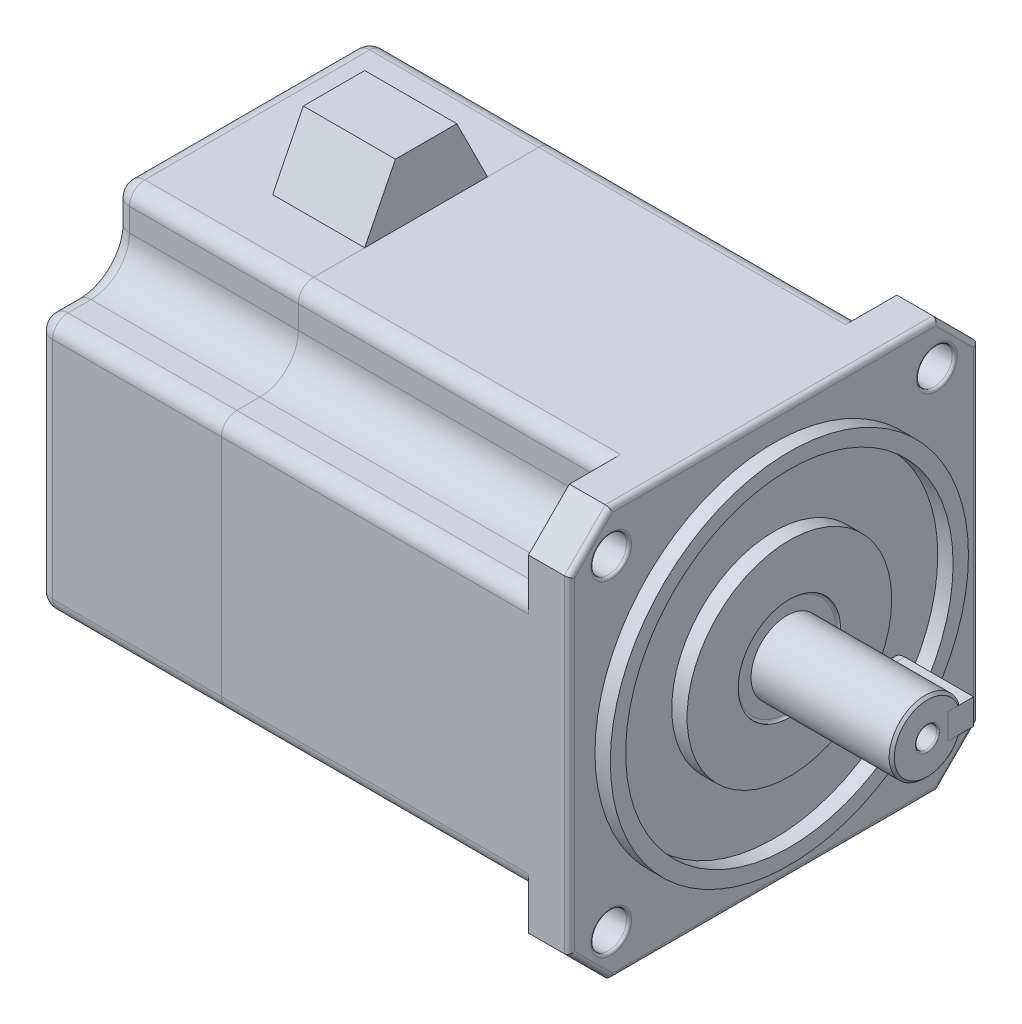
ISO-10303-21;
HEADER;
FILE_DESCRIPTION(('STEP AP214'),'2;1');
FILE_NAME('part.step','',(''),(''),'','','');
FILE_SCHEMA(('AUTOMOTIVE_DESIGN { 1 0 10303 214 1 1 1 1 }'));
ENDSEC;
DATA;
#1=APPLICATION_CONTEXT('core data for automotive mechanical design processes');
#2=APPLICATION_PROTOCOL_DEFINITION('international standard','automotive_design',2000,#1);
#3=PRODUCT_CONTEXT('',#1,'mechanical');
#4=PRODUCT('Part','Part','',(#3));
#5=PRODUCT_RELATED_PRODUCT_CATEGORY('part','',(#4));
#6=PRODUCT_DEFINITION_FORMATION('','',#4);
#7=PRODUCT_DEFINITION_CONTEXT('part definition',#1,'design');
#8=PRODUCT_DEFINITION('design','',#6,#7);
#9=PRODUCT_DEFINITION_SHAPE('','',#8);
#10=(LENGTH_UNIT() NAMED_UNIT(*) SI_UNIT(.MILLI.,.METRE.));
#11=(NAMED_UNIT(*) PLANE_ANGLE_UNIT() SI_UNIT($,.RADIAN.));
#12=(NAMED_UNIT(*) SI_UNIT($,.STERADIAN.) SOLID_ANGLE_UNIT());
#13=UNCERTAINTY_MEASURE_WITH_UNIT(LENGTH_MEASURE(1.E-05),#10,'distance_accuracy_value','');
#14=(GEOMETRIC_REPRESENTATION_CONTEXT(3) GLOBAL_UNCERTAINTY_ASSIGNED_CONTEXT((#13)) GLOBAL_UNIT_ASSIGNED_CONTEXT((#10,
#11,#12)) REPRESENTATION_CONTEXT('',''));
#15=CARTESIAN_POINT('',(0.,0.,0.));
#16=DIRECTION('',(0.,0.,1.));
#17=DIRECTION('',(1.,0.,0.));
#18=AXIS2_PLACEMENT_3D('',#15,#16,#17);
#19=CARTESIAN_POINT('',(-68.,52.,12.));
#20=DIRECTION('',(-1.,0.,0.));
#21=DIRECTION('',(0.,0.,1.));
#22=AXIS2_PLACEMENT_3D('',#19,#20,#21);
#23=PLANE('',#22);
#24=DIRECTION('',(0.,0.,-1.));
#25=VECTOR('',#24,1.);
#26=CARTESIAN_POINT('',(-68.,52.,12.));
#27=LINE('',#26,#25);
#28=CARTESIAN_POINT('',(-68.,52.,6.00000000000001));
#29=VERTEX_POINT('',#28);
#30=CARTESIAN_POINT('',(-68.,52.,-5.99999999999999));
#31=VERTEX_POINT('',#30);
#32=EDGE_CURVE('E58',#29,#31,#27,.T.);
#33=ORIENTED_EDGE('',*,*,#32,.F.);
#34=DIRECTION('',(0.,0.894427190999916,-0.447213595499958));
#35=VECTOR('',#34,1.);
#36=CARTESIAN_POINT('',(-68.,52.,6.00000000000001));
#37=LINE('',#36,#35);
#38=CARTESIAN_POINT('',(-68.,40.,12.));
#39=VERTEX_POINT('',#38);
#40=EDGE_CURVE('E90',#39,#29,#37,.T.);
#41=ORIENTED_EDGE('',*,*,#40,.F.);
#42=DIRECTION('',(0.,0.,-1.));
#43=VECTOR('',#42,1.);
#44=CARTESIAN_POINT('',(-68.,40.,12.));
#45=LINE('',#44,#43);
#46=CARTESIAN_POINT('',(-68.,40.,-12.));
#47=VERTEX_POINT('',#46);
#48=EDGE_CURVE('E106',#39,#47,#45,.T.);
#49=ORIENTED_EDGE('',*,*,#48,.T.);
#50=DIRECTION('',(0.,-0.894427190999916,-0.447213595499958));
#51=VECTOR('',#50,1.);
#52=CARTESIAN_POINT('',(-68.,52.,-5.99999999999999));
#53=LINE('',#52,#51);
#54=EDGE_CURVE('E74',#31,#47,#53,.T.);
#55=ORIENTED_EDGE('',*,*,#54,.F.);
#56=EDGE_LOOP('',(#33,#41,#49,#55));
#57=FACE_BOUND('',#56,.T.);
#58=ADVANCED_FACE('F50',(#57),#23,.F.);
#59=CARTESIAN_POINT('',(-86.,52.,12.));
#60=DIRECTION('',(1.,0.,0.));
#61=DIRECTION('',(0.,0.,-1.));
#62=AXIS2_PLACEMENT_3D('',#59,#60,#61);
#63=PLANE('',#62);
#64=DIRECTION('',(0.,0.,1.));
#65=VECTOR('',#64,1.);
#66=CARTESIAN_POINT('',(-86.,40.,12.));
#67=LINE('',#66,#65);
#68=CARTESIAN_POINT('',(-86.,40.,-12.));
#69=VERTEX_POINT('',#68);
#70=CARTESIAN_POINT('',(-86.,40.,12.));
#71=VERTEX_POINT('',#70);
#72=EDGE_CURVE('E109',#69,#71,#67,.T.);
#73=ORIENTED_EDGE('',*,*,#72,.T.);
#74=DIRECTION('',(0.,0.894427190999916,-0.447213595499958));
#75=VECTOR('',#74,1.);
#76=CARTESIAN_POINT('',(-86.,52.,6.00000000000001));
#77=LINE('',#76,#75);
#78=CARTESIAN_POINT('',(-86.,52.,6.00000000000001));
#79=VERTEX_POINT('',#78);
#80=EDGE_CURVE('E66',#71,#79,#77,.T.);
#81=ORIENTED_EDGE('',*,*,#80,.T.);
#82=DIRECTION('',(0.,0.,1.));
#83=VECTOR('',#82,1.);
#84=CARTESIAN_POINT('',(-86.,52.,12.));
#85=LINE('',#84,#83);
#86=CARTESIAN_POINT('',(-86.,52.,-5.99999999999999));
#87=VERTEX_POINT('',#86);
#88=EDGE_CURVE('E12',#87,#79,#85,.T.);
#89=ORIENTED_EDGE('',*,*,#88,.F.);
#90=DIRECTION('',(0.,-0.894427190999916,-0.447213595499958));
#91=VECTOR('',#90,1.);
#92=CARTESIAN_POINT('',(-86.,52.,-5.99999999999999));
#93=LINE('',#92,#91);
#94=EDGE_CURVE('E119',#87,#69,#93,.T.);
#95=ORIENTED_EDGE('',*,*,#94,.T.);
#96=EDGE_LOOP('',(#73,#81,#89,#95));
#97=FACE_BOUND('',#96,.T.);
#98=ADVANCED_FACE('F118',(#97),#63,.F.);
#99=CARTESIAN_POINT('',(0.,52.,0.));
#100=DIRECTION('',(0.,-1.,0.));
#101=DIRECTION('',(0.,0.,-1.));
#102=AXIS2_PLACEMENT_3D('',#99,#100,#101);
#103=PLANE('',#102);
#104=ORIENTED_EDGE('',*,*,#88,.T.);
#105=DIRECTION('',(1.,0.,0.));
#106=VECTOR('',#105,1.);
#107=CARTESIAN_POINT('',(-86.,52.,6.00000000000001));
#108=LINE('',#107,#106);
#109=EDGE_CURVE('E93',#79,#29,#108,.T.);
#110=ORIENTED_EDGE('',*,*,#109,.T.);
#111=ORIENTED_EDGE('',*,*,#32,.T.);
#112=DIRECTION('',(1.,0.,0.));
#113=VECTOR('',#112,1.);
#114=CARTESIAN_POINT('',(-86.,52.,-5.99999999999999));
#115=LINE('',#114,#113);
#116=EDGE_CURVE('E99',#87,#31,#115,.T.);
#117=ORIENTED_EDGE('',*,*,#116,.F.);
#118=EDGE_LOOP('',(#104,#110,#111,#117));
#119=FACE_BOUND('',#118,.T.);
#120=ADVANCED_FACE('F103',(#119),#103,.F.);
#121=CARTESIAN_POINT('',(0.,40.,0.));
#122=DIRECTION('',(0.,-1.,0.));
#123=DIRECTION('',(0.,0.,-1.));
#124=AXIS2_PLACEMENT_3D('',#121,#122,#123);
#125=PLANE('',#124);
#126=ORIENTED_EDGE('',*,*,#48,.F.);
#127=DIRECTION('',(1.,0.,0.));
#128=VECTOR('',#127,1.);
#129=CARTESIAN_POINT('',(-86.,40.,12.));
#130=LINE('',#129,#128);
#131=EDGE_CURVE('E53',#71,#39,#130,.T.);
#132=ORIENTED_EDGE('',*,*,#131,.F.);
#133=ORIENTED_EDGE('',*,*,#72,.F.);
#134=DIRECTION('',(-1.,0.,0.));
#135=VECTOR('',#134,1.);
#136=CARTESIAN_POINT('',(-86.,40.,-12.));
#137=LINE('',#136,#135);
#138=EDGE_CURVE('E114',#47,#69,#137,.T.);
#139=ORIENTED_EDGE('',*,*,#138,.F.);
#140=EDGE_LOOP('',(#126,#132,#133,#139));
#141=FACE_BOUND('',#140,.T.);
#142=ADVANCED_FACE('F121',(#141),#125,.T.);
#143=CARTESIAN_POINT('',(-86.,52.,-5.99999999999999));
#144=DIRECTION('',(0.,-0.447213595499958,0.894427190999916));
#145=DIRECTION('',(0.,-0.894427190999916,-0.447213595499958));
#146=AXIS2_PLACEMENT_3D('',#143,#144,#145);
#147=PLANE('',#146);
#148=ORIENTED_EDGE('',*,*,#54,.T.);
#149=ORIENTED_EDGE('',*,*,#138,.T.);
#150=ORIENTED_EDGE('',*,*,#94,.F.);
#151=ORIENTED_EDGE('',*,*,#116,.T.);
#152=EDGE_LOOP('',(#148,#149,#150,#151));
#153=FACE_BOUND('',#152,.T.);
#154=ADVANCED_FACE('F122',(#153),#147,.F.);
#155=CARTESIAN_POINT('',(-86.,52.,6.00000000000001));
#156=DIRECTION('',(0.,-0.447213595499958,-0.894427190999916));
#157=DIRECTION('',(0.,0.894427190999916,-0.447213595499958));
#158=AXIS2_PLACEMENT_3D('',#155,#156,#157);
#159=PLANE('',#158);
#160=ORIENTED_EDGE('',*,*,#40,.T.);
#161=ORIENTED_EDGE('',*,*,#109,.F.);
#162=ORIENTED_EDGE('',*,*,#80,.F.);
#163=ORIENTED_EDGE('',*,*,#131,.T.);
#164=EDGE_LOOP('',(#160,#161,#162,#163));
#165=FACE_BOUND('',#164,.T.);
#166=ADVANCED_FACE('F92',(#165),#159,.F.);
#167=CLOSED_SHELL('',(#58,#98,#120,#142,#154,#166));
#168=MANIFOLD_SOLID_BREP('B2',#167);
#169=CARTESIAN_POINT('',(16.5,0.,-9.));
#170=DIRECTION('',(0.,0.,1.));
#171=DIRECTION('',(1.,0.,0.));
#172=AXIS2_PLACEMENT_3D('',#169,#170,#171);
#173=CYLINDRICAL_SURFACE('',#172,2.5);
#174=CARTESIAN_POINT('',(16.5,0.,-4.));
#175=DIRECTION('',(0.,0.,-1.));
#176=DIRECTION('',(-1.,0.,0.));
#177=AXIS2_PLACEMENT_3D('',#174,#175,#176);
#178=CIRCLE('',#177,2.5);
#179=CARTESIAN_POINT('',(16.5,-2.5,-4.));
#180=VERTEX_POINT('',#179);
#181=CARTESIAN_POINT('',(16.5,2.5,-4.));
#182=VERTEX_POINT('',#181);
#183=EDGE_CURVE('E247',#180,#182,#178,.T.);
#184=ORIENTED_EDGE('',*,*,#183,.T.);
#185=DIRECTION('',(0.,0.,1.));
#186=VECTOR('',#185,1.);
#187=CARTESIAN_POINT('',(16.5,2.5,-9.));
#188=LINE('',#187,#186);
#189=CARTESIAN_POINT('',(16.5,2.5,-9.));
#190=VERTEX_POINT('',#189);
#191=EDGE_CURVE('E48',#190,#182,#188,.T.);
#192=ORIENTED_EDGE('',*,*,#191,.F.);
#193=CARTESIAN_POINT('',(16.5,0.,-9.));
#194=DIRECTION('',(0.,0.,-1.));
#195=DIRECTION('',(-1.,0.,0.));
#196=AXIS2_PLACEMENT_3D('',#193,#194,#195);
#197=CIRCLE('',#196,2.5);
#198=CARTESIAN_POINT('',(16.5,-2.5,-9.));
#199=VERTEX_POINT('',#198);
#200=EDGE_CURVE('E235',#199,#190,#197,.T.);
#201=ORIENTED_EDGE('',*,*,#200,.F.);
#202=DIRECTION('',(0.,0.,1.));
#203=VECTOR('',#202,1.);
#204=CARTESIAN_POINT('',(16.5,-2.5,-9.));
#205=LINE('',#204,#203);
#206=EDGE_CURVE('E243',#199,#180,#205,.T.);
#207=ORIENTED_EDGE('',*,*,#206,.T.);
#208=EDGE_LOOP('',(#184,#192,#201,#207));
#209=FACE_BOUND('',#208,.T.);
#210=ADVANCED_FACE('F184',(#209),#173,.T.);
#211=CARTESIAN_POINT('',(16.5,2.5,-9.));
#212=DIRECTION('',(0.,-1.,0.));
#213=DIRECTION('',(1.,0.,0.));
#214=AXIS2_PLACEMENT_3D('',#211,#212,#213);
#215=PLANE('',#214);
#216=DIRECTION('',(1.,0.,0.));
#217=VECTOR('',#216,1.);
#218=CARTESIAN_POINT('',(16.5,2.5,-4.));
#219=LINE('',#218,#217);
#220=CARTESIAN_POINT('',(30.,2.5,-4.));
#221=VERTEX_POINT('',#220);
#222=EDGE_CURVE('E239',#182,#221,#219,.T.);
#223=ORIENTED_EDGE('',*,*,#222,.T.);
#224=DIRECTION('',(0.,0.,1.));
#225=VECTOR('',#224,1.);
#226=CARTESIAN_POINT('',(30.,2.5,-9.));
#227=LINE('',#226,#225);
#228=CARTESIAN_POINT('',(30.,2.5,-9.));
#229=VERTEX_POINT('',#228);
#230=EDGE_CURVE('E192',#229,#221,#227,.T.);
#231=ORIENTED_EDGE('',*,*,#230,.F.);
#232=DIRECTION('',(1.,0.,0.));
#233=VECTOR('',#232,1.);
#234=CARTESIAN_POINT('',(16.5,2.5,-9.));
#235=LINE('',#234,#233);
#236=EDGE_CURVE('E230',#190,#229,#235,.T.);
#237=ORIENTED_EDGE('',*,*,#236,.F.);
#238=ORIENTED_EDGE('',*,*,#191,.T.);
#239=EDGE_LOOP('',(#223,#231,#237,#238));
#240=FACE_BOUND('',#239,.T.);
#241=ADVANCED_FACE('F238',(#240),#215,.F.);
#242=CARTESIAN_POINT('',(30.,2.5,-9.));
#243=DIRECTION('',(-1.,0.,0.));
#244=DIRECTION('',(0.,0.,1.));
#245=AXIS2_PLACEMENT_3D('',#242,#243,#244);
#246=PLANE('',#245);
#247=DIRECTION('',(0.,-1.,0.));
#248=VECTOR('',#247,1.);
#249=CARTESIAN_POINT('',(30.,2.5,-4.));
#250=LINE('',#249,#248);
#251=CARTESIAN_POINT('',(30.,-2.5,-4.));
#252=VERTEX_POINT('',#251);
#253=EDGE_CURVE('E217',#221,#252,#250,.T.);
#254=ORIENTED_EDGE('',*,*,#253,.T.);
#255=DIRECTION('',(0.,0.,1.));
#256=VECTOR('',#255,1.);
#257=CARTESIAN_POINT('',(30.,-2.5,-9.));
#258=LINE('',#257,#256);
#259=CARTESIAN_POINT('',(30.,-2.5,-9.));
#260=VERTEX_POINT('',#259);
#261=EDGE_CURVE('E240',#260,#252,#258,.T.);
#262=ORIENTED_EDGE('',*,*,#261,.F.);
#263=DIRECTION('',(0.,-1.,0.));
#264=VECTOR('',#263,1.);
#265=CARTESIAN_POINT('',(30.,2.5,-9.));
#266=LINE('',#265,#264);
#267=EDGE_CURVE('E233',#229,#260,#266,.T.);
#268=ORIENTED_EDGE('',*,*,#267,.F.);
#269=ORIENTED_EDGE('',*,*,#230,.T.);
#270=EDGE_LOOP('',(#254,#262,#268,#269));
#271=FACE_BOUND('',#270,.T.);
#272=ADVANCED_FACE('F241',(#271),#246,.F.);
#273=CARTESIAN_POINT('',(30.,-2.5,-9.));
#274=DIRECTION('',(0.,1.,0.));
#275=DIRECTION('',(0.,0.,1.));
#276=AXIS2_PLACEMENT_3D('',#273,#274,#275);
#277=PLANE('',#276);
#278=DIRECTION('',(-1.,0.,0.));
#279=VECTOR('',#278,1.);
#280=CARTESIAN_POINT('',(30.,-2.5,-4.));
#281=LINE('',#280,#279);
#282=EDGE_CURVE('E223',#252,#180,#281,.T.);
#283=ORIENTED_EDGE('',*,*,#282,.T.);
#284=ORIENTED_EDGE('',*,*,#206,.F.);
#285=DIRECTION('',(-1.,0.,0.));
#286=VECTOR('',#285,1.);
#287=CARTESIAN_POINT('',(30.,-2.5,-9.));
#288=LINE('',#287,#286);
#289=EDGE_CURVE('E200',#260,#199,#288,.T.);
#290=ORIENTED_EDGE('',*,*,#289,.F.);
#291=ORIENTED_EDGE('',*,*,#261,.T.);
#292=EDGE_LOOP('',(#283,#284,#290,#291));
#293=FACE_BOUND('',#292,.T.);
#294=ADVANCED_FACE('F254',(#293),#277,.F.);
#295=CARTESIAN_POINT('',(16.5,0.,-9.));
#296=DIRECTION('',(0.,0.,-1.));
#297=DIRECTION('',(-1.,0.,0.));
#298=AXIS2_PLACEMENT_3D('',#295,#296,#297);
#299=PLANE('',#298);
#300=ORIENTED_EDGE('',*,*,#200,.T.);
#301=ORIENTED_EDGE('',*,*,#236,.T.);
#302=ORIENTED_EDGE('',*,*,#267,.T.);
#303=ORIENTED_EDGE('',*,*,#289,.T.);
#304=EDGE_LOOP('',(#300,#301,#302,#303));
#305=FACE_BOUND('',#304,.T.);
#306=ADVANCED_FACE('F231',(#305),#299,.T.);
#307=CARTESIAN_POINT('',(16.5,0.,-4.));
#308=DIRECTION('',(0.,0.,-1.));
#309=DIRECTION('',(-1.,0.,0.));
#310=AXIS2_PLACEMENT_3D('',#307,#308,#309);
#311=PLANE('',#310);
#312=ORIENTED_EDGE('',*,*,#183,.F.);
#313=ORIENTED_EDGE('',*,*,#282,.F.);
#314=ORIENTED_EDGE('',*,*,#253,.F.);
#315=ORIENTED_EDGE('',*,*,#222,.F.);
#316=EDGE_LOOP('',(#312,#313,#314,#315));
#317=FACE_BOUND('',#316,.T.);
#318=ADVANCED_FACE('F257',(#317),#311,.F.);
#319=CLOSED_SHELL('',(#210,#241,#272,#294,#306,#318));
#320=MANIFOLD_SOLID_BREP('B6',#319);
#321=CARTESIAN_POINT('',(-104.,-32.,-40.));
#322=DIRECTION('',(0.,0.,1.));
#323=DIRECTION('',(1.,0.,0.));
#324=AXIS2_PLACEMENT_3D('',#321,#322,#323);
#325=PLANE('',#324);
#326=DIRECTION('',(-1.,0.,0.));
#327=VECTOR('',#326,1.);
#328=CARTESIAN_POINT('',(-8.00000000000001,-21.9833518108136,-40.));
#329=LINE('',#328,#327);
#330=CARTESIAN_POINT('',(-68.,-21.9833518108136,-40.));
#331=VERTEX_POINT('',#330);
#332=CARTESIAN_POINT('',(-101.,-21.9833518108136,-40.));
#333=VERTEX_POINT('',#332);
#334=EDGE_CURVE('E795',#331,#333,#329,.T.);
#335=ORIENTED_EDGE('',*,*,#334,.T.);
#336=DIRECTION('',(0.,-1.,0.));
#337=VECTOR('',#336,1.);
#338=CARTESIAN_POINT('',(-101.,21.983351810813,-40.));
#339=LINE('',#338,#337);
#340=CARTESIAN_POINT('',(-101.,21.983351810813,-40.));
#341=VERTEX_POINT('',#340);
#342=EDGE_CURVE('E326',#333,#341,#339,.F.);
#343=ORIENTED_EDGE('',*,*,#342,.T.);
#344=DIRECTION('',(-1.,0.,0.));
#345=VECTOR('',#344,1.);
#346=CARTESIAN_POINT('',(-8.00000000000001,21.983351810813,-40.));
#347=LINE('',#346,#345);
#348=CARTESIAN_POINT('',(-68.,21.983351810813,-40.));
#349=VERTEX_POINT('',#348);
#350=EDGE_CURVE('E839',#349,#341,#347,.T.);
#351=ORIENTED_EDGE('',*,*,#350,.F.);
#352=DIRECTION('',(0.,-1.,0.));
#353=VECTOR('',#352,1.);
#354=CARTESIAN_POINT('',(-68.,-32.,-40.));
#355=LINE('',#354,#353);
#356=EDGE_CURVE('E835',#349,#331,#355,.T.);
#357=ORIENTED_EDGE('',*,*,#356,.T.);
#358=EDGE_LOOP('',(#335,#343,#351,#357));
#359=FACE_BOUND('',#358,.T.);
#360=ADVANCED_FACE('F317',(#359),#325,.F.);
#361=CARTESIAN_POINT('',(-104.,-40.,-32.));
#362=DIRECTION('',(0.,1.,0.));
#363=DIRECTION('',(0.,0.,1.));
#364=AXIS2_PLACEMENT_3D('',#361,#362,#363);
#365=PLANE('',#364);
#366=DIRECTION('',(-1.,0.,0.));
#367=VECTOR('',#366,1.);
#368=CARTESIAN_POINT('',(-8.00000000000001,-40.,21.983351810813));
#369=LINE('',#368,#367);
#370=CARTESIAN_POINT('',(-68.,-40.,21.983351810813));
#371=VERTEX_POINT('',#370);
#372=CARTESIAN_POINT('',(-101.,-40.,21.983351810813));
#373=VERTEX_POINT('',#372);
#374=EDGE_CURVE('E789',#371,#373,#369,.T.);
#375=ORIENTED_EDGE('',*,*,#374,.T.);
#376=DIRECTION('',(0.,0.,1.));
#377=VECTOR('',#376,1.);
#378=CARTESIAN_POINT('',(-101.,-40.,-21.9833518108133));
#379=LINE('',#378,#377);
#380=CARTESIAN_POINT('',(-101.,-40.,-21.9833518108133));
#381=VERTEX_POINT('',#380);
#382=EDGE_CURVE('E671',#373,#381,#379,.F.);
#383=ORIENTED_EDGE('',*,*,#382,.T.);
#384=DIRECTION('',(-1.,0.,0.));
#385=VECTOR('',#384,1.);
#386=CARTESIAN_POINT('',(-8.00000000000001,-40.,-21.9833518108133));
#387=LINE('',#386,#385);
#388=CARTESIAN_POINT('',(-68.,-40.,-21.9833518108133));
#389=VERTEX_POINT('',#388);
#390=EDGE_CURVE('E787',#389,#381,#387,.T.);
#391=ORIENTED_EDGE('',*,*,#390,.F.);
#392=DIRECTION('',(0.,0.,1.));
#393=VECTOR('',#392,1.);
#394=CARTESIAN_POINT('',(-68.,-40.,-32.));
#395=LINE('',#394,#393);
#396=EDGE_CURVE('E838',#389,#371,#395,.T.);
#397=ORIENTED_EDGE('',*,*,#396,.T.);
#398=EDGE_LOOP('',(#375,#383,#391,#397));
#399=FACE_BOUND('',#398,.T.);
#400=ADVANCED_FACE('F785',(#399),#365,.F.);
#401=CARTESIAN_POINT('',(-104.,-32.,40.));
#402=DIRECTION('',(0.,0.,-1.));
#403=DIRECTION('',(-1.,0.,0.));
#404=AXIS2_PLACEMENT_3D('',#401,#402,#403);
#405=PLANE('',#404);
#406=DIRECTION('',(-1.,0.,0.));
#407=VECTOR('',#406,1.);
#408=CARTESIAN_POINT('',(-8.00000000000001,21.9833518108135,40.));
#409=LINE('',#408,#407);
#410=CARTESIAN_POINT('',(-68.,21.9833518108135,40.));
#411=VERTEX_POINT('',#410);
#412=CARTESIAN_POINT('',(-101.,21.9833518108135,40.));
#413=VERTEX_POINT('',#412);
#414=EDGE_CURVE('E831',#411,#413,#409,.T.);
#415=ORIENTED_EDGE('',*,*,#414,.T.);
#416=DIRECTION('',(0.,1.,0.));
#417=VECTOR('',#416,1.);
#418=CARTESIAN_POINT('',(-101.,-21.9833518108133,40.));
#419=LINE('',#418,#417);
#420=CARTESIAN_POINT('',(-101.,-21.9833518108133,40.));
#421=VERTEX_POINT('',#420);
#422=EDGE_CURVE('E659',#413,#421,#419,.F.);
#423=ORIENTED_EDGE('',*,*,#422,.T.);
#424=DIRECTION('',(-1.,0.,0.));
#425=VECTOR('',#424,1.);
#426=CARTESIAN_POINT('',(-8.00000000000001,-21.9833518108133,40.));
#427=LINE('',#426,#425);
#428=CARTESIAN_POINT('',(-68.,-21.9833518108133,40.));
#429=VERTEX_POINT('',#428);
#430=EDGE_CURVE('E813',#429,#421,#427,.T.);
#431=ORIENTED_EDGE('',*,*,#430,.F.);
#432=DIRECTION('',(0.,1.,0.));
#433=VECTOR('',#432,1.);
#434=CARTESIAN_POINT('',(-68.,-32.,40.));
#435=LINE('',#434,#433);
#436=EDGE_CURVE('E841',#429,#411,#435,.T.);
#437=ORIENTED_EDGE('',*,*,#436,.T.);
#438=EDGE_LOOP('',(#415,#423,#431,#437));
#439=FACE_BOUND('',#438,.T.);
#440=ADVANCED_FACE('F923',(#439),#405,.F.);
#441=CARTESIAN_POINT('',(-104.,40.,-32.));
#442=DIRECTION('',(0.,-1.,0.));
#443=DIRECTION('',(0.,0.,-1.));
#444=AXIS2_PLACEMENT_3D('',#441,#442,#443);
#445=PLANE('',#444);
#446=DIRECTION('',(0.,0.,-1.));
#447=VECTOR('',#446,1.);
#448=CARTESIAN_POINT('',(-68.,40.,-32.));
#449=LINE('',#448,#447);
#450=CARTESIAN_POINT('',(-68.,40.,21.9833518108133));
#451=VERTEX_POINT('',#450);
#452=CARTESIAN_POINT('',(-68.,40.,-21.9833518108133));
#453=VERTEX_POINT('',#452);
#454=EDGE_CURVE('E540',#451,#453,#449,.T.);
#455=ORIENTED_EDGE('',*,*,#454,.T.);
#456=DIRECTION('',(-1.,0.,0.));
#457=VECTOR('',#456,1.);
#458=CARTESIAN_POINT('',(-8.00000000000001,40.,-21.9833518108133));
#459=LINE('',#458,#457);
#460=CARTESIAN_POINT('',(-101.,40.,-21.9833518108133));
#461=VERTEX_POINT('',#460);
#462=EDGE_CURVE('E850',#453,#461,#459,.T.);
#463=ORIENTED_EDGE('',*,*,#462,.T.);
#464=DIRECTION('',(0.,0.,-1.));
#465=VECTOR('',#464,1.);
#466=CARTESIAN_POINT('',(-101.,40.,21.9833518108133));
#467=LINE('',#466,#465);
#468=CARTESIAN_POINT('',(-101.,40.,21.9833518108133));
#469=VERTEX_POINT('',#468);
#470=EDGE_CURVE('E648',#461,#469,#467,.F.);
#471=ORIENTED_EDGE('',*,*,#470,.T.);
#472=DIRECTION('',(-1.,0.,0.));
#473=VECTOR('',#472,1.);
#474=CARTESIAN_POINT('',(-8.00000000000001,40.,21.9833518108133));
#475=LINE('',#474,#473);
#476=EDGE_CURVE('E828',#451,#469,#475,.T.);
#477=ORIENTED_EDGE('',*,*,#476,.F.);
#478=EDGE_LOOP('',(#455,#463,#471,#477));
#479=FACE_BOUND('',#478,.T.);
#480=ADVANCED_FACE('F849',(#479),#445,.F.);
#481=CARTESIAN_POINT('',(-104.,0.,0.));
#482=DIRECTION('',(-1.,0.,0.));
#483=DIRECTION('',(0.,0.,1.));
#484=AXIS2_PLACEMENT_3D('',#481,#482,#483);
#485=PLANE('',#484);
#486=CARTESIAN_POINT('',(-104.,32.5,-32.4999999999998));
#487=DIRECTION('',(-1.,0.,0.));
#488=DIRECTION('',(0.,0.,1.));
#489=AXIS2_PLACEMENT_3D('',#486,#487,#488);
#490=CIRCLE('',#489,10.5166481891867);
#491=CARTESIAN_POINT('',(-104.,32.5,-21.9833518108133));
#492=VERTEX_POINT('',#491);
#493=CARTESIAN_POINT('',(-104.,21.9833518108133,-32.4999999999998));
#494=VERTEX_POINT('',#493);
#495=EDGE_CURVE('E637',#492,#494,#490,.F.);
#496=ORIENTED_EDGE('',*,*,#495,.T.);
#497=DIRECTION('',(0.,0.,1.));
#498=VECTOR('',#497,1.);
#499=CARTESIAN_POINT('',(-104.,21.9833518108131,-37.));
#500=LINE('',#499,#498);
#501=CARTESIAN_POINT('',(-104.,21.983351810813,-37.));
#502=VERTEX_POINT('',#501);
#503=EDGE_CURVE('E639',#494,#502,#500,.F.);
#504=ORIENTED_EDGE('',*,*,#503,.T.);
#505=DIRECTION('',(0.,-1.,0.));
#506=VECTOR('',#505,1.);
#507=CARTESIAN_POINT('',(-104.,-21.9833518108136,-37.));
#508=LINE('',#507,#506);
#509=CARTESIAN_POINT('',(-104.,-21.9833518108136,-37.));
#510=VERTEX_POINT('',#509);
#511=EDGE_CURVE('E609',#502,#510,#508,.T.);
#512=ORIENTED_EDGE('',*,*,#511,.T.);
#513=DIRECTION('',(0.,0.,-1.));
#514=VECTOR('',#513,1.);
#515=CARTESIAN_POINT('',(-104.,-21.9833518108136,-32.4999999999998));
#516=LINE('',#515,#514);
#517=CARTESIAN_POINT('',(-104.,-21.9833518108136,-32.4999999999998));
#518=VERTEX_POINT('',#517);
#519=EDGE_CURVE('E611',#510,#518,#516,.F.);
#520=ORIENTED_EDGE('',*,*,#519,.T.);
#521=CARTESIAN_POINT('',(-104.,-32.5,-32.4999999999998));
#522=DIRECTION('',(-1.,0.,0.));
#523=DIRECTION('',(0.,0.,1.));
#524=AXIS2_PLACEMENT_3D('',#521,#522,#523);
#525=CIRCLE('',#524,10.5166481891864);
#526=CARTESIAN_POINT('',(-104.,-32.5,-21.9833518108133));
#527=VERTEX_POINT('',#526);
#528=EDGE_CURVE('E613',#518,#527,#525,.F.);
#529=ORIENTED_EDGE('',*,*,#528,.T.);
#530=DIRECTION('',(0.,1.,0.));
#531=VECTOR('',#530,1.);
#532=CARTESIAN_POINT('',(-104.,-37.,-21.9833518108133));
#533=LINE('',#532,#531);
#534=CARTESIAN_POINT('',(-104.,-37.,-21.9833518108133));
#535=VERTEX_POINT('',#534);
#536=EDGE_CURVE('E615',#527,#535,#533,.F.);
#537=ORIENTED_EDGE('',*,*,#536,.T.);
#538=DIRECTION('',(0.,0.,1.));
#539=VECTOR('',#538,1.);
#540=CARTESIAN_POINT('',(-104.,-37.,21.983351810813));
#541=LINE('',#540,#539);
#542=CARTESIAN_POINT('',(-104.,-37.,21.983351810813));
#543=VERTEX_POINT('',#542);
#544=EDGE_CURVE('E617',#535,#543,#541,.T.);
#545=ORIENTED_EDGE('',*,*,#544,.T.);
#546=DIRECTION('',(0.,-1.,0.));
#547=VECTOR('',#546,1.);
#548=CARTESIAN_POINT('',(-104.,-32.5,21.983351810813));
#549=LINE('',#548,#547);
#550=CARTESIAN_POINT('',(-104.,-32.5,21.983351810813));
#551=VERTEX_POINT('',#550);
#552=EDGE_CURVE('E619',#543,#551,#549,.F.);
#553=ORIENTED_EDGE('',*,*,#552,.T.);
#554=CARTESIAN_POINT('',(-104.,-32.5,32.4999999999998));
#555=DIRECTION('',(-1.,0.,0.));
#556=DIRECTION('',(0.,0.,1.));
#557=AXIS2_PLACEMENT_3D('',#554,#555,#556);
#558=CIRCLE('',#557,10.5166481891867);
#559=CARTESIAN_POINT('',(-104.,-21.9833518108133,32.4999999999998));
#560=VERTEX_POINT('',#559);
#561=EDGE_CURVE('E621',#551,#560,#558,.F.);
#562=ORIENTED_EDGE('',*,*,#561,.T.);
#563=DIRECTION('',(0.,0.,-1.));
#564=VECTOR('',#563,1.);
#565=CARTESIAN_POINT('',(-104.,-21.9833518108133,37.));
#566=LINE('',#565,#564);
#567=CARTESIAN_POINT('',(-104.,-21.9833518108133,37.));
#568=VERTEX_POINT('',#567);
#569=EDGE_CURVE('E623',#560,#568,#566,.F.);
#570=ORIENTED_EDGE('',*,*,#569,.T.);
#571=DIRECTION('',(0.,1.,0.));
#572=VECTOR('',#571,1.);
#573=CARTESIAN_POINT('',(-104.,21.9833518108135,37.));
#574=LINE('',#573,#572);
#575=CARTESIAN_POINT('',(-104.,21.9833518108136,37.));
#576=VERTEX_POINT('',#575);
#577=EDGE_CURVE('E625',#568,#576,#574,.T.);
#578=ORIENTED_EDGE('',*,*,#577,.T.);
#579=DIRECTION('',(0.,0.,1.));
#580=VECTOR('',#579,1.);
#581=CARTESIAN_POINT('',(-104.,21.9833518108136,32.4999999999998));
#582=LINE('',#581,#580);
#583=CARTESIAN_POINT('',(-104.,21.9833518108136,32.4999999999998));
#584=VERTEX_POINT('',#583);
#585=EDGE_CURVE('E627',#576,#584,#582,.F.);
#586=ORIENTED_EDGE('',*,*,#585,.T.);
#587=CARTESIAN_POINT('',(-104.,32.5,32.4999999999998));
#588=DIRECTION('',(-1.,0.,0.));
#589=DIRECTION('',(0.,0.,1.));
#590=AXIS2_PLACEMENT_3D('',#587,#588,#589);
#591=CIRCLE('',#590,10.5166481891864);
#592=CARTESIAN_POINT('',(-104.,32.5,21.9833518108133));
#593=VERTEX_POINT('',#592);
#594=EDGE_CURVE('E629',#584,#593,#591,.F.);
#595=ORIENTED_EDGE('',*,*,#594,.T.);
#596=DIRECTION('',(0.,-1.,0.));
#597=VECTOR('',#596,1.);
#598=CARTESIAN_POINT('',(-104.,37.,21.9833518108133));
#599=LINE('',#598,#597);
#600=CARTESIAN_POINT('',(-104.,37.,21.9833518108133));
#601=VERTEX_POINT('',#600);
#602=EDGE_CURVE('E631',#593,#601,#599,.F.);
#603=ORIENTED_EDGE('',*,*,#602,.T.);
#604=DIRECTION('',(0.,0.,-1.));
#605=VECTOR('',#604,1.);
#606=CARTESIAN_POINT('',(-104.,37.,-21.9833518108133));
#607=LINE('',#606,#605);
#608=CARTESIAN_POINT('',(-104.,37.,-21.9833518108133));
#609=VERTEX_POINT('',#608);
#610=EDGE_CURVE('E633',#601,#609,#607,.T.);
#611=ORIENTED_EDGE('',*,*,#610,.T.);
#612=DIRECTION('',(0.,1.,0.));
#613=VECTOR('',#612,1.);
#614=CARTESIAN_POINT('',(-104.,32.5,-21.9833518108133));
#615=LINE('',#614,#613);
#616=EDGE_CURVE('E635',#609,#492,#615,.F.);
#617=ORIENTED_EDGE('',*,*,#616,.T.);
#618=EDGE_LOOP('',(#496,#504,#512,#520,#529,#537,#545,#553,#562,#570,#578,#586,#595,#603,#611,#617));
#619=FACE_BOUND('',#618,.T.);
#620=ADVANCED_FACE('F763',(#619),#485,.T.);
#621=CARTESIAN_POINT('',(-68.,0.,0.));
#622=DIRECTION('',(-1.,0.,0.));
#623=DIRECTION('',(0.,0.,1.));
#624=AXIS2_PLACEMENT_3D('',#621,#622,#623);
#625=PLANE('',#624);
#626=ORIENTED_EDGE('',*,*,#356,.F.);
#627=CARTESIAN_POINT('',(-68.,21.9833518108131,-37.));
#628=DIRECTION('',(-1.,0.,0.));
#629=DIRECTION('',(0.,0.,1.));
#630=AXIS2_PLACEMENT_3D('',#627,#628,#629);
#631=CIRCLE('',#630,3.);
#632=CARTESIAN_POINT('',(-68.,24.9833518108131,-37.));
#633=VERTEX_POINT('',#632);
#634=EDGE_CURVE('E603',#349,#633,#631,.F.);
#635=ORIENTED_EDGE('',*,*,#634,.T.);
#636=DIRECTION('',(0.,0.,1.));
#637=VECTOR('',#636,1.);
#638=CARTESIAN_POINT('',(-68.,24.9833518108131,0.));
#639=LINE('',#638,#637);
#640=CARTESIAN_POINT('',(-68.,24.9833518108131,-32.4999999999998));
#641=VERTEX_POINT('',#640);
#642=EDGE_CURVE('E591',#633,#641,#639,.T.);
#643=ORIENTED_EDGE('',*,*,#642,.T.);
#644=CARTESIAN_POINT('',(-68.,32.5,-32.4999999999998));
#645=DIRECTION('',(-1.,0.,0.));
#646=DIRECTION('',(0.,0.,1.));
#647=AXIS2_PLACEMENT_3D('',#644,#645,#646);
#648=CIRCLE('',#647,7.51664818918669);
#649=CARTESIAN_POINT('',(-68.,32.5,-24.9833518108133));
#650=VERTEX_POINT('',#649);
#651=EDGE_CURVE('E594',#641,#650,#648,.T.);
#652=ORIENTED_EDGE('',*,*,#651,.T.);
#653=DIRECTION('',(0.,1.,0.));
#654=VECTOR('',#653,1.);
#655=CARTESIAN_POINT('',(-68.,0.,-24.9833518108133));
#656=LINE('',#655,#654);
#657=CARTESIAN_POINT('',(-68.,37.,-24.9833518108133));
#658=VERTEX_POINT('',#657);
#659=EDGE_CURVE('E597',#650,#658,#656,.T.);
#660=ORIENTED_EDGE('',*,*,#659,.T.);
#661=CARTESIAN_POINT('',(-68.,37.,-21.9833518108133));
#662=DIRECTION('',(-1.,0.,0.));
#663=DIRECTION('',(0.,0.,1.));
#664=AXIS2_PLACEMENT_3D('',#661,#662,#663);
#665=CIRCLE('',#664,3.);
#666=EDGE_CURVE('E600',#658,#453,#665,.F.);
#667=ORIENTED_EDGE('',*,*,#666,.T.);
#668=ORIENTED_EDGE('',*,*,#454,.F.);
#669=CARTESIAN_POINT('',(-68.,37.,21.9833518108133));
#670=DIRECTION('',(-1.,0.,0.));
#671=DIRECTION('',(0.,0.,1.));
#672=AXIS2_PLACEMENT_3D('',#669,#670,#671);
#673=CIRCLE('',#672,3.);
#674=CARTESIAN_POINT('',(-68.,37.,24.9833518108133));
#675=VERTEX_POINT('',#674);
#676=EDGE_CURVE('E556',#451,#675,#673,.F.);
#677=ORIENTED_EDGE('',*,*,#676,.T.);
#678=DIRECTION('',(0.,-1.,0.));
#679=VECTOR('',#678,1.);
#680=CARTESIAN_POINT('',(-68.,0.,24.9833518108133));
#681=LINE('',#680,#679);
#682=CARTESIAN_POINT('',(-68.,32.5,24.9833518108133));
#683=VERTEX_POINT('',#682);
#684=EDGE_CURVE('E554',#675,#683,#681,.T.);
#685=ORIENTED_EDGE('',*,*,#684,.T.);
#686=CARTESIAN_POINT('',(-68.,32.5,32.4999999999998));
#687=DIRECTION('',(-1.,0.,0.));
#688=DIRECTION('',(0.,0.,1.));
#689=AXIS2_PLACEMENT_3D('',#686,#687,#688);
#690=CIRCLE('',#689,7.51664818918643);
#691=CARTESIAN_POINT('',(-68.,24.9833518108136,32.4999999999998));
#692=VERTEX_POINT('',#691);
#693=EDGE_CURVE('E545',#683,#692,#690,.T.);
#694=ORIENTED_EDGE('',*,*,#693,.T.);
#695=DIRECTION('',(0.,0.,1.));
#696=VECTOR('',#695,1.);
#697=CARTESIAN_POINT('',(-68.,24.9833518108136,0.));
#698=LINE('',#697,#696);
#699=CARTESIAN_POINT('',(-68.,24.9833518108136,37.));
#700=VERTEX_POINT('',#699);
#701=EDGE_CURVE('E528',#692,#700,#698,.T.);
#702=ORIENTED_EDGE('',*,*,#701,.T.);
#703=CARTESIAN_POINT('',(-68.,21.9833518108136,37.));
#704=DIRECTION('',(-1.,0.,0.));
#705=DIRECTION('',(0.,0.,1.));
#706=AXIS2_PLACEMENT_3D('',#703,#704,#705);
#707=CIRCLE('',#706,3.);
#708=EDGE_CURVE('E539',#700,#411,#707,.F.);
#709=ORIENTED_EDGE('',*,*,#708,.T.);
#710=ORIENTED_EDGE('',*,*,#436,.F.);
#711=CARTESIAN_POINT('',(-68.,-21.9833518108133,37.));
#712=DIRECTION('',(-1.,0.,0.));
#713=DIRECTION('',(0.,0.,1.));
#714=AXIS2_PLACEMENT_3D('',#711,#712,#713);
#715=CIRCLE('',#714,3.);
#716=CARTESIAN_POINT('',(-68.,-24.9833518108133,37.));
#717=VERTEX_POINT('',#716);
#718=EDGE_CURVE('E573',#429,#717,#715,.F.);
#719=ORIENTED_EDGE('',*,*,#718,.T.);
#720=DIRECTION('',(0.,0.,-1.));
#721=VECTOR('',#720,1.);
#722=CARTESIAN_POINT('',(-68.,-24.9833518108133,0.));
#723=LINE('',#722,#721);
#724=CARTESIAN_POINT('',(-68.,-24.9833518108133,32.4999999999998));
#725=VERTEX_POINT('',#724);
#726=EDGE_CURVE('E570',#717,#725,#723,.T.);
#727=ORIENTED_EDGE('',*,*,#726,.T.);
#728=CARTESIAN_POINT('',(-68.,-32.5,32.4999999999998));
#729=DIRECTION('',(-1.,0.,0.));
#730=DIRECTION('',(0.,0.,1.));
#731=AXIS2_PLACEMENT_3D('',#728,#729,#730);
#732=CIRCLE('',#731,7.51664818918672);
#733=CARTESIAN_POINT('',(-68.,-32.5,24.983351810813));
#734=VERTEX_POINT('',#733);
#735=EDGE_CURVE('E567',#725,#734,#732,.T.);
#736=ORIENTED_EDGE('',*,*,#735,.T.);
#737=DIRECTION('',(0.,-1.,0.));
#738=VECTOR('',#737,1.);
#739=CARTESIAN_POINT('',(-68.,0.,24.983351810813));
#740=LINE('',#739,#738);
#741=CARTESIAN_POINT('',(-68.,-37.,24.983351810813));
#742=VERTEX_POINT('',#741);
#743=EDGE_CURVE('E561',#734,#742,#740,.T.);
#744=ORIENTED_EDGE('',*,*,#743,.T.);
#745=CARTESIAN_POINT('',(-68.,-37.,21.983351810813));
#746=DIRECTION('',(-1.,0.,0.));
#747=DIRECTION('',(0.,0.,1.));
#748=AXIS2_PLACEMENT_3D('',#745,#746,#747);
#749=CIRCLE('',#748,3.);
#750=EDGE_CURVE('E564',#742,#371,#749,.F.);
#751=ORIENTED_EDGE('',*,*,#750,.T.);
#752=ORIENTED_EDGE('',*,*,#396,.F.);
#753=CARTESIAN_POINT('',(-68.,-37.,-21.9833518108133));
#754=DIRECTION('',(-1.,0.,0.));
#755=DIRECTION('',(0.,0.,1.));
#756=AXIS2_PLACEMENT_3D('',#753,#754,#755);
#757=CIRCLE('',#756,3.);
#758=CARTESIAN_POINT('',(-68.,-37.,-24.9833518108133));
#759=VERTEX_POINT('',#758);
#760=EDGE_CURVE('E588',#389,#759,#757,.F.);
#761=ORIENTED_EDGE('',*,*,#760,.T.);
#762=DIRECTION('',(0.,1.,0.));
#763=VECTOR('',#762,1.);
#764=CARTESIAN_POINT('',(-68.,0.,-24.9833518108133));
#765=LINE('',#764,#763);
#766=CARTESIAN_POINT('',(-68.,-32.5,-24.9833518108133));
#767=VERTEX_POINT('',#766);
#768=EDGE_CURVE('E585',#759,#767,#765,.T.);
#769=ORIENTED_EDGE('',*,*,#768,.T.);
#770=CARTESIAN_POINT('',(-68.,-32.5,-32.4999999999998));
#771=DIRECTION('',(-1.,0.,0.));
#772=DIRECTION('',(0.,0.,1.));
#773=AXIS2_PLACEMENT_3D('',#770,#771,#772);
#774=CIRCLE('',#773,7.51664818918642);
#775=CARTESIAN_POINT('',(-68.,-24.9833518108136,-32.4999999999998));
#776=VERTEX_POINT('',#775);
#777=EDGE_CURVE('E582',#767,#776,#774,.T.);
#778=ORIENTED_EDGE('',*,*,#777,.T.);
#779=DIRECTION('',(0.,0.,-1.));
#780=VECTOR('',#779,1.);
#781=CARTESIAN_POINT('',(-68.,-24.9833518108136,0.));
#782=LINE('',#781,#780);
#783=CARTESIAN_POINT('',(-68.,-24.9833518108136,-37.));
#784=VERTEX_POINT('',#783);
#785=EDGE_CURVE('E576',#776,#784,#782,.T.);
#786=ORIENTED_EDGE('',*,*,#785,.T.);
#787=CARTESIAN_POINT('',(-68.,-21.9833518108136,-37.));
#788=DIRECTION('',(-1.,0.,0.));
#789=DIRECTION('',(0.,0.,1.));
#790=AXIS2_PLACEMENT_3D('',#787,#788,#789);
#791=CIRCLE('',#790,3.);
#792=EDGE_CURVE('E579',#784,#331,#791,.F.);
#793=ORIENTED_EDGE('',*,*,#792,.T.);
#794=EDGE_LOOP('',(#626,#635,#643,#652,#660,#667,#668,#677,#685,#694,#702,#709,#710,#719,#727,
#736,#744,#751,#752,#761,#769,#778,#786,#793));
#795=FACE_BOUND('',#794,.T.);
#796=ADVANCED_FACE('F552',(#795),#625,.F.);
#797=CARTESIAN_POINT('',(-8.00000000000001,32.5,32.4999999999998));
#798=DIRECTION('',(-1.,0.,0.));
#799=DIRECTION('',(0.,0.,1.));
#800=AXIS2_PLACEMENT_3D('',#797,#798,#799);
#801=CYLINDRICAL_SURFACE('',#800,7.51664818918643);
#802=DIRECTION('',(-1.,0.,0.));
#803=VECTOR('',#802,1.);
#804=CARTESIAN_POINT('',(-8.00000000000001,32.5,24.9833518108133));
#805=LINE('',#804,#803);
#806=CARTESIAN_POINT('',(-101.,32.5,24.9833518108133));
#807=VERTEX_POINT('',#806);
#808=EDGE_CURVE('E823',#683,#807,#805,.T.);
#809=ORIENTED_EDGE('',*,*,#808,.T.);
#810=CARTESIAN_POINT('',(-101.,32.5,32.4999999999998));
#811=DIRECTION('',(-1.,0.,0.));
#812=DIRECTION('',(0.,0.,1.));
#813=AXIS2_PLACEMENT_3D('',#810,#811,#812);
#814=CIRCLE('',#813,7.51664818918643);
#815=CARTESIAN_POINT('',(-101.,24.9833518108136,32.4999999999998));
#816=VERTEX_POINT('',#815);
#817=EDGE_CURVE('E548',#807,#816,#814,.T.);
#818=ORIENTED_EDGE('',*,*,#817,.T.);
#819=DIRECTION('',(-1.,0.,0.));
#820=VECTOR('',#819,1.);
#821=CARTESIAN_POINT('',(-8.00000000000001,24.9833518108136,32.4999999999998));
#822=LINE('',#821,#820);
#823=EDGE_CURVE('E531',#692,#816,#822,.T.);
#824=ORIENTED_EDGE('',*,*,#823,.F.);
#825=ORIENTED_EDGE('',*,*,#693,.F.);
#826=EDGE_LOOP('',(#809,#818,#824,#825));
#827=FACE_BOUND('',#826,.T.);
#828=ADVANCED_FACE('F544',(#827),#801,.F.);
#829=CARTESIAN_POINT('',(-8.00000000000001,32.5,24.9833518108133));
#830=DIRECTION('',(0.,0.,-1.));
#831=DIRECTION('',(-1.,0.,0.));
#832=AXIS2_PLACEMENT_3D('',#829,#830,#831);
#833=PLANE('',#832);
#834=DIRECTION('',(-1.,0.,0.));
#835=VECTOR('',#834,1.);
#836=CARTESIAN_POINT('',(-8.00000000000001,37.,24.9833518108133));
#837=LINE('',#836,#835);
#838=CARTESIAN_POINT('',(-101.,37.,24.9833518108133));
#839=VERTEX_POINT('',#838);
#840=EDGE_CURVE('E825',#675,#839,#837,.T.);
#841=ORIENTED_EDGE('',*,*,#840,.T.);
#842=DIRECTION('',(0.,-1.,0.));
#843=VECTOR('',#842,1.);
#844=CARTESIAN_POINT('',(-101.,32.5,24.9833518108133));
#845=LINE('',#844,#843);
#846=EDGE_CURVE('E652',#839,#807,#845,.T.);
#847=ORIENTED_EDGE('',*,*,#846,.T.);
#848=ORIENTED_EDGE('',*,*,#808,.F.);
#849=ORIENTED_EDGE('',*,*,#684,.F.);
#850=EDGE_LOOP('',(#841,#847,#848,#849));
#851=FACE_BOUND('',#850,.T.);
#852=ADVANCED_FACE('F1266',(#851),#833,.F.);
#853=CARTESIAN_POINT('',(-8.00000000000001,37.,21.9833518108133));
#854=DIRECTION('',(-1.,0.,0.));
#855=DIRECTION('',(0.,0.,1.));
#856=AXIS2_PLACEMENT_3D('',#853,#854,#855);
#857=CYLINDRICAL_SURFACE('',#856,3.);
#858=ORIENTED_EDGE('',*,*,#476,.T.);
#859=CARTESIAN_POINT('',(-101.,37.,21.9833518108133));
#860=DIRECTION('',(-1.,0.,0.));
#861=DIRECTION('',(0.,0.,1.));
#862=AXIS2_PLACEMENT_3D('',#859,#860,#861);
#863=CIRCLE('',#862,3.);
#864=EDGE_CURVE('E650',#469,#839,#863,.F.);
#865=ORIENTED_EDGE('',*,*,#864,.T.);
#866=ORIENTED_EDGE('',*,*,#840,.F.);
#867=ORIENTED_EDGE('',*,*,#676,.F.);
#868=EDGE_LOOP('',(#858,#865,#866,#867));
#869=FACE_BOUND('',#868,.T.);
#870=ADVANCED_FACE('F1257',(#869),#857,.T.);
#871=CARTESIAN_POINT('',(-8.00000000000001,21.9833518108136,37.));
#872=DIRECTION('',(-1.,0.,0.));
#873=DIRECTION('',(0.,0.,1.));
#874=AXIS2_PLACEMENT_3D('',#871,#872,#873);
#875=CYLINDRICAL_SURFACE('',#874,3.);
#876=DIRECTION('',(-1.,0.,0.));
#877=VECTOR('',#876,1.);
#878=CARTESIAN_POINT('',(-8.00000000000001,24.9833518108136,37.));
#879=LINE('',#878,#877);
#880=CARTESIAN_POINT('',(-101.,24.9833518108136,37.));
#881=VERTEX_POINT('',#880);
#882=EDGE_CURVE('E534',#700,#881,#879,.T.);
#883=ORIENTED_EDGE('',*,*,#882,.T.);
#884=CARTESIAN_POINT('',(-101.,21.9833518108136,37.));
#885=DIRECTION('',(-1.,0.,0.));
#886=DIRECTION('',(0.,0.,1.));
#887=AXIS2_PLACEMENT_3D('',#884,#885,#886);
#888=CIRCLE('',#887,3.);
#889=EDGE_CURVE('E657',#881,#413,#888,.F.);
#890=ORIENTED_EDGE('',*,*,#889,.T.);
#891=ORIENTED_EDGE('',*,*,#414,.F.);
#892=ORIENTED_EDGE('',*,*,#708,.F.);
#893=EDGE_LOOP('',(#883,#890,#891,#892));
#894=FACE_BOUND('',#893,.T.);
#895=ADVANCED_FACE('F1249',(#894),#875,.T.);
#896=CARTESIAN_POINT('',(-8.00000000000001,24.9833518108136,37.));
#897=DIRECTION('',(0.,-1.,0.));
#898=DIRECTION('',(0.,0.,-1.));
#899=AXIS2_PLACEMENT_3D('',#896,#897,#898);
#900=PLANE('',#899);
#901=ORIENTED_EDGE('',*,*,#823,.T.);
#902=DIRECTION('',(0.,0.,1.));
#903=VECTOR('',#902,1.);
#904=CARTESIAN_POINT('',(-101.,24.9833518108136,37.));
#905=LINE('',#904,#903);
#906=EDGE_CURVE('E655',#816,#881,#905,.T.);
#907=ORIENTED_EDGE('',*,*,#906,.T.);
#908=ORIENTED_EDGE('',*,*,#882,.F.);
#909=ORIENTED_EDGE('',*,*,#701,.F.);
#910=EDGE_LOOP('',(#901,#907,#908,#909));
#911=FACE_BOUND('',#910,.T.);
#912=ADVANCED_FACE('F530',(#911),#900,.F.);
#913=CARTESIAN_POINT('',(-8.00000000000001,-32.5,32.4999999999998));
#914=DIRECTION('',(-1.,0.,0.));
#915=DIRECTION('',(0.,0.,1.));
#916=AXIS2_PLACEMENT_3D('',#913,#914,#915);
#917=CYLINDRICAL_SURFACE('',#916,7.51664818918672);
#918=DIRECTION('',(-1.,0.,0.));
#919=VECTOR('',#918,1.);
#920=CARTESIAN_POINT('',(-8.00000000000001,-24.9833518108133,32.4999999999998));
#921=LINE('',#920,#919);
#922=CARTESIAN_POINT('',(-101.,-24.9833518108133,32.4999999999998));
#923=VERTEX_POINT('',#922);
#924=EDGE_CURVE('E807',#725,#923,#921,.T.);
#925=ORIENTED_EDGE('',*,*,#924,.T.);
#926=CARTESIAN_POINT('',(-101.,-32.5,32.4999999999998));
#927=DIRECTION('',(-1.,0.,0.));
#928=DIRECTION('',(0.,0.,1.));
#929=AXIS2_PLACEMENT_3D('',#926,#927,#928);
#930=CIRCLE('',#929,7.51664818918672);
#931=CARTESIAN_POINT('',(-101.,-32.5,24.983351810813));
#932=VERTEX_POINT('',#931);
#933=EDGE_CURVE('E665',#923,#932,#930,.T.);
#934=ORIENTED_EDGE('',*,*,#933,.T.);
#935=DIRECTION('',(-1.,0.,0.));
#936=VECTOR('',#935,1.);
#937=CARTESIAN_POINT('',(-8.00000000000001,-32.5,24.983351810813));
#938=LINE('',#937,#936);
#939=EDGE_CURVE('E820',#734,#932,#938,.T.);
#940=ORIENTED_EDGE('',*,*,#939,.F.);
#941=ORIENTED_EDGE('',*,*,#735,.F.);
#942=EDGE_LOOP('',(#925,#934,#940,#941));
#943=FACE_BOUND('',#942,.T.);
#944=ADVANCED_FACE('F1232',(#943),#917,.F.);
#945=CARTESIAN_POINT('',(-8.00000000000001,-24.9833518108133,32.4999999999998));
#946=DIRECTION('',(0.,1.,0.));
#947=DIRECTION('',(0.,0.,1.));
#948=AXIS2_PLACEMENT_3D('',#945,#946,#947);
#949=PLANE('',#948);
#950=DIRECTION('',(-1.,0.,0.));
#951=VECTOR('',#950,1.);
#952=CARTESIAN_POINT('',(-8.00000000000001,-24.9833518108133,37.));
#953=LINE('',#952,#951);
#954=CARTESIAN_POINT('',(-101.,-24.9833518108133,37.));
#955=VERTEX_POINT('',#954);
#956=EDGE_CURVE('E810',#717,#955,#953,.T.);
#957=ORIENTED_EDGE('',*,*,#956,.T.);
#958=DIRECTION('',(0.,0.,-1.));
#959=VECTOR('',#958,1.);
#960=CARTESIAN_POINT('',(-101.,-24.9833518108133,32.4999999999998));
#961=LINE('',#960,#959);
#962=EDGE_CURVE('E663',#955,#923,#961,.T.);
#963=ORIENTED_EDGE('',*,*,#962,.T.);
#964=ORIENTED_EDGE('',*,*,#924,.F.);
#965=ORIENTED_EDGE('',*,*,#726,.F.);
#966=EDGE_LOOP('',(#957,#963,#964,#965));
#967=FACE_BOUND('',#966,.T.);
#968=ADVANCED_FACE('F1223',(#967),#949,.F.);
#969=CARTESIAN_POINT('',(-8.00000000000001,-21.9833518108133,37.));
#970=DIRECTION('',(-1.,0.,0.));
#971=DIRECTION('',(0.,0.,1.));
#972=AXIS2_PLACEMENT_3D('',#969,#970,#971);
#973=CYLINDRICAL_SURFACE('',#972,3.);
#974=ORIENTED_EDGE('',*,*,#430,.T.);
#975=CARTESIAN_POINT('',(-101.,-21.9833518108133,37.));
#976=DIRECTION('',(-1.,0.,0.));
#977=DIRECTION('',(0.,0.,1.));
#978=AXIS2_PLACEMENT_3D('',#975,#976,#977);
#979=CIRCLE('',#978,3.);
#980=EDGE_CURVE('E661',#421,#955,#979,.F.);
#981=ORIENTED_EDGE('',*,*,#980,.T.);
#982=ORIENTED_EDGE('',*,*,#956,.F.);
#983=ORIENTED_EDGE('',*,*,#718,.F.);
#984=EDGE_LOOP('',(#974,#981,#982,#983));
#985=FACE_BOUND('',#984,.T.);
#986=ADVANCED_FACE('F1214',(#985),#973,.T.);
#987=CARTESIAN_POINT('',(-8.00000000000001,-37.,21.983351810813));
#988=DIRECTION('',(-1.,0.,0.));
#989=DIRECTION('',(0.,0.,1.));
#990=AXIS2_PLACEMENT_3D('',#987,#988,#989);
#991=CYLINDRICAL_SURFACE('',#990,3.);
#992=DIRECTION('',(-1.,0.,0.));
#993=VECTOR('',#992,1.);
#994=CARTESIAN_POINT('',(-8.00000000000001,-37.,24.983351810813));
#995=LINE('',#994,#993);
#996=CARTESIAN_POINT('',(-101.,-37.,24.983351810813));
#997=VERTEX_POINT('',#996);
#998=EDGE_CURVE('E817',#742,#997,#995,.T.);
#999=ORIENTED_EDGE('',*,*,#998,.T.);
#1000=CARTESIAN_POINT('',(-101.,-37.,21.983351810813));
#1001=DIRECTION('',(-1.,0.,0.));
#1002=DIRECTION('',(0.,0.,1.));
#1003=AXIS2_PLACEMENT_3D('',#1000,#1001,#1002);
#1004=CIRCLE('',#1003,3.);
#1005=EDGE_CURVE('E669',#997,#373,#1004,.F.);
#1006=ORIENTED_EDGE('',*,*,#1005,.T.);
#1007=ORIENTED_EDGE('',*,*,#374,.F.);
#1008=ORIENTED_EDGE('',*,*,#750,.F.);
#1009=EDGE_LOOP('',(#999,#1006,#1007,#1008));
#1010=FACE_BOUND('',#1009,.T.);
#1011=ADVANCED_FACE('F1205',(#1010),#991,.T.);
#1012=CARTESIAN_POINT('',(-8.00000000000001,-37.,24.983351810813));
#1013=DIRECTION('',(0.,0.,-1.));
#1014=DIRECTION('',(-1.,0.,0.));
#1015=AXIS2_PLACEMENT_3D('',#1012,#1013,#1014);
#1016=PLANE('',#1015);
#1017=ORIENTED_EDGE('',*,*,#939,.T.);
#1018=DIRECTION('',(0.,-1.,0.));
#1019=VECTOR('',#1018,1.);
#1020=CARTESIAN_POINT('',(-101.,-37.,24.983351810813));
#1021=LINE('',#1020,#1019);
#1022=EDGE_CURVE('E667',#932,#997,#1021,.T.);
#1023=ORIENTED_EDGE('',*,*,#1022,.T.);
#1024=ORIENTED_EDGE('',*,*,#998,.F.);
#1025=ORIENTED_EDGE('',*,*,#743,.F.);
#1026=EDGE_LOOP('',(#1017,#1023,#1024,#1025));
#1027=FACE_BOUND('',#1026,.T.);
#1028=ADVANCED_FACE('F1197',(#1027),#1016,.F.);
#1029=CARTESIAN_POINT('',(-8.00000000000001,-32.5,-32.4999999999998));
#1030=DIRECTION('',(-1.,0.,0.));
#1031=DIRECTION('',(0.,0.,1.));
#1032=AXIS2_PLACEMENT_3D('',#1029,#1030,#1031);
#1033=CYLINDRICAL_SURFACE('',#1032,7.51664818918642);
#1034=DIRECTION('',(-1.,0.,0.));
#1035=VECTOR('',#1034,1.);
#1036=CARTESIAN_POINT('',(-8.00000000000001,-32.5,-24.9833518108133));
#1037=LINE('',#1036,#1035);
#1038=CARTESIAN_POINT('',(-101.,-32.5,-24.9833518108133));
#1039=VERTEX_POINT('',#1038);
#1040=EDGE_CURVE('E797',#767,#1039,#1037,.T.);
#1041=ORIENTED_EDGE('',*,*,#1040,.T.);
#1042=CARTESIAN_POINT('',(-101.,-32.5,-32.4999999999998));
#1043=DIRECTION('',(-1.,0.,0.));
#1044=DIRECTION('',(0.,0.,1.));
#1045=AXIS2_PLACEMENT_3D('',#1042,#1043,#1044);
#1046=CIRCLE('',#1045,7.51664818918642);
#1047=CARTESIAN_POINT('',(-101.,-24.9833518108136,-32.4999999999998));
#1048=VERTEX_POINT('',#1047);
#1049=EDGE_CURVE('E677',#1039,#1048,#1046,.T.);
#1050=ORIENTED_EDGE('',*,*,#1049,.T.);
#1051=DIRECTION('',(-1.,0.,0.));
#1052=VECTOR('',#1051,1.);
#1053=CARTESIAN_POINT('',(-8.00000000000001,-24.9833518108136,-32.4999999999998));
#1054=LINE('',#1053,#1052);
#1055=EDGE_CURVE('E804',#776,#1048,#1054,.T.);
#1056=ORIENTED_EDGE('',*,*,#1055,.F.);
#1057=ORIENTED_EDGE('',*,*,#777,.F.);
#1058=EDGE_LOOP('',(#1041,#1050,#1056,#1057));
#1059=FACE_BOUND('',#1058,.T.);
#1060=ADVANCED_FACE('F881',(#1059),#1033,.F.);
#1061=CARTESIAN_POINT('',(-8.00000000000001,-32.5,-24.9833518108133));
#1062=DIRECTION('',(0.,0.,1.));
#1063=DIRECTION('',(1.,0.,0.));
#1064=AXIS2_PLACEMENT_3D('',#1061,#1062,#1063);
#1065=PLANE('',#1064);
#1066=DIRECTION('',(-1.,0.,0.));
#1067=VECTOR('',#1066,1.);
#1068=CARTESIAN_POINT('',(-8.00000000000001,-37.,-24.9833518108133));
#1069=LINE('',#1068,#1067);
#1070=CARTESIAN_POINT('',(-101.,-37.,-24.9833518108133));
#1071=VERTEX_POINT('',#1070);
#1072=EDGE_CURVE('E794',#759,#1071,#1069,.T.);
#1073=ORIENTED_EDGE('',*,*,#1072,.T.);
#1074=DIRECTION('',(0.,1.,0.));
#1075=VECTOR('',#1074,1.);
#1076=CARTESIAN_POINT('',(-101.,-32.5,-24.9833518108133));
#1077=LINE('',#1076,#1075);
#1078=EDGE_CURVE('E675',#1071,#1039,#1077,.T.);
#1079=ORIENTED_EDGE('',*,*,#1078,.T.);
#1080=ORIENTED_EDGE('',*,*,#1040,.F.);
#1081=ORIENTED_EDGE('',*,*,#768,.F.);
#1082=EDGE_LOOP('',(#1073,#1079,#1080,#1081));
#1083=FACE_BOUND('',#1082,.T.);
#1084=ADVANCED_FACE('F902',(#1083),#1065,.F.);
#1085=CARTESIAN_POINT('',(-8.00000000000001,-37.,-21.9833518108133));
#1086=DIRECTION('',(-1.,0.,0.));
#1087=DIRECTION('',(0.,0.,1.));
#1088=AXIS2_PLACEMENT_3D('',#1085,#1086,#1087);
#1089=CYLINDRICAL_SURFACE('',#1088,3.);
#1090=ORIENTED_EDGE('',*,*,#390,.T.);
#1091=CARTESIAN_POINT('',(-101.,-37.,-21.9833518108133));
#1092=DIRECTION('',(-1.,0.,0.));
#1093=DIRECTION('',(0.,0.,1.));
#1094=AXIS2_PLACEMENT_3D('',#1091,#1092,#1093);
#1095=CIRCLE('',#1094,3.);
#1096=EDGE_CURVE('E673',#381,#1071,#1095,.F.);
#1097=ORIENTED_EDGE('',*,*,#1096,.T.);
#1098=ORIENTED_EDGE('',*,*,#1072,.F.);
#1099=ORIENTED_EDGE('',*,*,#760,.F.);
#1100=EDGE_LOOP('',(#1090,#1097,#1098,#1099));
#1101=FACE_BOUND('',#1100,.T.);
#1102=ADVANCED_FACE('F791',(#1101),#1089,.T.);
#1103=CARTESIAN_POINT('',(-8.00000000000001,-21.9833518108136,-37.));
#1104=DIRECTION('',(-1.,0.,0.));
#1105=DIRECTION('',(0.,0.,1.));
#1106=AXIS2_PLACEMENT_3D('',#1103,#1104,#1105);
#1107=CYLINDRICAL_SURFACE('',#1106,3.);
#1108=DIRECTION('',(-1.,0.,0.));
#1109=VECTOR('',#1108,1.);
#1110=CARTESIAN_POINT('',(-8.00000000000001,-24.9833518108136,-37.));
#1111=LINE('',#1110,#1109);
#1112=CARTESIAN_POINT('',(-101.,-24.9833518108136,-37.));
#1113=VERTEX_POINT('',#1112);
#1114=EDGE_CURVE('E799',#784,#1113,#1111,.T.);
#1115=ORIENTED_EDGE('',*,*,#1114,.T.);
#1116=CARTESIAN_POINT('',(-101.,-21.9833518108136,-37.));
#1117=DIRECTION('',(-1.,0.,0.));
#1118=DIRECTION('',(0.,0.,1.));
#1119=AXIS2_PLACEMENT_3D('',#1116,#1117,#1118);
#1120=CIRCLE('',#1119,3.);
#1121=EDGE_CURVE('E341',#1113,#333,#1120,.F.);
#1122=ORIENTED_EDGE('',*,*,#1121,.T.);
#1123=ORIENTED_EDGE('',*,*,#334,.F.);
#1124=ORIENTED_EDGE('',*,*,#792,.F.);
#1125=EDGE_LOOP('',(#1115,#1122,#1123,#1124));
#1126=FACE_BOUND('',#1125,.T.);
#1127=ADVANCED_FACE('F901',(#1126),#1107,.T.);
#1128=CARTESIAN_POINT('',(-8.00000000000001,-24.9833518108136,-37.));
#1129=DIRECTION('',(0.,1.,0.));
#1130=DIRECTION('',(0.,0.,1.));
#1131=AXIS2_PLACEMENT_3D('',#1128,#1129,#1130);
#1132=PLANE('',#1131);
#1133=ORIENTED_EDGE('',*,*,#1055,.T.);
#1134=DIRECTION('',(0.,0.,-1.));
#1135=VECTOR('',#1134,1.);
#1136=CARTESIAN_POINT('',(-101.,-24.9833518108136,-37.));
#1137=LINE('',#1136,#1135);
#1138=EDGE_CURVE('E679',#1048,#1113,#1137,.T.);
#1139=ORIENTED_EDGE('',*,*,#1138,.T.);
#1140=ORIENTED_EDGE('',*,*,#1114,.F.);
#1141=ORIENTED_EDGE('',*,*,#785,.F.);
#1142=EDGE_LOOP('',(#1133,#1139,#1140,#1141));
#1143=FACE_BOUND('',#1142,.T.);
#1144=ADVANCED_FACE('F899',(#1143),#1132,.F.);
#1145=CARTESIAN_POINT('',(-8.00000000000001,21.9833518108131,-37.));
#1146=DIRECTION('',(-1.,0.,0.));
#1147=DIRECTION('',(0.,0.,1.));
#1148=AXIS2_PLACEMENT_3D('',#1145,#1146,#1147);
#1149=CYLINDRICAL_SURFACE('',#1148,3.);
#1150=ORIENTED_EDGE('',*,*,#350,.T.);
#1151=CARTESIAN_POINT('',(-101.,21.9833518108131,-37.));
#1152=DIRECTION('',(-1.,0.,0.));
#1153=DIRECTION('',(0.,0.,1.));
#1154=AXIS2_PLACEMENT_3D('',#1151,#1152,#1153);
#1155=CIRCLE('',#1154,3.);
#1156=CARTESIAN_POINT('',(-101.,24.9833518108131,-37.));
#1157=VERTEX_POINT('',#1156);
#1158=EDGE_CURVE('E182',#341,#1157,#1155,.F.);
#1159=ORIENTED_EDGE('',*,*,#1158,.T.);
#1160=DIRECTION('',(-1.,0.,0.));
#1161=VECTOR('',#1160,1.);
#1162=CARTESIAN_POINT('',(-8.00000000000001,24.9833518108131,-37.));
#1163=LINE('',#1162,#1161);
#1164=EDGE_CURVE('E873',#633,#1157,#1163,.T.);
#1165=ORIENTED_EDGE('',*,*,#1164,.F.);
#1166=ORIENTED_EDGE('',*,*,#634,.F.);
#1167=EDGE_LOOP('',(#1150,#1159,#1165,#1166));
#1168=FACE_BOUND('',#1167,.T.);
#1169=ADVANCED_FACE('F1153',(#1168),#1149,.T.);
#1170=CARTESIAN_POINT('',(-8.00000000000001,37.,-21.9833518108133));
#1171=DIRECTION('',(-1.,0.,0.));
#1172=DIRECTION('',(0.,0.,1.));
#1173=AXIS2_PLACEMENT_3D('',#1170,#1171,#1172);
#1174=CYLINDRICAL_SURFACE('',#1173,3.);
#1175=DIRECTION('',(-1.,0.,0.));
#1176=VECTOR('',#1175,1.);
#1177=CARTESIAN_POINT('',(-8.00000000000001,37.,-24.9833518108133));
#1178=LINE('',#1177,#1176);
#1179=CARTESIAN_POINT('',(-101.,37.,-24.9833518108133));
#1180=VERTEX_POINT('',#1179);
#1181=EDGE_CURVE('E857',#658,#1180,#1178,.T.);
#1182=ORIENTED_EDGE('',*,*,#1181,.T.);
#1183=CARTESIAN_POINT('',(-101.,37.,-21.9833518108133));
#1184=DIRECTION('',(-1.,0.,0.));
#1185=DIRECTION('',(0.,0.,1.));
#1186=AXIS2_PLACEMENT_3D('',#1183,#1184,#1185);
#1187=CIRCLE('',#1186,3.);
#1188=EDGE_CURVE('E646',#1180,#461,#1187,.F.);
#1189=ORIENTED_EDGE('',*,*,#1188,.T.);
#1190=ORIENTED_EDGE('',*,*,#462,.F.);
#1191=ORIENTED_EDGE('',*,*,#666,.F.);
#1192=EDGE_LOOP('',(#1182,#1189,#1190,#1191));
#1193=FACE_BOUND('',#1192,.T.);
#1194=ADVANCED_FACE('F854',(#1193),#1174,.T.);
#1195=CARTESIAN_POINT('',(-8.00000000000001,37.,-24.9833518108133));
#1196=DIRECTION('',(0.,0.,1.));
#1197=DIRECTION('',(1.,0.,0.));
#1198=AXIS2_PLACEMENT_3D('',#1195,#1196,#1197);
#1199=PLANE('',#1198);
#1200=DIRECTION('',(-1.,0.,0.));
#1201=VECTOR('',#1200,1.);
#1202=CARTESIAN_POINT('',(-8.00000000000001,32.5,-24.9833518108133));
#1203=LINE('',#1202,#1201);
#1204=CARTESIAN_POINT('',(-101.,32.5,-24.9833518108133));
#1205=VERTEX_POINT('',#1204);
#1206=EDGE_CURVE('E864',#650,#1205,#1203,.T.);
#1207=ORIENTED_EDGE('',*,*,#1206,.T.);
#1208=DIRECTION('',(0.,1.,0.));
#1209=VECTOR('',#1208,1.);
#1210=CARTESIAN_POINT('',(-101.,37.,-24.9833518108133));
#1211=LINE('',#1210,#1209);
#1212=EDGE_CURVE('E644',#1205,#1180,#1211,.T.);
#1213=ORIENTED_EDGE('',*,*,#1212,.T.);
#1214=ORIENTED_EDGE('',*,*,#1181,.F.);
#1215=ORIENTED_EDGE('',*,*,#659,.F.);
#1216=EDGE_LOOP('',(#1207,#1213,#1214,#1215));
#1217=FACE_BOUND('',#1216,.T.);
#1218=ADVANCED_FACE('F863',(#1217),#1199,.F.);
#1219=CARTESIAN_POINT('',(-8.00000000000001,32.5,-32.4999999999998));
#1220=DIRECTION('',(-1.,0.,0.));
#1221=DIRECTION('',(0.,0.,1.));
#1222=AXIS2_PLACEMENT_3D('',#1219,#1220,#1221);
#1223=CYLINDRICAL_SURFACE('',#1222,7.51664818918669);
#1224=DIRECTION('',(-1.,0.,0.));
#1225=VECTOR('',#1224,1.);
#1226=CARTESIAN_POINT('',(-8.00000000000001,24.9833518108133,-32.4999999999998));
#1227=LINE('',#1226,#1225);
#1228=CARTESIAN_POINT('',(-101.,24.9833518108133,-32.4999999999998));
#1229=VERTEX_POINT('',#1228);
#1230=EDGE_CURVE('E870',#641,#1229,#1227,.T.);
#1231=ORIENTED_EDGE('',*,*,#1230,.T.);
#1232=CARTESIAN_POINT('',(-101.,32.5,-32.4999999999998));
#1233=DIRECTION('',(-1.,0.,0.));
#1234=DIRECTION('',(0.,0.,1.));
#1235=AXIS2_PLACEMENT_3D('',#1232,#1233,#1234);
#1236=CIRCLE('',#1235,7.51664818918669);
#1237=EDGE_CURVE('E642',#1229,#1205,#1236,.T.);
#1238=ORIENTED_EDGE('',*,*,#1237,.T.);
#1239=ORIENTED_EDGE('',*,*,#1206,.F.);
#1240=ORIENTED_EDGE('',*,*,#651,.F.);
#1241=EDGE_LOOP('',(#1231,#1238,#1239,#1240));
#1242=FACE_BOUND('',#1241,.T.);
#1243=ADVANCED_FACE('F868',(#1242),#1223,.F.);
#1244=CARTESIAN_POINT('',(-8.00000000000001,24.9833518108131,-32.4999999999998));
#1245=DIRECTION('',(0.,-1.,0.));
#1246=DIRECTION('',(0.,0.,-1.));
#1247=AXIS2_PLACEMENT_3D('',#1244,#1245,#1246);
#1248=PLANE('',#1247);
#1249=ORIENTED_EDGE('',*,*,#1164,.T.);
#1250=DIRECTION('',(0.,0.,1.));
#1251=VECTOR('',#1250,1.);
#1252=CARTESIAN_POINT('',(-101.,24.9833518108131,-32.4999999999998));
#1253=LINE('',#1252,#1251);
#1254=EDGE_CURVE('E606',#1157,#1229,#1253,.T.);
#1255=ORIENTED_EDGE('',*,*,#1254,.T.);
#1256=ORIENTED_EDGE('',*,*,#1230,.F.);
#1257=ORIENTED_EDGE('',*,*,#642,.F.);
#1258=EDGE_LOOP('',(#1249,#1255,#1256,#1257));
#1259=FACE_BOUND('',#1258,.T.);
#1260=ADVANCED_FACE('F1124',(#1259),#1248,.F.);
#1261=CARTESIAN_POINT('',(-101.,-21.9833518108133,32.4999999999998));
#1262=DIRECTION('',(0.,0.,1.));
#1263=DIRECTION('',(1.,0.,0.));
#1264=AXIS2_PLACEMENT_3D('',#1261,#1262,#1263);
#1265=CYLINDRICAL_SURFACE('',#1264,3.);
#1266=CARTESIAN_POINT('',(-101.,-21.9833518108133,37.));
#1267=DIRECTION('',(0.,0.,1.));
#1268=DIRECTION('',(0.,-1.,0.));
#1269=AXIS2_PLACEMENT_3D('',#1266,#1267,#1268);
#1270=CIRCLE('',#1269,3.);
#1271=EDGE_CURVE('E746',#568,#955,#1270,.T.);
#1272=ORIENTED_EDGE('',*,*,#1271,.F.);
#1273=ORIENTED_EDGE('',*,*,#569,.F.);
#1274=CARTESIAN_POINT('',(-101.,-21.9833518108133,32.4999999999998));
#1275=DIRECTION('',(0.,0.,-1.));
#1276=DIRECTION('',(-1.,0.,0.));
#1277=AXIS2_PLACEMENT_3D('',#1274,#1275,#1276);
#1278=CIRCLE('',#1277,3.);
#1279=EDGE_CURVE('E321',#923,#560,#1278,.T.);
#1280=ORIENTED_EDGE('',*,*,#1279,.F.);
#1281=ORIENTED_EDGE('',*,*,#962,.F.);
#1282=EDGE_LOOP('',(#1272,#1273,#1280,#1281));
#1283=FACE_BOUND('',#1282,.T.);
#1284=ADVANCED_FACE('F319',(#1283),#1265,.T.);
#1285=CARTESIAN_POINT('',(-101.,-32.5,32.4999999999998));
#1286=DIRECTION('',(-1.,0.,0.));
#1287=DIRECTION('',(0.,0.,1.));
#1288=AXIS2_PLACEMENT_3D('',#1285,#1286,#1287);
#1289=TOROIDAL_SURFACE('',#1288,10.5166481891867,3.);
#1290=ORIENTED_EDGE('',*,*,#1279,.T.);
#1291=ORIENTED_EDGE('',*,*,#561,.F.);
#1292=CARTESIAN_POINT('',(-101.,-32.5,21.983351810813));
#1293=DIRECTION('',(0.,-1.,0.));
#1294=DIRECTION('',(0.,0.,-1.));
#1295=AXIS2_PLACEMENT_3D('',#1292,#1293,#1294);
#1296=CIRCLE('',#1295,3.);
#1297=EDGE_CURVE('E744',#932,#551,#1296,.T.);
#1298=ORIENTED_EDGE('',*,*,#1297,.F.);
#1299=ORIENTED_EDGE('',*,*,#933,.F.);
#1300=EDGE_LOOP('',(#1290,#1291,#1298,#1299));
#1301=FACE_BOUND('',#1300,.T.);
#1302=ADVANCED_FACE('F757',(#1301),#1289,.T.);
#1303=CARTESIAN_POINT('',(-101.,-21.9833518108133,37.));
#1304=DIRECTION('',(0.,0.,1.));
#1305=DIRECTION('',(1.,0.,0.));
#1306=AXIS2_PLACEMENT_3D('',#1303,#1304,#1305);
#1307=SPHERICAL_SURFACE('',#1306,3.);
#1308=ORIENTED_EDGE('',*,*,#1271,.T.);
#1309=ORIENTED_EDGE('',*,*,#980,.F.);
#1310=CARTESIAN_POINT('',(-101.,-21.9833518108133,37.));
#1311=DIRECTION('',(0.,1.,0.));
#1312=DIRECTION('',(0.,0.,1.));
#1313=AXIS2_PLACEMENT_3D('',#1310,#1311,#1312);
#1314=CIRCLE('',#1313,3.);
#1315=EDGE_CURVE('E741',#568,#421,#1314,.T.);
#1316=ORIENTED_EDGE('',*,*,#1315,.F.);
#1317=EDGE_LOOP('',(#1308,#1309,#1316));
#1318=FACE_BOUND('',#1317,.T.);
#1319=ADVANCED_FACE('F1103',(#1318),#1307,.T.);
#1320=CARTESIAN_POINT('',(-101.,-37.,21.983351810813));
#1321=DIRECTION('',(0.,1.,0.));
#1322=DIRECTION('',(0.,0.,1.));
#1323=AXIS2_PLACEMENT_3D('',#1320,#1321,#1322);
#1324=CYLINDRICAL_SURFACE('',#1323,3.);
#1325=ORIENTED_EDGE('',*,*,#1297,.T.);
#1326=ORIENTED_EDGE('',*,*,#552,.F.);
#1327=CARTESIAN_POINT('',(-101.,-37.,21.983351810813));
#1328=DIRECTION('',(0.,-1.,0.));
#1329=DIRECTION('',(0.,0.,-1.));
#1330=AXIS2_PLACEMENT_3D('',#1327,#1328,#1329);
#1331=CIRCLE('',#1330,3.);
#1332=EDGE_CURVE('E738',#997,#543,#1331,.T.);
#1333=ORIENTED_EDGE('',*,*,#1332,.F.);
#1334=ORIENTED_EDGE('',*,*,#1022,.F.);
#1335=EDGE_LOOP('',(#1325,#1326,#1333,#1334));
#1336=FACE_BOUND('',#1335,.T.);
#1337=ADVANCED_FACE('F770',(#1336),#1324,.T.);
#1338=CARTESIAN_POINT('',(-101.,0.,37.));
#1339=DIRECTION('',(0.,-1.,0.));
#1340=DIRECTION('',(0.,0.,-1.));
#1341=AXIS2_PLACEMENT_3D('',#1338,#1339,#1340);
#1342=CYLINDRICAL_SURFACE('',#1341,3.);
#1343=ORIENTED_EDGE('',*,*,#1315,.T.);
#1344=ORIENTED_EDGE('',*,*,#422,.F.);
#1345=CARTESIAN_POINT('',(-101.,21.9833518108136,37.));
#1346=DIRECTION('',(0.,1.,0.));
#1347=DIRECTION('',(0.,0.,1.));
#1348=AXIS2_PLACEMENT_3D('',#1345,#1346,#1347);
#1349=CIRCLE('',#1348,3.);
#1350=EDGE_CURVE('E735',#576,#413,#1349,.T.);
#1351=ORIENTED_EDGE('',*,*,#1350,.F.);
#1352=ORIENTED_EDGE('',*,*,#577,.F.);
#1353=EDGE_LOOP('',(#1343,#1344,#1351,#1352));
#1354=FACE_BOUND('',#1353,.T.);
#1355=ADVANCED_FACE('F1087',(#1354),#1342,.T.);
#1356=CARTESIAN_POINT('',(-101.,-37.,21.983351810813));
#1357=DIRECTION('',(0.,0.,1.));
#1358=DIRECTION('',(1.,0.,0.));
#1359=AXIS2_PLACEMENT_3D('',#1356,#1357,#1358);
#1360=SPHERICAL_SURFACE('',#1359,3.);
#1361=ORIENTED_EDGE('',*,*,#1005,.F.);
#1362=ORIENTED_EDGE('',*,*,#1332,.T.);
#1363=CARTESIAN_POINT('',(-101.,-37.,21.983351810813));
#1364=DIRECTION('',(0.,0.,-1.));
#1365=DIRECTION('',(0.,1.,0.));
#1366=AXIS2_PLACEMENT_3D('',#1363,#1364,#1365);
#1367=CIRCLE('',#1366,3.);
#1368=EDGE_CURVE('E732',#373,#543,#1367,.T.);
#1369=ORIENTED_EDGE('',*,*,#1368,.F.);
#1370=EDGE_LOOP('',(#1361,#1362,#1369));
#1371=FACE_BOUND('',#1370,.T.);
#1372=ADVANCED_FACE('F775',(#1371),#1360,.T.);
#1373=CARTESIAN_POINT('',(-101.,21.9833518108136,37.));
#1374=DIRECTION('',(0.,0.,1.));
#1375=DIRECTION('',(1.,0.,0.));
#1376=AXIS2_PLACEMENT_3D('',#1373,#1374,#1375);
#1377=SPHERICAL_SURFACE('',#1376,3.);
#1378=ORIENTED_EDGE('',*,*,#1350,.T.);
#1379=ORIENTED_EDGE('',*,*,#889,.F.);
#1380=CARTESIAN_POINT('',(-101.,21.9833518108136,37.));
#1381=DIRECTION('',(0.,0.,-1.));
#1382=DIRECTION('',(0.,1.,0.));
#1383=AXIS2_PLACEMENT_3D('',#1380,#1381,#1382);
#1384=CIRCLE('',#1383,3.);
#1385=EDGE_CURVE('E729',#576,#881,#1384,.T.);
#1386=ORIENTED_EDGE('',*,*,#1385,.F.);
#1387=EDGE_LOOP('',(#1378,#1379,#1386));
#1388=FACE_BOUND('',#1387,.T.);
#1389=ADVANCED_FACE('F1071',(#1388),#1377,.T.);
#1390=CARTESIAN_POINT('',(-101.,-37.,0.));
#1391=DIRECTION('',(0.,0.,-1.));
#1392=DIRECTION('',(-1.,0.,0.));
#1393=AXIS2_PLACEMENT_3D('',#1390,#1391,#1392);
#1394=CYLINDRICAL_SURFACE('',#1393,3.);
#1395=ORIENTED_EDGE('',*,*,#1368,.T.);
#1396=ORIENTED_EDGE('',*,*,#544,.F.);
#1397=CARTESIAN_POINT('',(-101.,-37.,-21.9833518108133));
#1398=DIRECTION('',(0.,0.,-1.));
#1399=DIRECTION('',(-1.,0.,0.));
#1400=AXIS2_PLACEMENT_3D('',#1397,#1398,#1399);
#1401=CIRCLE('',#1400,3.);
#1402=EDGE_CURVE('E726',#381,#535,#1401,.T.);
#1403=ORIENTED_EDGE('',*,*,#1402,.F.);
#1404=ORIENTED_EDGE('',*,*,#382,.F.);
#1405=EDGE_LOOP('',(#1395,#1396,#1403,#1404));
#1406=FACE_BOUND('',#1405,.T.);
#1407=ADVANCED_FACE('F778',(#1406),#1394,.T.);
#1408=CARTESIAN_POINT('',(-101.,21.9833518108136,37.));
#1409=DIRECTION('',(0.,0.,-1.));
#1410=DIRECTION('',(-1.,0.,0.));
#1411=AXIS2_PLACEMENT_3D('',#1408,#1409,#1410);
#1412=CYLINDRICAL_SURFACE('',#1411,3.);
#1413=ORIENTED_EDGE('',*,*,#1385,.T.);
#1414=ORIENTED_EDGE('',*,*,#906,.F.);
#1415=CARTESIAN_POINT('',(-101.,21.9833518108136,32.4999999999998));
#1416=DIRECTION('',(0.,0.,-1.));
#1417=DIRECTION('',(-1.,0.,0.));
#1418=AXIS2_PLACEMENT_3D('',#1415,#1416,#1417);
#1419=CIRCLE('',#1418,3.);
#1420=EDGE_CURVE('E723',#584,#816,#1419,.T.);
#1421=ORIENTED_EDGE('',*,*,#1420,.F.);
#1422=ORIENTED_EDGE('',*,*,#585,.F.);
#1423=EDGE_LOOP('',(#1413,#1414,#1421,#1422));
#1424=FACE_BOUND('',#1423,.T.);
#1425=ADVANCED_FACE('F908',(#1424),#1412,.T.);
#1426=CARTESIAN_POINT('',(-101.,-37.,-21.9833518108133));
#1427=DIRECTION('',(0.,0.,1.));
#1428=DIRECTION('',(1.,0.,0.));
#1429=AXIS2_PLACEMENT_3D('',#1426,#1427,#1428);
#1430=SPHERICAL_SURFACE('',#1429,3.);
#1431=ORIENTED_EDGE('',*,*,#1096,.F.);
#1432=ORIENTED_EDGE('',*,*,#1402,.T.);
#1433=CARTESIAN_POINT('',(-101.,-37.,-21.9833518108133));
#1434=DIRECTION('',(0.,1.,0.));
#1435=DIRECTION('',(0.,0.,1.));
#1436=AXIS2_PLACEMENT_3D('',#1433,#1434,#1435);
#1437=CIRCLE('',#1436,3.);
#1438=EDGE_CURVE('E720',#1071,#535,#1437,.T.);
#1439=ORIENTED_EDGE('',*,*,#1438,.F.);
#1440=EDGE_LOOP('',(#1431,#1432,#1439));
#1441=FACE_BOUND('',#1440,.T.);
#1442=ADVANCED_FACE('F905',(#1441),#1430,.T.);
#1443=CARTESIAN_POINT('',(-101.,32.5,32.4999999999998));
#1444=DIRECTION('',(-1.,0.,0.));
#1445=DIRECTION('',(0.,0.,1.));
#1446=AXIS2_PLACEMENT_3D('',#1443,#1444,#1445);
#1447=TOROIDAL_SURFACE('',#1446,10.5166481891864,3.);
#1448=ORIENTED_EDGE('',*,*,#1420,.T.);
#1449=ORIENTED_EDGE('',*,*,#817,.F.);
#1450=CARTESIAN_POINT('',(-101.,32.5,21.9833518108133));
#1451=DIRECTION('',(0.,1.,0.));
#1452=DIRECTION('',(0.,0.,1.));
#1453=AXIS2_PLACEMENT_3D('',#1450,#1451,#1452);
#1454=CIRCLE('',#1453,3.);
#1455=EDGE_CURVE('E717',#593,#807,#1454,.T.);
#1456=ORIENTED_EDGE('',*,*,#1455,.F.);
#1457=ORIENTED_EDGE('',*,*,#594,.F.);
#1458=EDGE_LOOP('',(#1448,#1449,#1456,#1457));
#1459=FACE_BOUND('',#1458,.T.);
#1460=ADVANCED_FACE('F907',(#1459),#1447,.T.);
#1461=CARTESIAN_POINT('',(-101.,-32.5,-21.9833518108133));
#1462=DIRECTION('',(0.,-1.,0.));
#1463=DIRECTION('',(0.,0.,-1.));
#1464=AXIS2_PLACEMENT_3D('',#1461,#1462,#1463);
#1465=CYLINDRICAL_SURFACE('',#1464,3.);
#1466=ORIENTED_EDGE('',*,*,#1438,.T.);
#1467=ORIENTED_EDGE('',*,*,#536,.F.);
#1468=CARTESIAN_POINT('',(-101.,-32.5,-21.9833518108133));
#1469=DIRECTION('',(0.,1.,0.));
#1470=DIRECTION('',(0.,0.,1.));
#1471=AXIS2_PLACEMENT_3D('',#1468,#1469,#1470);
#1472=CIRCLE('',#1471,3.);
#1473=EDGE_CURVE('E714',#1039,#527,#1472,.T.);
#1474=ORIENTED_EDGE('',*,*,#1473,.F.);
#1475=ORIENTED_EDGE('',*,*,#1078,.F.);
#1476=EDGE_LOOP('',(#1466,#1467,#1474,#1475));
#1477=FACE_BOUND('',#1476,.T.);
#1478=ADVANCED_FACE('F888',(#1477),#1465,.T.);
#1479=CARTESIAN_POINT('',(-101.,32.5,21.9833518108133));
#1480=DIRECTION('',(0.,1.,0.));
#1481=DIRECTION('',(0.,0.,1.));
#1482=AXIS2_PLACEMENT_3D('',#1479,#1480,#1481);
#1483=CYLINDRICAL_SURFACE('',#1482,3.);
#1484=ORIENTED_EDGE('',*,*,#1455,.T.);
#1485=ORIENTED_EDGE('',*,*,#846,.F.);
#1486=CARTESIAN_POINT('',(-101.,37.,21.9833518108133));
#1487=DIRECTION('',(0.,1.,0.));
#1488=DIRECTION('',(0.,0.,1.));
#1489=AXIS2_PLACEMENT_3D('',#1486,#1487,#1488);
#1490=CIRCLE('',#1489,3.);
#1491=EDGE_CURVE('E711',#601,#839,#1490,.T.);
#1492=ORIENTED_EDGE('',*,*,#1491,.F.);
#1493=ORIENTED_EDGE('',*,*,#602,.F.);
#1494=EDGE_LOOP('',(#1484,#1485,#1492,#1493));
#1495=FACE_BOUND('',#1494,.T.);
#1496=ADVANCED_FACE('F967',(#1495),#1483,.T.);
#1497=CARTESIAN_POINT('',(-101.,-32.5,-32.4999999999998));
#1498=DIRECTION('',(-1.,0.,0.));
#1499=DIRECTION('',(0.,0.,1.));
#1500=AXIS2_PLACEMENT_3D('',#1497,#1498,#1499);
#1501=TOROIDAL_SURFACE('',#1500,10.5166481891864,3.);
#1502=ORIENTED_EDGE('',*,*,#1473,.T.);
#1503=ORIENTED_EDGE('',*,*,#528,.F.);
#1504=CARTESIAN_POINT('',(-101.,-21.9833518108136,-32.4999999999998));
#1505=DIRECTION('',(0.,0.,-1.));
#1506=DIRECTION('',(-1.,0.,0.));
#1507=AXIS2_PLACEMENT_3D('',#1504,#1505,#1506);
#1508=CIRCLE('',#1507,3.);
#1509=EDGE_CURVE('E708',#1048,#518,#1508,.T.);
#1510=ORIENTED_EDGE('',*,*,#1509,.F.);
#1511=ORIENTED_EDGE('',*,*,#1049,.F.);
#1512=EDGE_LOOP('',(#1502,#1503,#1510,#1511));
#1513=FACE_BOUND('',#1512,.T.);
#1514=ADVANCED_FACE('F892',(#1513),#1501,.T.);
#1515=CARTESIAN_POINT('',(-101.,37.,21.9833518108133));
#1516=DIRECTION('',(0.,0.,1.));
#1517=DIRECTION('',(1.,0.,0.));
#1518=AXIS2_PLACEMENT_3D('',#1515,#1516,#1517);
#1519=SPHERICAL_SURFACE('',#1518,3.);
#1520=ORIENTED_EDGE('',*,*,#1491,.T.);
#1521=ORIENTED_EDGE('',*,*,#864,.F.);
#1522=CARTESIAN_POINT('',(-101.,37.,21.9833518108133));
#1523=DIRECTION('',(0.,0.,-1.));
#1524=DIRECTION('',(0.,1.,0.));
#1525=AXIS2_PLACEMENT_3D('',#1522,#1523,#1524);
#1526=CIRCLE('',#1525,3.);
#1527=EDGE_CURVE('E705',#601,#469,#1526,.T.);
#1528=ORIENTED_EDGE('',*,*,#1527,.F.);
#1529=EDGE_LOOP('',(#1520,#1521,#1528));
#1530=FACE_BOUND('',#1529,.T.);
#1531=ADVANCED_FACE('F961',(#1530),#1519,.T.);
#1532=CARTESIAN_POINT('',(-101.,-21.9833518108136,-37.));
#1533=DIRECTION('',(0.,0.,1.));
#1534=DIRECTION('',(1.,0.,0.));
#1535=AXIS2_PLACEMENT_3D('',#1532,#1533,#1534);
#1536=CYLINDRICAL_SURFACE('',#1535,3.);
#1537=ORIENTED_EDGE('',*,*,#1509,.T.);
#1538=ORIENTED_EDGE('',*,*,#519,.F.);
#1539=CARTESIAN_POINT('',(-101.,-21.9833518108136,-37.));
#1540=DIRECTION('',(0.,0.,-1.));
#1541=DIRECTION('',(-1.,0.,0.));
#1542=AXIS2_PLACEMENT_3D('',#1539,#1540,#1541);
#1543=CIRCLE('',#1542,3.);
#1544=EDGE_CURVE('E702',#1113,#510,#1543,.T.);
#1545=ORIENTED_EDGE('',*,*,#1544,.F.);
#1546=ORIENTED_EDGE('',*,*,#1138,.F.);
#1547=EDGE_LOOP('',(#1537,#1538,#1545,#1546));
#1548=FACE_BOUND('',#1547,.T.);
#1549=ADVANCED_FACE('F897',(#1548),#1536,.T.);
#1550=CARTESIAN_POINT('',(-101.,37.,0.));
#1551=DIRECTION('',(0.,0.,1.));
#1552=DIRECTION('',(0.,-1.,0.));
#1553=AXIS2_PLACEMENT_3D('',#1550,#1551,#1552);
#1554=CYLINDRICAL_SURFACE('',#1553,3.);
#1555=ORIENTED_EDGE('',*,*,#1527,.T.);
#1556=ORIENTED_EDGE('',*,*,#470,.F.);
#1557=CARTESIAN_POINT('',(-101.,37.,-21.9833518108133));
#1558=DIRECTION('',(0.,0.,-1.));
#1559=DIRECTION('',(0.,1.,0.));
#1560=AXIS2_PLACEMENT_3D('',#1557,#1558,#1559);
#1561=CIRCLE('',#1560,3.);
#1562=EDGE_CURVE('E699',#609,#461,#1561,.T.);
#1563=ORIENTED_EDGE('',*,*,#1562,.F.);
#1564=ORIENTED_EDGE('',*,*,#610,.F.);
#1565=EDGE_LOOP('',(#1555,#1556,#1563,#1564));
#1566=FACE_BOUND('',#1565,.T.);
#1567=ADVANCED_FACE('F954',(#1566),#1554,.T.);
#1568=CARTESIAN_POINT('',(-101.,-21.9833518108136,-37.));
#1569=DIRECTION('',(0.,0.,1.));
#1570=DIRECTION('',(1.,0.,0.));
#1571=AXIS2_PLACEMENT_3D('',#1568,#1569,#1570);
#1572=SPHERICAL_SURFACE('',#1571,3.);
#1573=ORIENTED_EDGE('',*,*,#1121,.F.);
#1574=ORIENTED_EDGE('',*,*,#1544,.T.);
#1575=CARTESIAN_POINT('',(-101.,-21.9833518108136,-37.));
#1576=DIRECTION('',(0.,1.,0.));
#1577=DIRECTION('',(0.,0.,1.));
#1578=AXIS2_PLACEMENT_3D('',#1575,#1576,#1577);
#1579=CIRCLE('',#1578,3.);
#1580=EDGE_CURVE('E696',#333,#510,#1579,.T.);
#1581=ORIENTED_EDGE('',*,*,#1580,.F.);
#1582=EDGE_LOOP('',(#1573,#1574,#1581));
#1583=FACE_BOUND('',#1582,.T.);
#1584=ADVANCED_FACE('F950',(#1583),#1572,.T.);
#1585=CARTESIAN_POINT('',(-101.,37.,-21.9833518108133));
#1586=DIRECTION('',(0.,0.,1.));
#1587=DIRECTION('',(1.,0.,0.));
#1588=AXIS2_PLACEMENT_3D('',#1585,#1586,#1587);
#1589=SPHERICAL_SURFACE('',#1588,3.);
#1590=ORIENTED_EDGE('',*,*,#1562,.T.);
#1591=ORIENTED_EDGE('',*,*,#1188,.F.);
#1592=CARTESIAN_POINT('',(-101.,37.,-21.9833518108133));
#1593=DIRECTION('',(0.,-1.,0.));
#1594=DIRECTION('',(0.,0.,-1.));
#1595=AXIS2_PLACEMENT_3D('',#1592,#1593,#1594);
#1596=CIRCLE('',#1595,3.);
#1597=EDGE_CURVE('E693',#609,#1180,#1596,.T.);
#1598=ORIENTED_EDGE('',*,*,#1597,.F.);
#1599=EDGE_LOOP('',(#1590,#1591,#1598));
#1600=FACE_BOUND('',#1599,.T.);
#1601=ADVANCED_FACE('F946',(#1600),#1589,.T.);
#1602=CARTESIAN_POINT('',(-101.,0.,-37.));
#1603=DIRECTION('',(0.,1.,0.));
#1604=DIRECTION('',(0.,0.,1.));
#1605=AXIS2_PLACEMENT_3D('',#1602,#1603,#1604);
#1606=CYLINDRICAL_SURFACE('',#1605,3.);
#1607=ORIENTED_EDGE('',*,*,#1580,.T.);
#1608=ORIENTED_EDGE('',*,*,#511,.F.);
#1609=CARTESIAN_POINT('',(-101.,21.983351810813,-37.));
#1610=DIRECTION('',(0.,1.,0.));
#1611=DIRECTION('',(0.,0.,1.));
#1612=AXIS2_PLACEMENT_3D('',#1609,#1610,#1611);
#1613=CIRCLE('',#1612,3.);
#1614=EDGE_CURVE('E690',#341,#502,#1613,.T.);
#1615=ORIENTED_EDGE('',*,*,#1614,.F.);
#1616=ORIENTED_EDGE('',*,*,#342,.F.);
#1617=EDGE_LOOP('',(#1607,#1608,#1615,#1616));
#1618=FACE_BOUND('',#1617,.T.);
#1619=ADVANCED_FACE('F942',(#1618),#1606,.T.);
#1620=CARTESIAN_POINT('',(-101.,37.,-21.9833518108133));
#1621=DIRECTION('',(0.,-1.,0.));
#1622=DIRECTION('',(0.,0.,-1.));
#1623=AXIS2_PLACEMENT_3D('',#1620,#1621,#1622);
#1624=CYLINDRICAL_SURFACE('',#1623,3.);
#1625=ORIENTED_EDGE('',*,*,#1597,.T.);
#1626=ORIENTED_EDGE('',*,*,#1212,.F.);
#1627=CARTESIAN_POINT('',(-101.,32.5,-21.9833518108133));
#1628=DIRECTION('',(0.,-1.,0.));
#1629=DIRECTION('',(0.,0.,-1.));
#1630=AXIS2_PLACEMENT_3D('',#1627,#1628,#1629);
#1631=CIRCLE('',#1630,3.);
#1632=EDGE_CURVE('E687',#492,#1205,#1631,.T.);
#1633=ORIENTED_EDGE('',*,*,#1632,.F.);
#1634=ORIENTED_EDGE('',*,*,#616,.F.);
#1635=EDGE_LOOP('',(#1625,#1626,#1633,#1634));
#1636=FACE_BOUND('',#1635,.T.);
#1637=ADVANCED_FACE('F938',(#1636),#1624,.T.);
#1638=CARTESIAN_POINT('',(-101.,21.9833518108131,-37.));
#1639=DIRECTION('',(0.,0.,1.));
#1640=DIRECTION('',(1.,0.,0.));
#1641=AXIS2_PLACEMENT_3D('',#1638,#1639,#1640);
#1642=SPHERICAL_SURFACE('',#1641,3.);
#1643=ORIENTED_EDGE('',*,*,#1158,.F.);
#1644=ORIENTED_EDGE('',*,*,#1614,.T.);
#1645=CARTESIAN_POINT('',(-101.,21.9833518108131,-37.));
#1646=DIRECTION('',(0.,0.,1.));
#1647=DIRECTION('',(0.,-1.,0.));
#1648=AXIS2_PLACEMENT_3D('',#1645,#1646,#1647);
#1649=CIRCLE('',#1648,3.);
#1650=EDGE_CURVE('E685',#1157,#502,#1649,.T.);
#1651=ORIENTED_EDGE('',*,*,#1650,.F.);
#1652=EDGE_LOOP('',(#1643,#1644,#1651));
#1653=FACE_BOUND('',#1652,.T.);
#1654=ADVANCED_FACE('F934',(#1653),#1642,.T.);
#1655=CARTESIAN_POINT('',(-101.,32.5,-32.4999999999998));
#1656=DIRECTION('',(-1.,0.,0.));
#1657=DIRECTION('',(0.,0.,1.));
#1658=AXIS2_PLACEMENT_3D('',#1655,#1656,#1657);
#1659=TOROIDAL_SURFACE('',#1658,10.5166481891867,3.);
#1660=ORIENTED_EDGE('',*,*,#1632,.T.);
#1661=ORIENTED_EDGE('',*,*,#1237,.F.);
#1662=CARTESIAN_POINT('',(-101.,21.9833518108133,-32.4999999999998));
#1663=DIRECTION('',(0.,0.,-1.));
#1664=DIRECTION('',(-1.,0.,0.));
#1665=AXIS2_PLACEMENT_3D('',#1662,#1663,#1664);
#1666=CIRCLE('',#1665,3.);
#1667=EDGE_CURVE('E683',#494,#1229,#1666,.T.);
#1668=ORIENTED_EDGE('',*,*,#1667,.F.);
#1669=ORIENTED_EDGE('',*,*,#495,.F.);
#1670=EDGE_LOOP('',(#1660,#1661,#1668,#1669));
#1671=FACE_BOUND('',#1670,.T.);
#1672=ADVANCED_FACE('F930',(#1671),#1659,.T.);
#1673=CARTESIAN_POINT('',(-101.,21.9833518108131,-32.4999999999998));
#1674=DIRECTION('',(0.,0.,-1.));
#1675=DIRECTION('',(-1.,0.,0.));
#1676=AXIS2_PLACEMENT_3D('',#1673,#1674,#1675);
#1677=CYLINDRICAL_SURFACE('',#1676,3.);
#1678=ORIENTED_EDGE('',*,*,#1650,.T.);
#1679=ORIENTED_EDGE('',*,*,#503,.F.);
#1680=ORIENTED_EDGE('',*,*,#1667,.T.);
#1681=ORIENTED_EDGE('',*,*,#1254,.F.);
#1682=EDGE_LOOP('',(#1678,#1679,#1680,#1681));
#1683=FACE_BOUND('',#1682,.T.);
#1684=ADVANCED_FACE('F927',(#1683),#1677,.T.);
#1685=CLOSED_SHELL('',(#360,#400,#440,#480,#620,#796,#828,#852,#870,#895,#912,#944,#968,#986,
#1011,#1028,#1060,#1084,#1102,#1127,#1144,#1169,#1194,#1218,#1243,#1260,#1284,#1302,#1319,#1337,
#1355,#1372,#1389,#1407,#1425,#1442,#1460,#1478,#1496,#1514,#1531,#1549,#1567,#1584,#1601,#1619,
#1637,#1654,#1672,#1684));
#1686=MANIFOLD_SOLID_BREP('B42',#1685);
#1687=CARTESIAN_POINT('',(30.,0.,0.));
#1688=DIRECTION('',(-1.,0.,0.));
#1689=DIRECTION('',(0.,0.,1.));
#1690=AXIS2_PLACEMENT_3D('',#1687,#1688,#1689);
#1691=CYLINDRICAL_SURFACE('',#1690,7.);
#1692=CARTESIAN_POINT('',(2.5,0.,0.));
#1693=DIRECTION('',(1.,0.,0.));
#1694=DIRECTION('',(0.,0.,-1.));
#1695=AXIS2_PLACEMENT_3D('',#1692,#1693,#1694);
#1696=CIRCLE('',#1695,7.);
#1697=CARTESIAN_POINT('',(2.5,0.,-7.));
#1698=VERTEX_POINT('',#1697);
#1699=EDGE_CURVE('E1697',#1698,#1698,#1696,.T.);
#1700=ORIENTED_EDGE('',*,*,#1699,.T.);
#1701=EDGE_LOOP('',(#1700));
#1702=FACE_BOUND('',#1701,.T.);
#1703=DIRECTION('',(-1.,0.,0.));
#1704=VECTOR('',#1703,1.);
#1705=CARTESIAN_POINT('',(30.,-2.5,-6.53834841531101));
#1706=LINE('',#1705,#1704);
#1707=CARTESIAN_POINT('',(29.5,-2.5,-6.53834841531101));
#1708=VERTEX_POINT('',#1707);
#1709=CARTESIAN_POINT('',(16.5,-2.5,-6.53834841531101));
#1710=VERTEX_POINT('',#1709);
#1711=EDGE_CURVE('E1695',#1708,#1710,#1706,.T.);
#1712=ORIENTED_EDGE('',*,*,#1711,.F.);
#1713=CARTESIAN_POINT('',(29.5,0.,0.));
#1714=DIRECTION('',(1.,0.,0.));
#1715=DIRECTION('',(0.,0.,-1.));
#1716=AXIS2_PLACEMENT_3D('',#1713,#1714,#1715);
#1717=CIRCLE('',#1716,7.);
#1718=CARTESIAN_POINT('',(29.5,2.5,-6.53834841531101));
#1719=VERTEX_POINT('',#1718);
#1720=EDGE_CURVE('E2084',#1708,#1719,#1717,.F.);
#1721=ORIENTED_EDGE('',*,*,#1720,.T.);
#1722=DIRECTION('',(-1.,0.,0.));
#1723=VECTOR('',#1722,1.);
#1724=CARTESIAN_POINT('',(30.,2.5,-6.53834841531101));
#1725=LINE('',#1724,#1723);
#1726=CARTESIAN_POINT('',(16.5,2.5,-6.53834841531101));
#1727=VERTEX_POINT('',#1726);
#1728=EDGE_CURVE('E1692',#1727,#1719,#1725,.F.);
#1729=ORIENTED_EDGE('',*,*,#1728,.F.);
#1730=CARTESIAN_POINT('',(16.5,-2.5,-6.53834841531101));
#1731=CARTESIAN_POINT('',(16.4321107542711,-2.50000932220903,-6.53833653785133));
#1732=CARTESIAN_POINT('',(16.3642280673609,-2.49723485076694,-6.53940549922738));
#1733=CARTESIAN_POINT('',(16.2289960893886,-2.4861910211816,-6.54361657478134));
#1734=CARTESIAN_POINT('',(16.1616466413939,-2.47792334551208,-6.54675805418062));
#1735=CARTESIAN_POINT('',(16.0281785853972,-2.456001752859,-6.55501217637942));
#1736=CARTESIAN_POINT('',(15.9620566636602,-2.44236559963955,-6.56011831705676));
#1737=CARTESIAN_POINT('',(15.8312981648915,-2.40985115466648,-6.57213177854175));
#1738=CARTESIAN_POINT('',(15.7666616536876,-2.39097263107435,-6.57903917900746));
#1739=CARTESIAN_POINT('',(15.5757356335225,-2.32673964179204,-6.6021493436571));
#1740=CARTESIAN_POINT('',(15.4522095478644,-2.27375112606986,-6.62075475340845));
#1741=CARTESIAN_POINT('',(15.215769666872,-2.14910757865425,-6.6622539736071));
#1742=CARTESIAN_POINT('',(15.1028636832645,-2.07743895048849,-6.68515090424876));
#1743=CARTESIAN_POINT('',(14.8857847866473,-1.9140257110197,-6.73379913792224));
#1744=CARTESIAN_POINT('',(14.7821535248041,-1.82158337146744,-6.75962864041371));
#1745=CARTESIAN_POINT('',(14.5914912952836,-1.6207338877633,-6.81057592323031));
#1746=CARTESIAN_POINT('',(14.5044634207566,-1.51232377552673,-6.83569357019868));
#1747=CARTESIAN_POINT('',(14.346910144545,-1.27853915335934,-6.88331133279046));
#1748=CARTESIAN_POINT('',(14.2769684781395,-1.15274833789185,-6.90570835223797));
#1749=CARTESIAN_POINT('',(14.1594633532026,-0.890250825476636,-6.94442357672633));
#1750=CARTESIAN_POINT('',(14.111892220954,-0.753547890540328,-6.96074386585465));
#1751=CARTESIAN_POINT('',(14.0423593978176,-0.478829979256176,-6.9849105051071));
#1752=CARTESIAN_POINT('',(14.0194608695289,-0.341079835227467,-6.99306594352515));
#1753=CARTESIAN_POINT('',(13.9969315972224,-0.063464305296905,-7.00108798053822));
#1754=CARTESIAN_POINT('',(13.9972944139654,0.0764004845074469,-7.00095687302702));
#1755=CARTESIAN_POINT('',(14.0207112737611,0.347593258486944,-6.99262258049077));
#1756=CARTESIAN_POINT('',(14.0427447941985,0.479022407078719,-6.98478243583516));
#1757=CARTESIAN_POINT('',(14.1071734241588,0.736175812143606,-6.96237832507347));
#1758=CARTESIAN_POINT('',(14.1495696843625,0.861899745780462,-6.94781397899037));
#1759=CARTESIAN_POINT('',(14.2540469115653,1.10616102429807,-6.91316506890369));
#1760=CARTESIAN_POINT('',(14.3163957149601,1.22457279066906,-6.89300592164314));
#1761=CARTESIAN_POINT('',(14.4587793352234,1.44953531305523,-6.84923355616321));
#1762=CARTESIAN_POINT('',(14.5388195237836,1.5560824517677,-6.82561928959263));
#1763=CARTESIAN_POINT('',(14.7193232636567,1.7603244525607,-6.7759054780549));
#1764=CARTESIAN_POINT('',(14.8206497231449,1.85724185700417,-6.74974055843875));
#1765=CARTESIAN_POINT('',(15.0383273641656,2.03299914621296,-6.69890342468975));
#1766=CARTESIAN_POINT('',(15.1546839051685,2.11183255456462,-6.67423174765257));
#1767=CARTESIAN_POINT('',(15.401942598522,2.25049860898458,-6.62877803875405));
#1768=CARTESIAN_POINT('',(15.5330789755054,2.30994207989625,-6.60807875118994));
#1769=CARTESIAN_POINT('',(15.8043648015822,2.40555439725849,-6.57388213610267));
#1770=CARTESIAN_POINT('',(15.944499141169,2.44176119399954,-6.56037307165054));
#1771=CARTESIAN_POINT('',(16.1550305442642,2.47705497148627,-6.54708542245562));
#1772=CARTESIAN_POINT('',(16.2237363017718,2.48565347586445,-6.54382010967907));
#1773=CARTESIAN_POINT('',(16.3616151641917,2.49712352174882,-6.53944910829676));
#1774=CARTESIAN_POINT('',(16.4307876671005,2.50000139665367,-6.53834103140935));
#1775=CARTESIAN_POINT('',(16.5,2.5,-6.53834841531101));
#1776=B_SPLINE_CURVE_WITH_KNOTS('',3,(#1730,#1731,#1732,#1733,#1734,#1735,#1736,#1737,#1738,
#1739,#1740,#1741,#1742,#1743,#1744,#1745,#1746,#1747,#1748,#1749,#1750,#1751,#1752,#1753,#1754,
#1755,#1756,#1757,#1758,#1759,#1760,#1761,#1762,#1763,#1764,#1765,#1766,#1767,#1768,#1769,#1770,
#1771,#1772,#1773,#1774,#1775),.UNSPECIFIED.,.F.,.F.,(4,2,2,2,2,2,2,2,2,2,2,2,2,2,2,2,2,2,2,2,2,
2,4),(0.,0.203591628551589,0.407120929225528,0.609982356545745,0.812852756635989,
1.21793118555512,1.6233052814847,2.0451597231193,2.4670926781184,2.90188398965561,
3.33652604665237,3.75400993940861,4.17137826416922,4.56998920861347,4.96862268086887,
5.37284909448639,5.77719841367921,6.20315837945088,6.62927065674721,7.06347329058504,
7.49696496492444,7.70468580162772,7.91217653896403),.UNSPECIFIED.);
#1777=EDGE_CURVE('E2039',#1710,#1727,#1776,.T.);
#1778=ORIENTED_EDGE('',*,*,#1777,.F.);
#1779=EDGE_LOOP('',(#1712,#1721,#1729,#1778));
#1780=FACE_BOUND('',#1779,.T.);
#1781=ADVANCED_FACE('F1389',(#1702,#1780),#1691,.T.);
#1782=CARTESIAN_POINT('',(30.,0.,0.));
#1783=DIRECTION('',(1.,0.,0.));
#1784=DIRECTION('',(0.,0.,-1.));
#1785=AXIS2_PLACEMENT_3D('',#1782,#1783,#1784);
#1786=PLANE('',#1785);
#1787=CARTESIAN_POINT('',(30.,0.,0.));
#1788=DIRECTION('',(1.,0.,0.));
#1789=DIRECTION('',(0.,0.,-1.));
#1790=AXIS2_PLACEMENT_3D('',#1787,#1788,#1789);
#1791=CIRCLE('',#1790,2.39999999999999);
#1792=CARTESIAN_POINT('',(30.,0.,-2.39999999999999));
#1793=VERTEX_POINT('',#1792);
#1794=EDGE_CURVE('E315',#1793,#1793,#1791,.F.);
#1795=ORIENTED_EDGE('',*,*,#1794,.T.);
#1796=EDGE_LOOP('',(#1795));
#1797=FACE_BOUND('',#1796,.T.);
#1798=DIRECTION('',(0.,0.,-1.));
#1799=VECTOR('',#1798,1.);
#1800=CARTESIAN_POINT('',(30.,2.5,-4.));
#1801=LINE('',#1800,#1799);
#1802=CARTESIAN_POINT('',(30.,2.5,-4.));
#1803=VERTEX_POINT('',#1802);
#1804=CARTESIAN_POINT('',(30.,2.5,-6.00000000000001));
#1805=VERTEX_POINT('',#1804);
#1806=EDGE_CURVE('E1683',#1803,#1805,#1801,.T.);
#1807=ORIENTED_EDGE('',*,*,#1806,.T.);
#1808=CARTESIAN_POINT('',(30.,0.,0.));
#1809=DIRECTION('',(1.,0.,0.));
#1810=DIRECTION('',(0.,0.,-1.));
#1811=AXIS2_PLACEMENT_3D('',#1808,#1809,#1810);
#1812=CIRCLE('',#1811,6.50000000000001);
#1813=CARTESIAN_POINT('',(30.,-2.5,-6.00000000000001));
#1814=VERTEX_POINT('',#1813);
#1815=EDGE_CURVE('E2046',#1805,#1814,#1812,.T.);
#1816=ORIENTED_EDGE('',*,*,#1815,.T.);
#1817=DIRECTION('',(0.,0.,-1.));
#1818=VECTOR('',#1817,1.);
#1819=CARTESIAN_POINT('',(30.,-2.5,-4.));
#1820=LINE('',#1819,#1818);
#1821=CARTESIAN_POINT('',(30.,-2.5,-4.));
#1822=VERTEX_POINT('',#1821);
#1823=EDGE_CURVE('E1686',#1822,#1814,#1820,.T.);
#1824=ORIENTED_EDGE('',*,*,#1823,.F.);
#1825=DIRECTION('',(0.,1.,0.));
#1826=VECTOR('',#1825,1.);
#1827=CARTESIAN_POINT('',(30.,2.5,-4.));
#1828=LINE('',#1827,#1826);
#1829=EDGE_CURVE('E1675',#1822,#1803,#1828,.T.);
#1830=ORIENTED_EDGE('',*,*,#1829,.T.);
#1831=EDGE_LOOP('',(#1807,#1816,#1824,#1830));
#1832=FACE_BOUND('',#1831,.T.);
#1833=ADVANCED_FACE('F2060',(#1797,#1832),#1786,.T.);
#1834=CARTESIAN_POINT('',(2.5,0.,0.));
#1835=DIRECTION('',(1.,0.,0.));
#1836=DIRECTION('',(0.,0.,-1.));
#1837=AXIS2_PLACEMENT_3D('',#1834,#1835,#1836);
#1838=PLANE('',#1837);
#1839=CARTESIAN_POINT('',(2.5,0.,0.));
#1840=DIRECTION('',(1.,0.,0.));
#1841=DIRECTION('',(0.,0.,-1.));
#1842=AXIS2_PLACEMENT_3D('',#1839,#1840,#1841);
#1843=CIRCLE('',#1842,9.5);
#1844=CARTESIAN_POINT('',(2.5,0.,-9.5));
#1845=VERTEX_POINT('',#1844);
#1846=EDGE_CURVE('E2036',#1845,#1845,#1843,.T.);
#1847=ORIENTED_EDGE('',*,*,#1846,.T.);
#1848=EDGE_LOOP('',(#1847));
#1849=FACE_BOUND('',#1848,.T.);
#1850=ORIENTED_EDGE('',*,*,#1699,.F.);
#1851=EDGE_LOOP('',(#1850));
#1852=FACE_BOUND('',#1851,.T.);
#1853=ADVANCED_FACE('F2062',(#1849,#1852),#1838,.T.);
#1854=CARTESIAN_POINT('',(0.,0.,0.));
#1855=DIRECTION('',(1.,0.,0.));
#1856=DIRECTION('',(0.,0.,-1.));
#1857=AXIS2_PLACEMENT_3D('',#1854,#1855,#1856);
#1858=PLANE('',#1857);
#1859=CARTESIAN_POINT('',(0.,-31.8198051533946,31.8198051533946));
#1860=DIRECTION('',(1.,0.,0.));
#1861=DIRECTION('',(0.,0.,-1.));
#1862=AXIS2_PLACEMENT_3D('',#1859,#1860,#1861);
#1863=CIRCLE('',#1862,4.);
#1864=CARTESIAN_POINT('',(0.,-31.8198051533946,27.8198051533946));
#1865=VERTEX_POINT('',#1864);
#1866=EDGE_CURVE('E2135',#1865,#1865,#1863,.F.);
#1867=ORIENTED_EDGE('',*,*,#1866,.T.);
#1868=EDGE_LOOP('',(#1867));
#1869=FACE_BOUND('',#1868,.T.);
#1870=CARTESIAN_POINT('',(0.,-31.8198051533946,-31.8198051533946));
#1871=DIRECTION('',(1.,0.,0.));
#1872=DIRECTION('',(0.,0.,-1.));
#1873=AXIS2_PLACEMENT_3D('',#1870,#1871,#1872);
#1874=CIRCLE('',#1873,4.);
#1875=CARTESIAN_POINT('',(0.,-31.8198051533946,-35.8198051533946));
#1876=VERTEX_POINT('',#1875);
#1877=EDGE_CURVE('E2138',#1876,#1876,#1874,.F.);
#1878=ORIENTED_EDGE('',*,*,#1877,.T.);
#1879=EDGE_LOOP('',(#1878));
#1880=FACE_BOUND('',#1879,.T.);
#1881=CARTESIAN_POINT('',(0.,31.8198051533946,-31.8198051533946));
#1882=DIRECTION('',(1.,0.,0.));
#1883=DIRECTION('',(0.,0.,-1.));
#1884=AXIS2_PLACEMENT_3D('',#1881,#1882,#1883);
#1885=CIRCLE('',#1884,4.);
#1886=CARTESIAN_POINT('',(0.,31.8198051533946,-35.8198051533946));
#1887=VERTEX_POINT('',#1886);
#1888=EDGE_CURVE('E2141',#1887,#1887,#1885,.F.);
#1889=ORIENTED_EDGE('',*,*,#1888,.T.);
#1890=EDGE_LOOP('',(#1889));
#1891=FACE_BOUND('',#1890,.T.);
#1892=CARTESIAN_POINT('',(0.,31.8198051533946,31.8198051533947));
#1893=DIRECTION('',(1.,0.,0.));
#1894=DIRECTION('',(0.,0.,-1.));
#1895=AXIS2_PLACEMENT_3D('',#1892,#1893,#1894);
#1896=CIRCLE('',#1895,4.);
#1897=CARTESIAN_POINT('',(0.,31.8198051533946,27.8198051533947));
#1898=VERTEX_POINT('',#1897);
#1899=EDGE_CURVE('E2143',#1898,#1898,#1896,.F.);
#1900=ORIENTED_EDGE('',*,*,#1899,.T.);
#1901=EDGE_LOOP('',(#1900));
#1902=FACE_BOUND('',#1901,.T.);
#1903=DIRECTION('',(0.,1.,0.));
#1904=VECTOR('',#1903,1.);
#1905=CARTESIAN_POINT('',(0.,0.,-39.));
#1906=LINE('',#1905,#1904);
#1907=CARTESIAN_POINT('',(0.,-31.5857864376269,-39.));
#1908=VERTEX_POINT('',#1907);
#1909=CARTESIAN_POINT('',(0.,31.5857864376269,-39.));
#1910=VERTEX_POINT('',#1909);
#1911=EDGE_CURVE('E1991',#1908,#1910,#1906,.T.);
#1912=ORIENTED_EDGE('',*,*,#1911,.T.);
#1913=DIRECTION('',(0.,0.707106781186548,0.707106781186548));
#1914=VECTOR('',#1913,1.);
#1915=CARTESIAN_POINT('',(0.,35.2928932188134,-35.2928932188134));
#1916=LINE('',#1915,#1914);
#1917=CARTESIAN_POINT('',(0.,39.,-31.5857864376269));
#1918=VERTEX_POINT('',#1917);
#1919=EDGE_CURVE('E1993',#1910,#1918,#1916,.T.);
#1920=ORIENTED_EDGE('',*,*,#1919,.T.);
#1921=DIRECTION('',(0.,0.,1.));
#1922=VECTOR('',#1921,1.);
#1923=CARTESIAN_POINT('',(0.,39.,0.));
#1924=LINE('',#1923,#1922);
#1925=CARTESIAN_POINT('',(0.,39.,31.5857864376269));
#1926=VERTEX_POINT('',#1925);
#1927=EDGE_CURVE('E1979',#1918,#1926,#1924,.T.);
#1928=ORIENTED_EDGE('',*,*,#1927,.T.);
#1929=DIRECTION('',(0.,-0.707106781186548,0.707106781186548));
#1930=VECTOR('',#1929,1.);
#1931=CARTESIAN_POINT('',(0.,35.2928932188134,35.2928932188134));
#1932=LINE('',#1931,#1930);
#1933=CARTESIAN_POINT('',(0.,31.5857864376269,39.));
#1934=VERTEX_POINT('',#1933);
#1935=EDGE_CURVE('E1981',#1926,#1934,#1932,.T.);
#1936=ORIENTED_EDGE('',*,*,#1935,.T.);
#1937=DIRECTION('',(0.,-1.,0.));
#1938=VECTOR('',#1937,1.);
#1939=CARTESIAN_POINT('',(0.,0.,39.));
#1940=LINE('',#1939,#1938);
#1941=CARTESIAN_POINT('',(0.,-31.5857864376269,39.));
#1942=VERTEX_POINT('',#1941);
#1943=EDGE_CURVE('E1983',#1934,#1942,#1940,.T.);
#1944=ORIENTED_EDGE('',*,*,#1943,.T.);
#1945=DIRECTION('',(0.,-0.707106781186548,-0.707106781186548));
#1946=VECTOR('',#1945,1.);
#1947=CARTESIAN_POINT('',(0.,-35.2928932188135,35.2928932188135));
#1948=LINE('',#1947,#1946);
#1949=CARTESIAN_POINT('',(0.,-39.,31.5857864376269));
#1950=VERTEX_POINT('',#1949);
#1951=EDGE_CURVE('E1985',#1942,#1950,#1948,.T.);
#1952=ORIENTED_EDGE('',*,*,#1951,.T.);
#1953=DIRECTION('',(0.,0.,-1.));
#1954=VECTOR('',#1953,1.);
#1955=CARTESIAN_POINT('',(0.,-39.,0.));
#1956=LINE('',#1955,#1954);
#1957=CARTESIAN_POINT('',(0.,-39.,-31.5857864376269));
#1958=VERTEX_POINT('',#1957);
#1959=EDGE_CURVE('E1987',#1950,#1958,#1956,.T.);
#1960=ORIENTED_EDGE('',*,*,#1959,.T.);
#1961=DIRECTION('',(0.,0.707106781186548,-0.707106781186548));
#1962=VECTOR('',#1961,1.);
#1963=CARTESIAN_POINT('',(0.,-35.2928932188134,-35.2928932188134));
#1964=LINE('',#1963,#1962);
#1965=EDGE_CURVE('E1989',#1958,#1908,#1964,.T.);
#1966=ORIENTED_EDGE('',*,*,#1965,.T.);
#1967=EDGE_LOOP('',(#1912,#1920,#1928,#1936,#1944,#1952,#1960,#1966));
#1968=FACE_BOUND('',#1967,.T.);
#1969=CARTESIAN_POINT('',(0.,0.,0.));
#1970=DIRECTION('',(1.,0.,0.));
#1971=DIRECTION('',(0.,0.,-1.));
#1972=AXIS2_PLACEMENT_3D('',#1969,#1970,#1971);
#1973=CIRCLE('',#1972,35.);
#1974=CARTESIAN_POINT('',(0.,0.,-35.));
#1975=VERTEX_POINT('',#1974);
#1976=EDGE_CURVE('E1706',#1975,#1975,#1973,.T.);
#1977=ORIENTED_EDGE('',*,*,#1976,.F.);
#1978=EDGE_LOOP('',(#1977));
#1979=FACE_BOUND('',#1978,.T.);
#1980=ADVANCED_FACE('F2068',(#1869,#1880,#1891,#1902,#1968,#1979),#1858,.T.);
#1981=CARTESIAN_POINT('',(-68.,40.,32.));
#1982=DIRECTION('',(0.,1.,0.));
#1983=DIRECTION('',(0.,0.,1.));
#1984=AXIS2_PLACEMENT_3D('',#1981,#1982,#1983);
#1985=PLANE('',#1984);
#1986=DIRECTION('',(1.,0.,0.));
#1987=VECTOR('',#1986,1.);
#1988=CARTESIAN_POINT('',(-68.,40.,32.));
#1989=LINE('',#1988,#1987);
#1990=CARTESIAN_POINT('',(-8.00000000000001,40.,32.));
#1991=VERTEX_POINT('',#1990);
#1992=CARTESIAN_POINT('',(-1.,40.,32.));
#1993=VERTEX_POINT('',#1992);
#1994=EDGE_CURVE('E1896',#1991,#1993,#1989,.T.);
#1995=ORIENTED_EDGE('',*,*,#1994,.T.);
#1996=DIRECTION('',(0.,0.,1.));
#1997=VECTOR('',#1996,1.);
#1998=CARTESIAN_POINT('',(-1.,40.,32.));
#1999=LINE('',#1998,#1997);
#2000=CARTESIAN_POINT('',(-1.,40.,-32.));
#2001=VERTEX_POINT('',#2000);
#2002=EDGE_CURVE('E2011',#1993,#2001,#1999,.F.);
#2003=ORIENTED_EDGE('',*,*,#2002,.T.);
#2004=DIRECTION('',(1.,0.,0.));
#2005=VECTOR('',#2004,1.);
#2006=CARTESIAN_POINT('',(-68.,40.,-32.));
#2007=LINE('',#2006,#2005);
#2008=CARTESIAN_POINT('',(-8.00000000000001,40.,-32.));
#2009=VERTEX_POINT('',#2008);
#2010=EDGE_CURVE('E1897',#2009,#2001,#2007,.T.);
#2011=ORIENTED_EDGE('',*,*,#2010,.F.);
#2012=DIRECTION('',(0.,0.,-1.));
#2013=VECTOR('',#2012,1.);
#2014=CARTESIAN_POINT('',(-8.00000000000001,40.,-32.));
#2015=LINE('',#2014,#2013);
#2016=CARTESIAN_POINT('',(-8.00000000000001,40.,-21.9833518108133));
#2017=VERTEX_POINT('',#2016);
#2018=EDGE_CURVE('E1749',#2017,#2009,#2015,.T.);
#2019=ORIENTED_EDGE('',*,*,#2018,.F.);
#2020=DIRECTION('',(-1.,0.,0.));
#2021=VECTOR('',#2020,1.);
#2022=CARTESIAN_POINT('',(-8.00000000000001,40.,-21.9833518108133));
#2023=LINE('',#2022,#2021);
#2024=CARTESIAN_POINT('',(-68.,40.,-21.9833518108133));
#2025=VERTEX_POINT('',#2024);
#2026=EDGE_CURVE('E1759',#2017,#2025,#2023,.T.);
#2027=ORIENTED_EDGE('',*,*,#2026,.T.);
#2028=DIRECTION('',(0.,0.,1.));
#2029=VECTOR('',#2028,1.);
#2030=CARTESIAN_POINT('',(-68.,40.,32.));
#2031=LINE('',#2030,#2029);
#2032=CARTESIAN_POINT('',(-68.,40.,-12.));
#2033=VERTEX_POINT('',#2032);
#2034=EDGE_CURVE('E1885',#2025,#2033,#2031,.T.);
#2035=ORIENTED_EDGE('',*,*,#2034,.T.);
#2036=CARTESIAN_POINT('',(-68.,40.,12.));
#2037=VERTEX_POINT('',#2036);
#2038=EDGE_CURVE('E1408',#2033,#2037,#2031,.T.);
#2039=ORIENTED_EDGE('',*,*,#2038,.T.);
#2040=CARTESIAN_POINT('',(-68.,40.,21.9833518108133));
#2041=VERTEX_POINT('',#2040);
#2042=EDGE_CURVE('E1404',#2037,#2041,#2031,.T.);
#2043=ORIENTED_EDGE('',*,*,#2042,.T.);
#2044=DIRECTION('',(-1.,0.,0.));
#2045=VECTOR('',#2044,1.);
#2046=CARTESIAN_POINT('',(-8.00000000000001,40.,21.9833518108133));
#2047=LINE('',#2046,#2045);
#2048=CARTESIAN_POINT('',(-8.00000000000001,40.,21.9833518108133));
#2049=VERTEX_POINT('',#2048);
#2050=EDGE_CURVE('E1875',#2049,#2041,#2047,.T.);
#2051=ORIENTED_EDGE('',*,*,#2050,.F.);
#2052=DIRECTION('',(0.,0.,-1.));
#2053=VECTOR('',#2052,1.);
#2054=CARTESIAN_POINT('',(-8.00000000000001,40.,21.9833518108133));
#2055=LINE('',#2054,#2053);
#2056=EDGE_CURVE('E1860',#1991,#2049,#2055,.T.);
#2057=ORIENTED_EDGE('',*,*,#2056,.F.);
#2058=EDGE_LOOP('',(#1995,#2003,#2011,#2019,#2027,#2035,#2039,#2043,#2051,#2057));
#2059=FACE_BOUND('',#2058,.T.);
#2060=ADVANCED_FACE('F2219',(#2059),#1985,.T.);
#2061=CARTESIAN_POINT('',(-68.,-32.,-40.));
#2062=DIRECTION('',(0.,0.,-1.));
#2063=DIRECTION('',(0.,1.,0.));
#2064=AXIS2_PLACEMENT_3D('',#2061,#2062,#2063);
#2065=PLANE('',#2064);
#2066=DIRECTION('',(1.,0.,0.));
#2067=VECTOR('',#2066,1.);
#2068=CARTESIAN_POINT('',(-68.,32.,-40.));
#2069=LINE('',#2068,#2067);
#2070=CARTESIAN_POINT('',(-8.00000000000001,32.,-40.));
#2071=VERTEX_POINT('',#2070);
#2072=CARTESIAN_POINT('',(-1.,32.,-40.));
#2073=VERTEX_POINT('',#2072);
#2074=EDGE_CURVE('E1901',#2071,#2073,#2069,.T.);
#2075=ORIENTED_EDGE('',*,*,#2074,.T.);
#2076=DIRECTION('',(0.,1.,0.));
#2077=VECTOR('',#2076,1.);
#2078=CARTESIAN_POINT('',(-1.,-32.,-40.));
#2079=LINE('',#2078,#2077);
#2080=CARTESIAN_POINT('',(-1.,-32.,-40.));
#2081=VERTEX_POINT('',#2080);
#2082=EDGE_CURVE('E1999',#2073,#2081,#2079,.F.);
#2083=ORIENTED_EDGE('',*,*,#2082,.T.);
#2084=DIRECTION('',(1.,0.,0.));
#2085=VECTOR('',#2084,1.);
#2086=CARTESIAN_POINT('',(-68.,-32.,-40.));
#2087=LINE('',#2086,#2085);
#2088=CARTESIAN_POINT('',(-8.00000000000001,-32.,-40.));
#2089=VERTEX_POINT('',#2088);
#2090=EDGE_CURVE('E1904',#2089,#2081,#2087,.T.);
#2091=ORIENTED_EDGE('',*,*,#2090,.F.);
#2092=DIRECTION('',(0.,-1.,0.));
#2093=VECTOR('',#2092,1.);
#2094=CARTESIAN_POINT('',(-8.00000000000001,-32.,-40.));
#2095=LINE('',#2094,#2093);
#2096=CARTESIAN_POINT('',(-8.00000000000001,-21.9833518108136,-40.));
#2097=VERTEX_POINT('',#2096);
#2098=EDGE_CURVE('E1782',#2097,#2089,#2095,.T.);
#2099=ORIENTED_EDGE('',*,*,#2098,.F.);
#2100=DIRECTION('',(-1.,0.,0.));
#2101=VECTOR('',#2100,1.);
#2102=CARTESIAN_POINT('',(-8.00000000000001,-21.9833518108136,-40.));
#2103=LINE('',#2102,#2101);
#2104=CARTESIAN_POINT('',(-68.,-21.9833518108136,-40.));
#2105=VERTEX_POINT('',#2104);
#2106=EDGE_CURVE('E1803',#2097,#2105,#2103,.T.);
#2107=ORIENTED_EDGE('',*,*,#2106,.T.);
#2108=DIRECTION('',(0.,1.,0.));
#2109=VECTOR('',#2108,1.);
#2110=CARTESIAN_POINT('',(-68.,-32.,-40.));
#2111=LINE('',#2110,#2109);
#2112=CARTESIAN_POINT('',(-68.,21.983351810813,-40.));
#2113=VERTEX_POINT('',#2112);
#2114=EDGE_CURVE('E1893',#2105,#2113,#2111,.T.);
#2115=ORIENTED_EDGE('',*,*,#2114,.T.);
#2116=DIRECTION('',(-1.,0.,0.));
#2117=VECTOR('',#2116,1.);
#2118=CARTESIAN_POINT('',(-8.00000000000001,21.983351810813,-40.));
#2119=LINE('',#2118,#2117);
#2120=CARTESIAN_POINT('',(-8.00000000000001,21.983351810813,-40.));
#2121=VERTEX_POINT('',#2120);
#2122=EDGE_CURVE('E1757',#2121,#2113,#2119,.T.);
#2123=ORIENTED_EDGE('',*,*,#2122,.F.);
#2124=DIRECTION('',(0.,-1.,0.));
#2125=VECTOR('',#2124,1.);
#2126=CARTESIAN_POINT('',(-8.00000000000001,21.983351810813,-40.));
#2127=LINE('',#2126,#2125);
#2128=EDGE_CURVE('E1753',#2071,#2121,#2127,.T.);
#2129=ORIENTED_EDGE('',*,*,#2128,.F.);
#2130=EDGE_LOOP('',(#2075,#2083,#2091,#2099,#2107,#2115,#2123,#2129));
#2131=FACE_BOUND('',#2130,.T.);
#2132=ADVANCED_FACE('F2281',(#2131),#2065,.T.);
#2133=CARTESIAN_POINT('',(-68.,-40.,-32.));
#2134=DIRECTION('',(0.,-0.707106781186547,-0.707106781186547));
#2135=DIRECTION('',(0.,0.707106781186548,-0.707106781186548));
#2136=AXIS2_PLACEMENT_3D('',#2133,#2134,#2135);
#2137=PLANE('',#2136);
#2138=ORIENTED_EDGE('',*,*,#2090,.T.);
#2139=DIRECTION('',(0.,0.707106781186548,-0.707106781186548));
#2140=VECTOR('',#2139,1.);
#2141=CARTESIAN_POINT('',(-1.,-40.,-32.));
#2142=LINE('',#2141,#2140);
#2143=CARTESIAN_POINT('',(-1.,-40.,-32.));
#2144=VERTEX_POINT('',#2143);
#2145=EDGE_CURVE('E2001',#2081,#2144,#2142,.F.);
#2146=ORIENTED_EDGE('',*,*,#2145,.T.);
#2147=DIRECTION('',(1.,0.,0.));
#2148=VECTOR('',#2147,1.);
#2149=CARTESIAN_POINT('',(-68.,-40.,-32.));
#2150=LINE('',#2149,#2148);
#2151=CARTESIAN_POINT('',(-8.00000000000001,-40.,-32.));
#2152=VERTEX_POINT('',#2151);
#2153=EDGE_CURVE('E1907',#2152,#2144,#2150,.T.);
#2154=ORIENTED_EDGE('',*,*,#2153,.F.);
#2155=DIRECTION('',(0.,-0.707106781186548,0.707106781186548));
#2156=VECTOR('',#2155,1.);
#2157=CARTESIAN_POINT('',(-8.00000000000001,-40.,-32.));
#2158=LINE('',#2157,#2156);
#2159=EDGE_CURVE('E1784',#2089,#2152,#2158,.T.);
#2160=ORIENTED_EDGE('',*,*,#2159,.F.);
#2161=EDGE_LOOP('',(#2138,#2146,#2154,#2160));
#2162=FACE_BOUND('',#2161,.T.);
#2163=ADVANCED_FACE('F2284',(#2162),#2137,.T.);
#2164=CARTESIAN_POINT('',(-68.,-40.,32.));
#2165=DIRECTION('',(0.,-1.,0.));
#2166=DIRECTION('',(0.,0.,-1.));
#2167=AXIS2_PLACEMENT_3D('',#2164,#2165,#2166);
#2168=PLANE('',#2167);
#2169=ORIENTED_EDGE('',*,*,#2153,.T.);
#2170=DIRECTION('',(0.,0.,-1.));
#2171=VECTOR('',#2170,1.);
#2172=CARTESIAN_POINT('',(-1.,-40.,32.));
#2173=LINE('',#2172,#2171);
#2174=CARTESIAN_POINT('',(-1.,-40.,32.));
#2175=VERTEX_POINT('',#2174);
#2176=EDGE_CURVE('E2003',#2144,#2175,#2173,.F.);
#2177=ORIENTED_EDGE('',*,*,#2176,.T.);
#2178=DIRECTION('',(1.,0.,0.));
#2179=VECTOR('',#2178,1.);
#2180=CARTESIAN_POINT('',(-68.,-40.,32.));
#2181=LINE('',#2180,#2179);
#2182=CARTESIAN_POINT('',(-8.00000000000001,-40.,32.));
#2183=VERTEX_POINT('',#2182);
#2184=EDGE_CURVE('E1910',#2183,#2175,#2181,.T.);
#2185=ORIENTED_EDGE('',*,*,#2184,.F.);
#2186=DIRECTION('',(0.,0.,1.));
#2187=VECTOR('',#2186,1.);
#2188=CARTESIAN_POINT('',(-8.00000000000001,-40.,32.));
#2189=LINE('',#2188,#2187);
#2190=CARTESIAN_POINT('',(-8.00000000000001,-40.,21.983351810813));
#2191=VERTEX_POINT('',#2190);
#2192=EDGE_CURVE('E1820',#2191,#2183,#2189,.T.);
#2193=ORIENTED_EDGE('',*,*,#2192,.F.);
#2194=DIRECTION('',(-1.,0.,0.));
#2195=VECTOR('',#2194,1.);
#2196=CARTESIAN_POINT('',(-8.00000000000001,-40.,21.983351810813));
#2197=LINE('',#2196,#2195);
#2198=CARTESIAN_POINT('',(-68.,-40.,21.983351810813));
#2199=VERTEX_POINT('',#2198);
#2200=EDGE_CURVE('E1841',#2191,#2199,#2197,.T.);
#2201=ORIENTED_EDGE('',*,*,#2200,.T.);
#2202=DIRECTION('',(0.,0.,-1.));
#2203=VECTOR('',#2202,1.);
#2204=CARTESIAN_POINT('',(-68.,-40.,32.));
#2205=LINE('',#2204,#2203);
#2206=CARTESIAN_POINT('',(-68.,-40.,-21.9833518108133));
#2207=VERTEX_POINT('',#2206);
#2208=EDGE_CURVE('E1890',#2199,#2207,#2205,.T.);
#2209=ORIENTED_EDGE('',*,*,#2208,.T.);
#2210=DIRECTION('',(-1.,0.,0.));
#2211=VECTOR('',#2210,1.);
#2212=CARTESIAN_POINT('',(-8.00000000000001,-40.,-21.9833518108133));
#2213=LINE('',#2212,#2211);
#2214=CARTESIAN_POINT('',(-8.00000000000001,-40.,-21.9833518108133));
#2215=VERTEX_POINT('',#2214);
#2216=EDGE_CURVE('E1801',#2215,#2207,#2213,.T.);
#2217=ORIENTED_EDGE('',*,*,#2216,.F.);
#2218=DIRECTION('',(0.,0.,1.));
#2219=VECTOR('',#2218,1.);
#2220=CARTESIAN_POINT('',(-8.00000000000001,-40.,-21.9833518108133));
#2221=LINE('',#2220,#2219);
#2222=EDGE_CURVE('E1786',#2152,#2215,#2221,.T.);
#2223=ORIENTED_EDGE('',*,*,#2222,.F.);
#2224=EDGE_LOOP('',(#2169,#2177,#2185,#2193,#2201,#2209,#2217,#2223));
#2225=FACE_BOUND('',#2224,.T.);
#2226=ADVANCED_FACE('F2179',(#2225),#2168,.T.);
#2227=CARTESIAN_POINT('',(-68.,-32.,40.));
#2228=DIRECTION('',(0.,-0.707106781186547,0.707106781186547));
#2229=DIRECTION('',(0.,-0.707106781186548,-0.707106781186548));
#2230=AXIS2_PLACEMENT_3D('',#2227,#2228,#2229);
#2231=PLANE('',#2230);
#2232=ORIENTED_EDGE('',*,*,#2184,.T.);
#2233=DIRECTION('',(0.,-0.707106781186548,-0.707106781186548));
#2234=VECTOR('',#2233,1.);
#2235=CARTESIAN_POINT('',(-1.,-32.,40.));
#2236=LINE('',#2235,#2234);
#2237=CARTESIAN_POINT('',(-1.,-32.,40.));
#2238=VERTEX_POINT('',#2237);
#2239=EDGE_CURVE('E2005',#2175,#2238,#2236,.F.);
#2240=ORIENTED_EDGE('',*,*,#2239,.T.);
#2241=DIRECTION('',(1.,0.,0.));
#2242=VECTOR('',#2241,1.);
#2243=CARTESIAN_POINT('',(-68.,-32.,40.));
#2244=LINE('',#2243,#2242);
#2245=CARTESIAN_POINT('',(-8.00000000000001,-32.,40.));
#2246=VERTEX_POINT('',#2245);
#2247=EDGE_CURVE('E1913',#2246,#2238,#2244,.T.);
#2248=ORIENTED_EDGE('',*,*,#2247,.F.);
#2249=DIRECTION('',(0.,0.707106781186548,0.707106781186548));
#2250=VECTOR('',#2249,1.);
#2251=CARTESIAN_POINT('',(-8.00000000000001,-32.,40.));
#2252=LINE('',#2251,#2250);
#2253=EDGE_CURVE('E1822',#2183,#2246,#2252,.T.);
#2254=ORIENTED_EDGE('',*,*,#2253,.F.);
#2255=EDGE_LOOP('',(#2232,#2240,#2248,#2254));
#2256=FACE_BOUND('',#2255,.T.);
#2257=ADVANCED_FACE('F2184',(#2256),#2231,.T.);
#2258=CARTESIAN_POINT('',(-68.,-32.,40.));
#2259=DIRECTION('',(0.,0.,1.));
#2260=DIRECTION('',(1.,0.,0.));
#2261=AXIS2_PLACEMENT_3D('',#2258,#2259,#2260);
#2262=PLANE('',#2261);
#2263=ORIENTED_EDGE('',*,*,#2247,.T.);
#2264=DIRECTION('',(0.,-1.,0.));
#2265=VECTOR('',#2264,1.);
#2266=CARTESIAN_POINT('',(-1.,-32.,40.));
#2267=LINE('',#2266,#2265);
#2268=CARTESIAN_POINT('',(-1.,32.,40.));
#2269=VERTEX_POINT('',#2268);
#2270=EDGE_CURVE('E2007',#2238,#2269,#2267,.F.);
#2271=ORIENTED_EDGE('',*,*,#2270,.T.);
#2272=DIRECTION('',(1.,0.,0.));
#2273=VECTOR('',#2272,1.);
#2274=CARTESIAN_POINT('',(-68.,32.,40.));
#2275=LINE('',#2274,#2273);
#2276=CARTESIAN_POINT('',(-8.00000000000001,32.,40.));
#2277=VERTEX_POINT('',#2276);
#2278=EDGE_CURVE('E1916',#2277,#2269,#2275,.T.);
#2279=ORIENTED_EDGE('',*,*,#2278,.F.);
#2280=DIRECTION('',(0.,1.,0.));
#2281=VECTOR('',#2280,1.);
#2282=CARTESIAN_POINT('',(-8.00000000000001,32.,40.));
#2283=LINE('',#2282,#2281);
#2284=CARTESIAN_POINT('',(-8.00000000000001,21.9833518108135,40.));
#2285=VERTEX_POINT('',#2284);
#2286=EDGE_CURVE('E1856',#2285,#2277,#2283,.T.);
#2287=ORIENTED_EDGE('',*,*,#2286,.F.);
#2288=DIRECTION('',(-1.,0.,0.));
#2289=VECTOR('',#2288,1.);
#2290=CARTESIAN_POINT('',(-8.00000000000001,21.9833518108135,40.));
#2291=LINE('',#2290,#2289);
#2292=CARTESIAN_POINT('',(-68.,21.9833518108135,40.));
#2293=VERTEX_POINT('',#2292);
#2294=EDGE_CURVE('E1878',#2285,#2293,#2291,.T.);
#2295=ORIENTED_EDGE('',*,*,#2294,.T.);
#2296=DIRECTION('',(0.,-1.,0.));
#2297=VECTOR('',#2296,1.);
#2298=CARTESIAN_POINT('',(-68.,-32.,40.));
#2299=LINE('',#2298,#2297);
#2300=CARTESIAN_POINT('',(-68.,-21.9833518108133,40.));
#2301=VERTEX_POINT('',#2300);
#2302=EDGE_CURVE('E1887',#2293,#2301,#2299,.T.);
#2303=ORIENTED_EDGE('',*,*,#2302,.T.);
#2304=DIRECTION('',(-1.,0.,0.));
#2305=VECTOR('',#2304,1.);
#2306=CARTESIAN_POINT('',(-8.00000000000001,-21.9833518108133,40.));
#2307=LINE('',#2306,#2305);
#2308=CARTESIAN_POINT('',(-8.00000000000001,-21.9833518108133,40.));
#2309=VERTEX_POINT('',#2308);
#2310=EDGE_CURVE('E1839',#2309,#2301,#2307,.T.);
#2311=ORIENTED_EDGE('',*,*,#2310,.F.);
#2312=DIRECTION('',(0.,1.,0.));
#2313=VECTOR('',#2312,1.);
#2314=CARTESIAN_POINT('',(-8.00000000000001,-21.9833518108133,40.));
#2315=LINE('',#2314,#2313);
#2316=EDGE_CURVE('E1824',#2246,#2309,#2315,.T.);
#2317=ORIENTED_EDGE('',*,*,#2316,.F.);
#2318=EDGE_LOOP('',(#2263,#2271,#2279,#2287,#2295,#2303,#2311,#2317));
#2319=FACE_BOUND('',#2318,.T.);
#2320=ADVANCED_FACE('F2207',(#2319),#2262,.T.);
#2321=CARTESIAN_POINT('',(-68.,32.,40.));
#2322=DIRECTION('',(0.,0.707106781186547,0.707106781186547));
#2323=DIRECTION('',(0.,-0.707106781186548,0.707106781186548));
#2324=AXIS2_PLACEMENT_3D('',#2321,#2322,#2323);
#2325=PLANE('',#2324);
#2326=ORIENTED_EDGE('',*,*,#2278,.T.);
#2327=DIRECTION('',(0.,-0.707106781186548,0.707106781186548));
#2328=VECTOR('',#2327,1.);
#2329=CARTESIAN_POINT('',(-1.,32.,40.));
#2330=LINE('',#2329,#2328);
#2331=EDGE_CURVE('E2009',#2269,#1993,#2330,.F.);
#2332=ORIENTED_EDGE('',*,*,#2331,.T.);
#2333=ORIENTED_EDGE('',*,*,#1994,.F.);
#2334=DIRECTION('',(0.,0.707106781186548,-0.707106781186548));
#2335=VECTOR('',#2334,1.);
#2336=CARTESIAN_POINT('',(-8.00000000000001,40.,32.));
#2337=LINE('',#2336,#2335);
#2338=EDGE_CURVE('E1858',#2277,#1991,#2337,.T.);
#2339=ORIENTED_EDGE('',*,*,#2338,.F.);
#2340=EDGE_LOOP('',(#2326,#2332,#2333,#2339));
#2341=FACE_BOUND('',#2340,.T.);
#2342=ADVANCED_FACE('F2212',(#2341),#2325,.T.);
#2343=CARTESIAN_POINT('',(-68.,40.,-32.));
#2344=DIRECTION('',(0.,0.707106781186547,-0.707106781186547));
#2345=DIRECTION('',(0.,0.707106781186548,0.707106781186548));
#2346=AXIS2_PLACEMENT_3D('',#2343,#2344,#2345);
#2347=PLANE('',#2346);
#2348=ORIENTED_EDGE('',*,*,#2010,.T.);
#2349=DIRECTION('',(0.,0.707106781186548,0.707106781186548));
#2350=VECTOR('',#2349,1.);
#2351=CARTESIAN_POINT('',(-1.,40.,-32.));
#2352=LINE('',#2351,#2350);
#2353=EDGE_CURVE('E1996',#2001,#2073,#2352,.F.);
#2354=ORIENTED_EDGE('',*,*,#2353,.T.);
#2355=ORIENTED_EDGE('',*,*,#2074,.F.);
#2356=DIRECTION('',(0.,-0.707106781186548,-0.707106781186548));
#2357=VECTOR('',#2356,1.);
#2358=CARTESIAN_POINT('',(-8.00000000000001,32.,-40.));
#2359=LINE('',#2358,#2357);
#2360=EDGE_CURVE('E1751',#2009,#2071,#2359,.T.);
#2361=ORIENTED_EDGE('',*,*,#2360,.F.);
#2362=EDGE_LOOP('',(#2348,#2354,#2355,#2361));
#2363=FACE_BOUND('',#2362,.T.);
#2364=ADVANCED_FACE('F2272',(#2363),#2347,.T.);
#2365=CARTESIAN_POINT('',(-68.,0.,0.));
#2366=DIRECTION('',(1.,0.,0.));
#2367=DIRECTION('',(0.,0.,-1.));
#2368=AXIS2_PLACEMENT_3D('',#2365,#2366,#2367);
#2369=PLANE('',#2368);
#2370=DIRECTION('',(0.,0.,-1.));
#2371=VECTOR('',#2370,1.);
#2372=CARTESIAN_POINT('',(-68.,24.9833518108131,0.));
#2373=LINE('',#2372,#2371);
#2374=CARTESIAN_POINT('',(-68.,24.9833518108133,-32.4999999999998));
#2375=VERTEX_POINT('',#2374);
#2376=CARTESIAN_POINT('',(-68.,24.9833518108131,-37.));
#2377=VERTEX_POINT('',#2376);
#2378=EDGE_CURVE('E1964',#2375,#2377,#2373,.T.);
#2379=ORIENTED_EDGE('',*,*,#2378,.T.);
#2380=CARTESIAN_POINT('',(-68.,21.9833518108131,-37.));
#2381=DIRECTION('',(1.,0.,0.));
#2382=DIRECTION('',(0.,0.,-1.));
#2383=AXIS2_PLACEMENT_3D('',#2380,#2381,#2382);
#2384=CIRCLE('',#2383,3.);
#2385=EDGE_CURVE('E1976',#2377,#2113,#2384,.F.);
#2386=ORIENTED_EDGE('',*,*,#2385,.T.);
#2387=ORIENTED_EDGE('',*,*,#2114,.F.);
#2388=CARTESIAN_POINT('',(-68.,-21.9833518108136,-37.));
#2389=DIRECTION('',(1.,0.,0.));
#2390=DIRECTION('',(0.,0.,-1.));
#2391=AXIS2_PLACEMENT_3D('',#2388,#2389,#2390);
#2392=CIRCLE('',#2391,3.);
#2393=CARTESIAN_POINT('',(-68.,-24.9833518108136,-37.));
#2394=VERTEX_POINT('',#2393);
#2395=EDGE_CURVE('E1952',#2105,#2394,#2392,.F.);
#2396=ORIENTED_EDGE('',*,*,#2395,.T.);
#2397=DIRECTION('',(0.,0.,1.));
#2398=VECTOR('',#2397,1.);
#2399=CARTESIAN_POINT('',(-68.,-24.9833518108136,0.));
#2400=LINE('',#2399,#2398);
#2401=CARTESIAN_POINT('',(-68.,-24.9833518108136,-32.4999999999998));
#2402=VERTEX_POINT('',#2401);
#2403=EDGE_CURVE('E1949',#2394,#2402,#2400,.T.);
#2404=ORIENTED_EDGE('',*,*,#2403,.T.);
#2405=CARTESIAN_POINT('',(-68.,-32.5,-32.4999999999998));
#2406=DIRECTION('',(1.,0.,0.));
#2407=DIRECTION('',(0.,0.,-1.));
#2408=AXIS2_PLACEMENT_3D('',#2405,#2406,#2407);
#2409=CIRCLE('',#2408,7.51664818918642);
#2410=CARTESIAN_POINT('',(-68.,-32.5,-24.9833518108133));
#2411=VERTEX_POINT('',#2410);
#2412=EDGE_CURVE('E1955',#2402,#2411,#2409,.T.);
#2413=ORIENTED_EDGE('',*,*,#2412,.T.);
#2414=DIRECTION('',(0.,-1.,0.));
#2415=VECTOR('',#2414,1.);
#2416=CARTESIAN_POINT('',(-68.,0.,-24.9833518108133));
#2417=LINE('',#2416,#2415);
#2418=CARTESIAN_POINT('',(-68.,-37.,-24.9833518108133));
#2419=VERTEX_POINT('',#2418);
#2420=EDGE_CURVE('E1958',#2411,#2419,#2417,.T.);
#2421=ORIENTED_EDGE('',*,*,#2420,.T.);
#2422=CARTESIAN_POINT('',(-68.,-37.,-21.9833518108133));
#2423=DIRECTION('',(1.,0.,0.));
#2424=DIRECTION('',(0.,0.,-1.));
#2425=AXIS2_PLACEMENT_3D('',#2422,#2423,#2424);
#2426=CIRCLE('',#2425,3.);
#2427=EDGE_CURVE('E1961',#2419,#2207,#2426,.F.);
#2428=ORIENTED_EDGE('',*,*,#2427,.T.);
#2429=ORIENTED_EDGE('',*,*,#2208,.F.);
#2430=CARTESIAN_POINT('',(-68.,-37.,21.983351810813));
#2431=DIRECTION('',(1.,0.,0.));
#2432=DIRECTION('',(0.,0.,-1.));
#2433=AXIS2_PLACEMENT_3D('',#2430,#2431,#2432);
#2434=CIRCLE('',#2433,3.);
#2435=CARTESIAN_POINT('',(-68.,-37.,24.983351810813));
#2436=VERTEX_POINT('',#2435);
#2437=EDGE_CURVE('E1937',#2199,#2436,#2434,.F.);
#2438=ORIENTED_EDGE('',*,*,#2437,.T.);
#2439=DIRECTION('',(0.,1.,0.));
#2440=VECTOR('',#2439,1.);
#2441=CARTESIAN_POINT('',(-68.,0.,24.983351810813));
#2442=LINE('',#2441,#2440);
#2443=CARTESIAN_POINT('',(-68.,-32.5,24.983351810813));
#2444=VERTEX_POINT('',#2443);
#2445=EDGE_CURVE('E1934',#2436,#2444,#2442,.T.);
#2446=ORIENTED_EDGE('',*,*,#2445,.T.);
#2447=CARTESIAN_POINT('',(-68.,-32.5,32.4999999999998));
#2448=DIRECTION('',(1.,0.,0.));
#2449=DIRECTION('',(0.,0.,-1.));
#2450=AXIS2_PLACEMENT_3D('',#2447,#2448,#2449);
#2451=CIRCLE('',#2450,7.51664818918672);
#2452=CARTESIAN_POINT('',(-68.,-24.9833518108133,32.4999999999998));
#2453=VERTEX_POINT('',#2452);
#2454=EDGE_CURVE('E1940',#2444,#2453,#2451,.T.);
#2455=ORIENTED_EDGE('',*,*,#2454,.T.);
#2456=DIRECTION('',(0.,0.,1.));
#2457=VECTOR('',#2456,1.);
#2458=CARTESIAN_POINT('',(-68.,-24.9833518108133,0.));
#2459=LINE('',#2458,#2457);
#2460=CARTESIAN_POINT('',(-68.,-24.9833518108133,37.));
#2461=VERTEX_POINT('',#2460);
#2462=EDGE_CURVE('E1943',#2453,#2461,#2459,.T.);
#2463=ORIENTED_EDGE('',*,*,#2462,.T.);
#2464=CARTESIAN_POINT('',(-68.,-21.9833518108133,37.));
#2465=DIRECTION('',(1.,0.,0.));
#2466=DIRECTION('',(0.,0.,-1.));
#2467=AXIS2_PLACEMENT_3D('',#2464,#2465,#2466);
#2468=CIRCLE('',#2467,3.);
#2469=EDGE_CURVE('E1946',#2461,#2301,#2468,.F.);
#2470=ORIENTED_EDGE('',*,*,#2469,.T.);
#2471=ORIENTED_EDGE('',*,*,#2302,.F.);
#2472=CARTESIAN_POINT('',(-68.,21.9833518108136,37.));
#2473=DIRECTION('',(1.,0.,0.));
#2474=DIRECTION('',(0.,0.,-1.));
#2475=AXIS2_PLACEMENT_3D('',#2472,#2473,#2474);
#2476=CIRCLE('',#2475,3.);
#2477=CARTESIAN_POINT('',(-68.,24.9833518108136,37.));
#2478=VERTEX_POINT('',#2477);
#2479=EDGE_CURVE('E1923',#2293,#2478,#2476,.F.);
#2480=ORIENTED_EDGE('',*,*,#2479,.T.);
#2481=DIRECTION('',(0.,0.,-1.));
#2482=VECTOR('',#2481,1.);
#2483=CARTESIAN_POINT('',(-68.,24.9833518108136,0.));
#2484=LINE('',#2483,#2482);
#2485=CARTESIAN_POINT('',(-68.,24.9833518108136,32.4999999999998));
#2486=VERTEX_POINT('',#2485);
#2487=EDGE_CURVE('E1900',#2478,#2486,#2484,.T.);
#2488=ORIENTED_EDGE('',*,*,#2487,.T.);
#2489=CARTESIAN_POINT('',(-68.,32.5,32.4999999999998));
#2490=DIRECTION('',(1.,0.,0.));
#2491=DIRECTION('',(0.,0.,-1.));
#2492=AXIS2_PLACEMENT_3D('',#2489,#2490,#2491);
#2493=CIRCLE('',#2492,7.51664818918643);
#2494=CARTESIAN_POINT('',(-68.,32.5,24.9833518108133));
#2495=VERTEX_POINT('',#2494);
#2496=EDGE_CURVE('E1926',#2486,#2495,#2493,.T.);
#2497=ORIENTED_EDGE('',*,*,#2496,.T.);
#2498=DIRECTION('',(0.,1.,0.));
#2499=VECTOR('',#2498,1.);
#2500=CARTESIAN_POINT('',(-68.,0.,24.9833518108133));
#2501=LINE('',#2500,#2499);
#2502=CARTESIAN_POINT('',(-68.,37.,24.9833518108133));
#2503=VERTEX_POINT('',#2502);
#2504=EDGE_CURVE('E1929',#2495,#2503,#2501,.T.);
#2505=ORIENTED_EDGE('',*,*,#2504,.T.);
#2506=CARTESIAN_POINT('',(-68.,37.,21.9833518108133));
#2507=DIRECTION('',(1.,0.,0.));
#2508=DIRECTION('',(0.,0.,-1.));
#2509=AXIS2_PLACEMENT_3D('',#2506,#2507,#2508);
#2510=CIRCLE('',#2509,3.);
#2511=EDGE_CURVE('E1932',#2503,#2041,#2510,.F.);
#2512=ORIENTED_EDGE('',*,*,#2511,.T.);
#2513=ORIENTED_EDGE('',*,*,#2042,.F.);
#2514=ORIENTED_EDGE('',*,*,#2038,.F.);
#2515=ORIENTED_EDGE('',*,*,#2034,.F.);
#2516=CARTESIAN_POINT('',(-68.,37.,-21.9833518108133));
#2517=DIRECTION('',(1.,0.,0.));
#2518=DIRECTION('',(0.,0.,-1.));
#2519=AXIS2_PLACEMENT_3D('',#2516,#2517,#2518);
#2520=CIRCLE('',#2519,3.);
#2521=CARTESIAN_POINT('',(-68.,37.,-24.9833518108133));
#2522=VERTEX_POINT('',#2521);
#2523=EDGE_CURVE('E1973',#2025,#2522,#2520,.F.);
#2524=ORIENTED_EDGE('',*,*,#2523,.T.);
#2525=DIRECTION('',(0.,-1.,0.));
#2526=VECTOR('',#2525,1.);
#2527=CARTESIAN_POINT('',(-68.,0.,-24.9833518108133));
#2528=LINE('',#2527,#2526);
#2529=CARTESIAN_POINT('',(-68.,32.5,-24.9833518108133));
#2530=VERTEX_POINT('',#2529);
#2531=EDGE_CURVE('E1970',#2522,#2530,#2528,.T.);
#2532=ORIENTED_EDGE('',*,*,#2531,.T.);
#2533=CARTESIAN_POINT('',(-68.,32.5,-32.4999999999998));
#2534=DIRECTION('',(1.,0.,0.));
#2535=DIRECTION('',(0.,0.,-1.));
#2536=AXIS2_PLACEMENT_3D('',#2533,#2534,#2535);
#2537=CIRCLE('',#2536,7.51664818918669);
#2538=EDGE_CURVE('E1967',#2530,#2375,#2537,.T.);
#2539=ORIENTED_EDGE('',*,*,#2538,.T.);
#2540=EDGE_LOOP('',(#2379,#2386,#2387,#2396,#2404,#2413,#2421,#2428,#2429,#2438,#2446,#2455,
#2463,#2470,#2471,#2480,#2488,#2497,#2505,#2512,#2513,#2514,#2515,#2524,#2532,#2539));
#2541=FACE_BOUND('',#2540,.T.);
#2542=ADVANCED_FACE('F2223',(#2541),#2369,.F.);
#2543=CARTESIAN_POINT('',(-8.00000000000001,32.5,32.4999999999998));
#2544=DIRECTION('',(-1.,0.,0.));
#2545=DIRECTION('',(0.,0.,1.));
#2546=AXIS2_PLACEMENT_3D('',#2543,#2544,#2545);
#2547=CYLINDRICAL_SURFACE('',#2546,7.51664818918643);
#2548=DIRECTION('',(-1.,0.,0.));
#2549=VECTOR('',#2548,1.);
#2550=CARTESIAN_POINT('',(-8.00000000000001,24.9833518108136,32.4999999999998));
#2551=LINE('',#2550,#2549);
#2552=CARTESIAN_POINT('',(-8.00000000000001,24.9833518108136,32.4999999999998));
#2553=VERTEX_POINT('',#2552);
#2554=EDGE_CURVE('E1869',#2553,#2486,#2551,.T.);
#2555=ORIENTED_EDGE('',*,*,#2554,.F.);
#2556=CARTESIAN_POINT('',(-8.00000000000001,32.5,32.4999999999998));
#2557=DIRECTION('',(-1.,0.,0.));
#2558=DIRECTION('',(0.,0.,1.));
#2559=AXIS2_PLACEMENT_3D('',#2556,#2557,#2558);
#2560=CIRCLE('',#2559,7.51664818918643);
#2561=CARTESIAN_POINT('',(-8.00000000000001,32.5,24.9833518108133));
#2562=VERTEX_POINT('',#2561);
#2563=EDGE_CURVE('E1732',#2562,#2553,#2560,.T.);
#2564=ORIENTED_EDGE('',*,*,#2563,.F.);
#2565=DIRECTION('',(-1.,0.,0.));
#2566=VECTOR('',#2565,1.);
#2567=CARTESIAN_POINT('',(-8.00000000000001,32.5,24.9833518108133));
#2568=LINE('',#2567,#2566);
#2569=EDGE_CURVE('E1814',#2562,#2495,#2568,.T.);
#2570=ORIENTED_EDGE('',*,*,#2569,.T.);
#2571=ORIENTED_EDGE('',*,*,#2496,.F.);
#2572=EDGE_LOOP('',(#2555,#2564,#2570,#2571));
#2573=FACE_BOUND('',#2572,.T.);
#2574=ADVANCED_FACE('F2230',(#2573),#2547,.F.);
#2575=CARTESIAN_POINT('',(-8.00000000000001,32.5,24.9833518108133));
#2576=DIRECTION('',(0.,0.,-1.));
#2577=DIRECTION('',(-1.,0.,0.));
#2578=AXIS2_PLACEMENT_3D('',#2575,#2576,#2577);
#2579=PLANE('',#2578);
#2580=ORIENTED_EDGE('',*,*,#2569,.F.);
#2581=DIRECTION('',(0.,-1.,0.));
#2582=VECTOR('',#2581,1.);
#2583=CARTESIAN_POINT('',(-8.00000000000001,32.5,24.9833518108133));
#2584=LINE('',#2583,#2582);
#2585=CARTESIAN_POINT('',(-8.00000000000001,37.,24.9833518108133));
#2586=VERTEX_POINT('',#2585);
#2587=EDGE_CURVE('E1866',#2586,#2562,#2584,.T.);
#2588=ORIENTED_EDGE('',*,*,#2587,.F.);
#2589=DIRECTION('',(-1.,0.,0.));
#2590=VECTOR('',#2589,1.);
#2591=CARTESIAN_POINT('',(-8.00000000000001,37.,24.9833518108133));
#2592=LINE('',#2591,#2590);
#2593=EDGE_CURVE('E1872',#2586,#2503,#2592,.T.);
#2594=ORIENTED_EDGE('',*,*,#2593,.T.);
#2595=ORIENTED_EDGE('',*,*,#2504,.F.);
#2596=EDGE_LOOP('',(#2580,#2588,#2594,#2595));
#2597=FACE_BOUND('',#2596,.T.);
#2598=ADVANCED_FACE('F2226',(#2597),#2579,.F.);
#2599=CARTESIAN_POINT('',(-8.00000000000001,37.,21.9833518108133));
#2600=DIRECTION('',(-1.,0.,0.));
#2601=DIRECTION('',(0.,0.,1.));
#2602=AXIS2_PLACEMENT_3D('',#2599,#2600,#2601);
#2603=CYLINDRICAL_SURFACE('',#2602,3.);
#2604=ORIENTED_EDGE('',*,*,#2593,.F.);
#2605=CARTESIAN_POINT('',(-8.00000000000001,37.,21.9833518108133));
#2606=DIRECTION('',(1.,0.,0.));
#2607=DIRECTION('',(0.,0.,-1.));
#2608=AXIS2_PLACEMENT_3D('',#2605,#2606,#2607);
#2609=CIRCLE('',#2608,3.);
#2610=EDGE_CURVE('E1863',#2049,#2586,#2609,.T.);
#2611=ORIENTED_EDGE('',*,*,#2610,.F.);
#2612=ORIENTED_EDGE('',*,*,#2050,.T.);
#2613=ORIENTED_EDGE('',*,*,#2511,.F.);
#2614=EDGE_LOOP('',(#2604,#2611,#2612,#2613));
#2615=FACE_BOUND('',#2614,.T.);
#2616=ADVANCED_FACE('F2222',(#2615),#2603,.T.);
#2617=CARTESIAN_POINT('',(-8.00000000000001,21.9833518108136,37.));
#2618=DIRECTION('',(-1.,0.,0.));
#2619=DIRECTION('',(0.,0.,1.));
#2620=AXIS2_PLACEMENT_3D('',#2617,#2618,#2619);
#2621=CYLINDRICAL_SURFACE('',#2620,3.);
#2622=ORIENTED_EDGE('',*,*,#2294,.F.);
#2623=CARTESIAN_POINT('',(-8.00000000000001,21.9833518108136,37.));
#2624=DIRECTION('',(1.,0.,0.));
#2625=DIRECTION('',(0.,0.,-1.));
#2626=AXIS2_PLACEMENT_3D('',#2623,#2624,#2625);
#2627=CIRCLE('',#2626,3.);
#2628=CARTESIAN_POINT('',(-8.00000000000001,24.9833518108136,37.));
#2629=VERTEX_POINT('',#2628);
#2630=EDGE_CURVE('E1853',#2629,#2285,#2627,.T.);
#2631=ORIENTED_EDGE('',*,*,#2630,.F.);
#2632=DIRECTION('',(-1.,0.,0.));
#2633=VECTOR('',#2632,1.);
#2634=CARTESIAN_POINT('',(-8.00000000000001,24.9833518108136,37.));
#2635=LINE('',#2634,#2633);
#2636=EDGE_CURVE('E1881',#2629,#2478,#2635,.T.);
#2637=ORIENTED_EDGE('',*,*,#2636,.T.);
#2638=ORIENTED_EDGE('',*,*,#2479,.F.);
#2639=EDGE_LOOP('',(#2622,#2631,#2637,#2638));
#2640=FACE_BOUND('',#2639,.T.);
#2641=ADVANCED_FACE('F2236',(#2640),#2621,.T.);
#2642=CARTESIAN_POINT('',(-8.00000000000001,24.9833518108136,37.));
#2643=DIRECTION('',(0.,-1.,0.));
#2644=DIRECTION('',(0.,0.,-1.));
#2645=AXIS2_PLACEMENT_3D('',#2642,#2643,#2644);
#2646=PLANE('',#2645);
#2647=ORIENTED_EDGE('',*,*,#2636,.F.);
#2648=DIRECTION('',(0.,0.,1.));
#2649=VECTOR('',#2648,1.);
#2650=CARTESIAN_POINT('',(-8.00000000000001,24.9833518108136,37.));
#2651=LINE('',#2650,#2649);
#2652=EDGE_CURVE('E1850',#2553,#2629,#2651,.T.);
#2653=ORIENTED_EDGE('',*,*,#2652,.F.);
#2654=ORIENTED_EDGE('',*,*,#2554,.T.);
#2655=ORIENTED_EDGE('',*,*,#2487,.F.);
#2656=EDGE_LOOP('',(#2647,#2653,#2654,#2655));
#2657=FACE_BOUND('',#2656,.T.);
#2658=ADVANCED_FACE('F2234',(#2657),#2646,.F.);
#2659=CARTESIAN_POINT('',(-8.00000000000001,32.5,32.4999999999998));
#2660=DIRECTION('',(-1.,0.,0.));
#2661=DIRECTION('',(0.,0.,1.));
#2662=AXIS2_PLACEMENT_3D('',#2659,#2660,#2661);
#2663=PLANE('',#2662);
#2664=CARTESIAN_POINT('',(-8.,31.8198051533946,31.8198051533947));
#2665=DIRECTION('',(1.,0.,0.));
#2666=DIRECTION('',(0.,0.,-1.));
#2667=AXIS2_PLACEMENT_3D('',#2664,#2665,#2666);
#2668=CIRCLE('',#2667,3.5);
#2669=CARTESIAN_POINT('',(-8.,31.8198051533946,28.3198051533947));
#2670=VERTEX_POINT('',#2669);
#2671=EDGE_CURVE('E1719',#2670,#2670,#2668,.T.);
#2672=ORIENTED_EDGE('',*,*,#2671,.T.);
#2673=EDGE_LOOP('',(#2672));
#2674=FACE_BOUND('',#2673,.T.);
#2675=ORIENTED_EDGE('',*,*,#2563,.T.);
#2676=ORIENTED_EDGE('',*,*,#2652,.T.);
#2677=ORIENTED_EDGE('',*,*,#2630,.T.);
#2678=ORIENTED_EDGE('',*,*,#2286,.T.);
#2679=ORIENTED_EDGE('',*,*,#2338,.T.);
#2680=ORIENTED_EDGE('',*,*,#2056,.T.);
#2681=ORIENTED_EDGE('',*,*,#2610,.T.);
#2682=ORIENTED_EDGE('',*,*,#2587,.T.);
#2683=EDGE_LOOP('',(#2675,#2676,#2677,#2678,#2679,#2680,#2681,#2682));
#2684=FACE_BOUND('',#2683,.T.);
#2685=ADVANCED_FACE('F2216',(#2674,#2684),#2663,.T.);
#2686=CARTESIAN_POINT('',(-8.00000000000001,-32.5,32.4999999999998));
#2687=DIRECTION('',(-1.,0.,0.));
#2688=DIRECTION('',(0.,0.,1.));
#2689=AXIS2_PLACEMENT_3D('',#2686,#2687,#2688);
#2690=CYLINDRICAL_SURFACE('',#2689,7.51664818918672);
#2691=DIRECTION('',(-1.,0.,0.));
#2692=VECTOR('',#2691,1.);
#2693=CARTESIAN_POINT('',(-8.00000000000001,-32.5,24.983351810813));
#2694=LINE('',#2693,#2692);
#2695=CARTESIAN_POINT('',(-8.00000000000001,-32.5,24.983351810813));
#2696=VERTEX_POINT('',#2695);
#2697=EDGE_CURVE('E1833',#2696,#2444,#2694,.T.);
#2698=ORIENTED_EDGE('',*,*,#2697,.F.);
#2699=CARTESIAN_POINT('',(-8.00000000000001,-32.5,32.4999999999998));
#2700=DIRECTION('',(-1.,0.,0.));
#2701=DIRECTION('',(0.,0.,1.));
#2702=AXIS2_PLACEMENT_3D('',#2699,#2700,#2701);
#2703=CIRCLE('',#2702,7.51664818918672);
#2704=CARTESIAN_POINT('',(-8.00000000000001,-24.9833518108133,32.4999999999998));
#2705=VERTEX_POINT('',#2704);
#2706=EDGE_CURVE('E1810',#2705,#2696,#2703,.T.);
#2707=ORIENTED_EDGE('',*,*,#2706,.F.);
#2708=DIRECTION('',(-1.,0.,0.));
#2709=VECTOR('',#2708,1.);
#2710=CARTESIAN_POINT('',(-8.00000000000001,-24.9833518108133,32.4999999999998));
#2711=LINE('',#2710,#2709);
#2712=EDGE_CURVE('E1776',#2705,#2453,#2711,.T.);
#2713=ORIENTED_EDGE('',*,*,#2712,.T.);
#2714=ORIENTED_EDGE('',*,*,#2454,.F.);
#2715=EDGE_LOOP('',(#2698,#2707,#2713,#2714));
#2716=FACE_BOUND('',#2715,.T.);
#2717=ADVANCED_FACE('F2169',(#2716),#2690,.F.);
#2718=CARTESIAN_POINT('',(-8.00000000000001,-24.9833518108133,32.4999999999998));
#2719=DIRECTION('',(0.,1.,0.));
#2720=DIRECTION('',(0.,0.,1.));
#2721=AXIS2_PLACEMENT_3D('',#2718,#2719,#2720);
#2722=PLANE('',#2721);
#2723=ORIENTED_EDGE('',*,*,#2712,.F.);
#2724=DIRECTION('',(0.,0.,-1.));
#2725=VECTOR('',#2724,1.);
#2726=CARTESIAN_POINT('',(-8.00000000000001,-24.9833518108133,32.4999999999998));
#2727=LINE('',#2726,#2725);
#2728=CARTESIAN_POINT('',(-8.00000000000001,-24.9833518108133,37.));
#2729=VERTEX_POINT('',#2728);
#2730=EDGE_CURVE('E1830',#2729,#2705,#2727,.T.);
#2731=ORIENTED_EDGE('',*,*,#2730,.F.);
#2732=DIRECTION('',(-1.,0.,0.));
#2733=VECTOR('',#2732,1.);
#2734=CARTESIAN_POINT('',(-8.00000000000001,-24.9833518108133,37.));
#2735=LINE('',#2734,#2733);
#2736=EDGE_CURVE('E1836',#2729,#2461,#2735,.T.);
#2737=ORIENTED_EDGE('',*,*,#2736,.T.);
#2738=ORIENTED_EDGE('',*,*,#2462,.F.);
#2739=EDGE_LOOP('',(#2723,#2731,#2737,#2738));
#2740=FACE_BOUND('',#2739,.T.);
#2741=ADVANCED_FACE('F2242',(#2740),#2722,.F.);
#2742=CARTESIAN_POINT('',(-8.00000000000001,-21.9833518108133,37.));
#2743=DIRECTION('',(-1.,0.,0.));
#2744=DIRECTION('',(0.,0.,1.));
#2745=AXIS2_PLACEMENT_3D('',#2742,#2743,#2744);
#2746=CYLINDRICAL_SURFACE('',#2745,3.);
#2747=ORIENTED_EDGE('',*,*,#2736,.F.);
#2748=CARTESIAN_POINT('',(-8.00000000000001,-21.9833518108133,37.));
#2749=DIRECTION('',(1.,0.,0.));
#2750=DIRECTION('',(0.,0.,-1.));
#2751=AXIS2_PLACEMENT_3D('',#2748,#2749,#2750);
#2752=CIRCLE('',#2751,3.);
#2753=EDGE_CURVE('E1827',#2309,#2729,#2752,.T.);
#2754=ORIENTED_EDGE('',*,*,#2753,.F.);
#2755=ORIENTED_EDGE('',*,*,#2310,.T.);
#2756=ORIENTED_EDGE('',*,*,#2469,.F.);
#2757=EDGE_LOOP('',(#2747,#2754,#2755,#2756));
#2758=FACE_BOUND('',#2757,.T.);
#2759=ADVANCED_FACE('F2240',(#2758),#2746,.T.);
#2760=CARTESIAN_POINT('',(-8.00000000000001,-37.,21.983351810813));
#2761=DIRECTION('',(-1.,0.,0.));
#2762=DIRECTION('',(0.,0.,1.));
#2763=AXIS2_PLACEMENT_3D('',#2760,#2761,#2762);
#2764=CYLINDRICAL_SURFACE('',#2763,3.);
#2765=ORIENTED_EDGE('',*,*,#2200,.F.);
#2766=CARTESIAN_POINT('',(-8.00000000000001,-37.,21.983351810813));
#2767=DIRECTION('',(1.,0.,0.));
#2768=DIRECTION('',(0.,0.,-1.));
#2769=AXIS2_PLACEMENT_3D('',#2766,#2767,#2768);
#2770=CIRCLE('',#2769,3.);
#2771=CARTESIAN_POINT('',(-8.00000000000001,-37.,24.983351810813));
#2772=VERTEX_POINT('',#2771);
#2773=EDGE_CURVE('E1817',#2772,#2191,#2770,.T.);
#2774=ORIENTED_EDGE('',*,*,#2773,.F.);
#2775=DIRECTION('',(-1.,0.,0.));
#2776=VECTOR('',#2775,1.);
#2777=CARTESIAN_POINT('',(-8.00000000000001,-37.,24.983351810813));
#2778=LINE('',#2777,#2776);
#2779=EDGE_CURVE('E1844',#2772,#2436,#2778,.T.);
#2780=ORIENTED_EDGE('',*,*,#2779,.T.);
#2781=ORIENTED_EDGE('',*,*,#2437,.F.);
#2782=EDGE_LOOP('',(#2765,#2774,#2780,#2781));
#2783=FACE_BOUND('',#2782,.T.);
#2784=ADVANCED_FACE('F2174',(#2783),#2764,.T.);
#2785=CARTESIAN_POINT('',(-8.00000000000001,-37.,24.983351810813));
#2786=DIRECTION('',(0.,0.,-1.));
#2787=DIRECTION('',(-1.,0.,0.));
#2788=AXIS2_PLACEMENT_3D('',#2785,#2786,#2787);
#2789=PLANE('',#2788);
#2790=ORIENTED_EDGE('',*,*,#2779,.F.);
#2791=DIRECTION('',(0.,-1.,0.));
#2792=VECTOR('',#2791,1.);
#2793=CARTESIAN_POINT('',(-8.00000000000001,-37.,24.983351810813));
#2794=LINE('',#2793,#2792);
#2795=EDGE_CURVE('E1813',#2696,#2772,#2794,.T.);
#2796=ORIENTED_EDGE('',*,*,#2795,.F.);
#2797=ORIENTED_EDGE('',*,*,#2697,.T.);
#2798=ORIENTED_EDGE('',*,*,#2445,.F.);
#2799=EDGE_LOOP('',(#2790,#2796,#2797,#2798));
#2800=FACE_BOUND('',#2799,.T.);
#2801=ADVANCED_FACE('F2163',(#2800),#2789,.F.);
#2802=CARTESIAN_POINT('',(-8.00000000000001,-32.5,32.4999999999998));
#2803=DIRECTION('',(-1.,0.,0.));
#2804=DIRECTION('',(0.,0.,1.));
#2805=AXIS2_PLACEMENT_3D('',#2802,#2803,#2804);
#2806=PLANE('',#2805);
#2807=CARTESIAN_POINT('',(-8.,-31.8198051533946,31.8198051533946));
#2808=DIRECTION('',(1.,0.,0.));
#2809=DIRECTION('',(0.,0.,-1.));
#2810=AXIS2_PLACEMENT_3D('',#2807,#2808,#2809);
#2811=CIRCLE('',#2810,3.5);
#2812=CARTESIAN_POINT('',(-8.,-31.8198051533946,28.3198051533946));
#2813=VERTEX_POINT('',#2812);
#2814=EDGE_CURVE('E1729',#2813,#2813,#2811,.T.);
#2815=ORIENTED_EDGE('',*,*,#2814,.T.);
#2816=EDGE_LOOP('',(#2815));
#2817=FACE_BOUND('',#2816,.T.);
#2818=ORIENTED_EDGE('',*,*,#2706,.T.);
#2819=ORIENTED_EDGE('',*,*,#2795,.T.);
#2820=ORIENTED_EDGE('',*,*,#2773,.T.);
#2821=ORIENTED_EDGE('',*,*,#2192,.T.);
#2822=ORIENTED_EDGE('',*,*,#2253,.T.);
#2823=ORIENTED_EDGE('',*,*,#2316,.T.);
#2824=ORIENTED_EDGE('',*,*,#2753,.T.);
#2825=ORIENTED_EDGE('',*,*,#2730,.T.);
#2826=EDGE_LOOP('',(#2818,#2819,#2820,#2821,#2822,#2823,#2824,#2825));
#2827=FACE_BOUND('',#2826,.T.);
#2828=ADVANCED_FACE('F2159',(#2817,#2827),#2806,.T.);
#2829=CARTESIAN_POINT('',(-8.00000000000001,-32.5,-32.4999999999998));
#2830=DIRECTION('',(-1.,0.,0.));
#2831=DIRECTION('',(0.,0.,1.));
#2832=AXIS2_PLACEMENT_3D('',#2829,#2830,#2831);
#2833=CYLINDRICAL_SURFACE('',#2832,7.51664818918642);
#2834=DIRECTION('',(-1.,0.,0.));
#2835=VECTOR('',#2834,1.);
#2836=CARTESIAN_POINT('',(-8.00000000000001,-24.9833518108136,-32.4999999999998));
#2837=LINE('',#2836,#2835);
#2838=CARTESIAN_POINT('',(-8.00000000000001,-24.9833518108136,-32.4999999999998));
#2839=VERTEX_POINT('',#2838);
#2840=EDGE_CURVE('E1795',#2839,#2402,#2837,.T.);
#2841=ORIENTED_EDGE('',*,*,#2840,.F.);
#2842=CARTESIAN_POINT('',(-8.00000000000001,-32.5,-32.4999999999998));
#2843=DIRECTION('',(-1.,0.,0.));
#2844=DIRECTION('',(0.,0.,1.));
#2845=AXIS2_PLACEMENT_3D('',#2842,#2843,#2844);
#2846=CIRCLE('',#2845,7.51664818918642);
#2847=CARTESIAN_POINT('',(-8.00000000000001,-32.5,-24.9833518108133));
#2848=VERTEX_POINT('',#2847);
#2849=EDGE_CURVE('E1772',#2848,#2839,#2846,.T.);
#2850=ORIENTED_EDGE('',*,*,#2849,.F.);
#2851=DIRECTION('',(-1.,0.,0.));
#2852=VECTOR('',#2851,1.);
#2853=CARTESIAN_POINT('',(-8.00000000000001,-32.5,-24.9833518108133));
#2854=LINE('',#2853,#2852);
#2855=EDGE_CURVE('E1737',#2848,#2411,#2854,.T.);
#2856=ORIENTED_EDGE('',*,*,#2855,.T.);
#2857=ORIENTED_EDGE('',*,*,#2412,.F.);
#2858=EDGE_LOOP('',(#2841,#2850,#2856,#2857));
#2859=FACE_BOUND('',#2858,.T.);
#2860=ADVANCED_FACE('F2162',(#2859),#2833,.F.);
#2861=CARTESIAN_POINT('',(-8.00000000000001,-32.5,-24.9833518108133));
#2862=DIRECTION('',(0.,0.,1.));
#2863=DIRECTION('',(1.,0.,0.));
#2864=AXIS2_PLACEMENT_3D('',#2861,#2862,#2863);
#2865=PLANE('',#2864);
#2866=ORIENTED_EDGE('',*,*,#2855,.F.);
#2867=DIRECTION('',(0.,1.,0.));
#2868=VECTOR('',#2867,1.);
#2869=CARTESIAN_POINT('',(-8.00000000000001,-32.5,-24.9833518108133));
#2870=LINE('',#2869,#2868);
#2871=CARTESIAN_POINT('',(-8.00000000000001,-37.,-24.9833518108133));
#2872=VERTEX_POINT('',#2871);
#2873=EDGE_CURVE('E1792',#2872,#2848,#2870,.T.);
#2874=ORIENTED_EDGE('',*,*,#2873,.F.);
#2875=DIRECTION('',(-1.,0.,0.));
#2876=VECTOR('',#2875,1.);
#2877=CARTESIAN_POINT('',(-8.00000000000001,-37.,-24.9833518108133));
#2878=LINE('',#2877,#2876);
#2879=EDGE_CURVE('E1798',#2872,#2419,#2878,.T.);
#2880=ORIENTED_EDGE('',*,*,#2879,.T.);
#2881=ORIENTED_EDGE('',*,*,#2420,.F.);
#2882=EDGE_LOOP('',(#2866,#2874,#2880,#2881));
#2883=FACE_BOUND('',#2882,.T.);
#2884=ADVANCED_FACE('F2371',(#2883),#2865,.F.);
#2885=CARTESIAN_POINT('',(-8.00000000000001,-37.,-21.9833518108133));
#2886=DIRECTION('',(-1.,0.,0.));
#2887=DIRECTION('',(0.,0.,1.));
#2888=AXIS2_PLACEMENT_3D('',#2885,#2886,#2887);
#2889=CYLINDRICAL_SURFACE('',#2888,3.);
#2890=ORIENTED_EDGE('',*,*,#2879,.F.);
#2891=CARTESIAN_POINT('',(-8.00000000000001,-37.,-21.9833518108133));
#2892=DIRECTION('',(1.,0.,0.));
#2893=DIRECTION('',(0.,0.,-1.));
#2894=AXIS2_PLACEMENT_3D('',#2891,#2892,#2893);
#2895=CIRCLE('',#2894,3.);
#2896=EDGE_CURVE('E1789',#2215,#2872,#2895,.T.);
#2897=ORIENTED_EDGE('',*,*,#2896,.F.);
#2898=ORIENTED_EDGE('',*,*,#2216,.T.);
#2899=ORIENTED_EDGE('',*,*,#2427,.F.);
#2900=EDGE_LOOP('',(#2890,#2897,#2898,#2899));
#2901=FACE_BOUND('',#2900,.T.);
#2902=ADVANCED_FACE('F2374',(#2901),#2889,.T.);
#2903=CARTESIAN_POINT('',(-8.00000000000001,-21.9833518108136,-37.));
#2904=DIRECTION('',(-1.,0.,0.));
#2905=DIRECTION('',(0.,0.,1.));
#2906=AXIS2_PLACEMENT_3D('',#2903,#2904,#2905);
#2907=CYLINDRICAL_SURFACE('',#2906,3.);
#2908=ORIENTED_EDGE('',*,*,#2106,.F.);
#2909=CARTESIAN_POINT('',(-8.00000000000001,-21.9833518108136,-37.));
#2910=DIRECTION('',(1.,0.,0.));
#2911=DIRECTION('',(0.,0.,-1.));
#2912=AXIS2_PLACEMENT_3D('',#2909,#2910,#2911);
#2913=CIRCLE('',#2912,3.);
#2914=CARTESIAN_POINT('',(-8.00000000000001,-24.9833518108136,-37.));
#2915=VERTEX_POINT('',#2914);
#2916=EDGE_CURVE('E1779',#2915,#2097,#2913,.T.);
#2917=ORIENTED_EDGE('',*,*,#2916,.F.);
#2918=DIRECTION('',(-1.,0.,0.));
#2919=VECTOR('',#2918,1.);
#2920=CARTESIAN_POINT('',(-8.00000000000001,-24.9833518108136,-37.));
#2921=LINE('',#2920,#2919);
#2922=EDGE_CURVE('E1806',#2915,#2394,#2921,.T.);
#2923=ORIENTED_EDGE('',*,*,#2922,.T.);
#2924=ORIENTED_EDGE('',*,*,#2395,.F.);
#2925=EDGE_LOOP('',(#2908,#2917,#2923,#2924));
#2926=FACE_BOUND('',#2925,.T.);
#2927=ADVANCED_FACE('F2378',(#2926),#2907,.T.);
#2928=CARTESIAN_POINT('',(-8.00000000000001,-24.9833518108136,-37.));
#2929=DIRECTION('',(0.,1.,0.));
#2930=DIRECTION('',(0.,0.,1.));
#2931=AXIS2_PLACEMENT_3D('',#2928,#2929,#2930);
#2932=PLANE('',#2931);
#2933=ORIENTED_EDGE('',*,*,#2922,.F.);
#2934=DIRECTION('',(0.,0.,-1.));
#2935=VECTOR('',#2934,1.);
#2936=CARTESIAN_POINT('',(-8.00000000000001,-24.9833518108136,-37.));
#2937=LINE('',#2936,#2935);
#2938=EDGE_CURVE('E1775',#2839,#2915,#2937,.T.);
#2939=ORIENTED_EDGE('',*,*,#2938,.F.);
#2940=ORIENTED_EDGE('',*,*,#2840,.T.);
#2941=ORIENTED_EDGE('',*,*,#2403,.F.);
#2942=EDGE_LOOP('',(#2933,#2939,#2940,#2941));
#2943=FACE_BOUND('',#2942,.T.);
#2944=ADVANCED_FACE('F2369',(#2943),#2932,.F.);
#2945=CARTESIAN_POINT('',(-8.00000000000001,-32.5,-32.4999999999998));
#2946=DIRECTION('',(-1.,0.,0.));
#2947=DIRECTION('',(0.,0.,1.));
#2948=AXIS2_PLACEMENT_3D('',#2945,#2946,#2947);
#2949=PLANE('',#2948);
#2950=CARTESIAN_POINT('',(-8.,-31.8198051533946,-31.8198051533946));
#2951=DIRECTION('',(1.,0.,0.));
#2952=DIRECTION('',(0.,0.,-1.));
#2953=AXIS2_PLACEMENT_3D('',#2950,#2951,#2952);
#2954=CIRCLE('',#2953,3.5);
#2955=CARTESIAN_POINT('',(-8.,-31.8198051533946,-35.3198051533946));
#2956=VERTEX_POINT('',#2955);
#2957=EDGE_CURVE('E1726',#2956,#2956,#2954,.T.);
#2958=ORIENTED_EDGE('',*,*,#2957,.T.);
#2959=EDGE_LOOP('',(#2958));
#2960=FACE_BOUND('',#2959,.T.);
#2961=ORIENTED_EDGE('',*,*,#2849,.T.);
#2962=ORIENTED_EDGE('',*,*,#2938,.T.);
#2963=ORIENTED_EDGE('',*,*,#2916,.T.);
#2964=ORIENTED_EDGE('',*,*,#2098,.T.);
#2965=ORIENTED_EDGE('',*,*,#2159,.T.);
#2966=ORIENTED_EDGE('',*,*,#2222,.T.);
#2967=ORIENTED_EDGE('',*,*,#2896,.T.);
#2968=ORIENTED_EDGE('',*,*,#2873,.T.);
#2969=EDGE_LOOP('',(#2961,#2962,#2963,#2964,#2965,#2966,#2967,#2968));
#2970=FACE_BOUND('',#2969,.T.);
#2971=ADVANCED_FACE('F2365',(#2960,#2970),#2949,.T.);
#2972=CARTESIAN_POINT('',(-8.00000000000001,21.9833518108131,-37.));
#2973=DIRECTION('',(-1.,0.,0.));
#2974=DIRECTION('',(0.,0.,1.));
#2975=AXIS2_PLACEMENT_3D('',#2972,#2973,#2974);
#2976=CYLINDRICAL_SURFACE('',#2975,3.);
#2977=DIRECTION('',(-1.,0.,0.));
#2978=VECTOR('',#2977,1.);
#2979=CARTESIAN_POINT('',(-8.00000000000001,24.9833518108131,-37.));
#2980=LINE('',#2979,#2978);
#2981=CARTESIAN_POINT('',(-8.00000000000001,24.9833518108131,-37.));
#2982=VERTEX_POINT('',#2981);
#2983=EDGE_CURVE('E1756',#2982,#2377,#2980,.T.);
#2984=ORIENTED_EDGE('',*,*,#2983,.F.);
#2985=CARTESIAN_POINT('',(-8.00000000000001,21.9833518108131,-37.));
#2986=DIRECTION('',(1.,0.,0.));
#2987=DIRECTION('',(0.,0.,-1.));
#2988=AXIS2_PLACEMENT_3D('',#2985,#2986,#2987);
#2989=CIRCLE('',#2988,3.);
#2990=EDGE_CURVE('E1733',#2121,#2982,#2989,.T.);
#2991=ORIENTED_EDGE('',*,*,#2990,.F.);
#2992=ORIENTED_EDGE('',*,*,#2122,.T.);
#2993=ORIENTED_EDGE('',*,*,#2385,.F.);
#2994=EDGE_LOOP('',(#2984,#2991,#2992,#2993));
#2995=FACE_BOUND('',#2994,.T.);
#2996=ADVANCED_FACE('F2351',(#2995),#2976,.T.);
#2997=CARTESIAN_POINT('',(-8.00000000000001,37.,-21.9833518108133));
#2998=DIRECTION('',(-1.,0.,0.));
#2999=DIRECTION('',(0.,0.,1.));
#3000=AXIS2_PLACEMENT_3D('',#2997,#2998,#2999);
#3001=CYLINDRICAL_SURFACE('',#3000,3.);
#3002=ORIENTED_EDGE('',*,*,#2026,.F.);
#3003=CARTESIAN_POINT('',(-8.00000000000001,37.,-21.9833518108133));
#3004=DIRECTION('',(1.,0.,0.));
#3005=DIRECTION('',(0.,0.,1.));
#3006=AXIS2_PLACEMENT_3D('',#3003,#3004,#3005);
#3007=CIRCLE('',#3006,3.);
#3008=CARTESIAN_POINT('',(-8.00000000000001,37.,-24.9833518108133));
#3009=VERTEX_POINT('',#3008);
#3010=EDGE_CURVE('E1746',#3009,#2017,#3007,.T.);
#3011=ORIENTED_EDGE('',*,*,#3010,.F.);
#3012=DIRECTION('',(-1.,0.,0.));
#3013=VECTOR('',#3012,1.);
#3014=CARTESIAN_POINT('',(-8.00000000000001,37.,-24.9833518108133));
#3015=LINE('',#3014,#3013);
#3016=EDGE_CURVE('E1762',#3009,#2522,#3015,.T.);
#3017=ORIENTED_EDGE('',*,*,#3016,.T.);
#3018=ORIENTED_EDGE('',*,*,#2523,.F.);
#3019=EDGE_LOOP('',(#3002,#3011,#3017,#3018));
#3020=FACE_BOUND('',#3019,.T.);
#3021=ADVANCED_FACE('F2347',(#3020),#3001,.T.);
#3022=CARTESIAN_POINT('',(-8.00000000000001,37.,-24.9833518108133));
#3023=DIRECTION('',(0.,0.,1.));
#3024=DIRECTION('',(1.,0.,0.));
#3025=AXIS2_PLACEMENT_3D('',#3022,#3023,#3024);
#3026=PLANE('',#3025);
#3027=ORIENTED_EDGE('',*,*,#3016,.F.);
#3028=DIRECTION('',(0.,1.,0.));
#3029=VECTOR('',#3028,1.);
#3030=CARTESIAN_POINT('',(-8.00000000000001,37.,-24.9833518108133));
#3031=LINE('',#3030,#3029);
#3032=CARTESIAN_POINT('',(-8.00000000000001,32.5,-24.9833518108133));
#3033=VERTEX_POINT('',#3032);
#3034=EDGE_CURVE('E1743',#3033,#3009,#3031,.T.);
#3035=ORIENTED_EDGE('',*,*,#3034,.F.);
#3036=DIRECTION('',(-1.,0.,0.));
#3037=VECTOR('',#3036,1.);
#3038=CARTESIAN_POINT('',(-8.00000000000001,32.5,-24.9833518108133));
#3039=LINE('',#3038,#3037);
#3040=EDGE_CURVE('E1765',#3033,#2530,#3039,.T.);
#3041=ORIENTED_EDGE('',*,*,#3040,.T.);
#3042=ORIENTED_EDGE('',*,*,#2531,.F.);
#3043=EDGE_LOOP('',(#3027,#3035,#3041,#3042));
#3044=FACE_BOUND('',#3043,.T.);
#3045=ADVANCED_FACE('F2350',(#3044),#3026,.F.);
#3046=CARTESIAN_POINT('',(-8.00000000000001,32.5,-32.4999999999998));
#3047=DIRECTION('',(-1.,0.,0.));
#3048=DIRECTION('',(0.,0.,1.));
#3049=AXIS2_PLACEMENT_3D('',#3046,#3047,#3048);
#3050=CYLINDRICAL_SURFACE('',#3049,7.51664818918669);
#3051=ORIENTED_EDGE('',*,*,#3040,.F.);
#3052=CARTESIAN_POINT('',(-8.00000000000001,32.5,-32.4999999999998));
#3053=DIRECTION('',(-1.,0.,0.));
#3054=DIRECTION('',(0.,0.,1.));
#3055=AXIS2_PLACEMENT_3D('',#3052,#3053,#3054);
#3056=CIRCLE('',#3055,7.51664818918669);
#3057=CARTESIAN_POINT('',(-8.00000000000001,24.9833518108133,-32.4999999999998));
#3058=VERTEX_POINT('',#3057);
#3059=EDGE_CURVE('E1740',#3058,#3033,#3056,.T.);
#3060=ORIENTED_EDGE('',*,*,#3059,.F.);
#3061=DIRECTION('',(-1.,0.,0.));
#3062=VECTOR('',#3061,1.);
#3063=CARTESIAN_POINT('',(-8.00000000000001,24.9833518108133,-32.4999999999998));
#3064=LINE('',#3063,#3062);
#3065=EDGE_CURVE('E1768',#3058,#2375,#3064,.T.);
#3066=ORIENTED_EDGE('',*,*,#3065,.T.);
#3067=ORIENTED_EDGE('',*,*,#2538,.F.);
#3068=EDGE_LOOP('',(#3051,#3060,#3066,#3067));
#3069=FACE_BOUND('',#3068,.T.);
#3070=ADVANCED_FACE('F2355',(#3069),#3050,.F.);
#3071=CARTESIAN_POINT('',(-8.00000000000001,24.9833518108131,-32.4999999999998));
#3072=DIRECTION('',(0.,-1.,0.));
#3073=DIRECTION('',(0.,0.,-1.));
#3074=AXIS2_PLACEMENT_3D('',#3071,#3072,#3073);
#3075=PLANE('',#3074);
#3076=ORIENTED_EDGE('',*,*,#3065,.F.);
#3077=DIRECTION('',(0.,0.,1.));
#3078=VECTOR('',#3077,1.);
#3079=CARTESIAN_POINT('',(-8.00000000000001,24.9833518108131,-32.4999999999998));
#3080=LINE('',#3079,#3078);
#3081=EDGE_CURVE('E1736',#2982,#3058,#3080,.T.);
#3082=ORIENTED_EDGE('',*,*,#3081,.F.);
#3083=ORIENTED_EDGE('',*,*,#2983,.T.);
#3084=ORIENTED_EDGE('',*,*,#2378,.F.);
#3085=EDGE_LOOP('',(#3076,#3082,#3083,#3084));
#3086=FACE_BOUND('',#3085,.T.);
#3087=ADVANCED_FACE('F2345',(#3086),#3075,.F.);
#3088=CARTESIAN_POINT('',(-8.00000000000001,21.9833518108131,-37.));
#3089=DIRECTION('',(1.,0.,0.));
#3090=DIRECTION('',(0.,0.,-1.));
#3091=AXIS2_PLACEMENT_3D('',#3088,#3089,#3090);
#3092=PLANE('',#3091);
#3093=CARTESIAN_POINT('',(-8.,31.8198051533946,-31.8198051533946));
#3094=DIRECTION('',(1.,0.,0.));
#3095=DIRECTION('',(0.,0.,-1.));
#3096=AXIS2_PLACEMENT_3D('',#3093,#3094,#3095);
#3097=CIRCLE('',#3096,3.5);
#3098=CARTESIAN_POINT('',(-8.,31.8198051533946,-35.3198051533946));
#3099=VERTEX_POINT('',#3098);
#3100=EDGE_CURVE('E1722',#3099,#3099,#3097,.T.);
#3101=ORIENTED_EDGE('',*,*,#3100,.T.);
#3102=EDGE_LOOP('',(#3101));
#3103=FACE_BOUND('',#3102,.T.);
#3104=ORIENTED_EDGE('',*,*,#2990,.T.);
#3105=ORIENTED_EDGE('',*,*,#3081,.T.);
#3106=ORIENTED_EDGE('',*,*,#3059,.T.);
#3107=ORIENTED_EDGE('',*,*,#3034,.T.);
#3108=ORIENTED_EDGE('',*,*,#3010,.T.);
#3109=ORIENTED_EDGE('',*,*,#2018,.T.);
#3110=ORIENTED_EDGE('',*,*,#2360,.T.);
#3111=ORIENTED_EDGE('',*,*,#2128,.T.);
#3112=EDGE_LOOP('',(#3104,#3105,#3106,#3107,#3108,#3109,#3110,#3111));
#3113=FACE_BOUND('',#3112,.T.);
#3114=ADVANCED_FACE('F2155',(#3103,#3113),#3092,.F.);
#3115=CARTESIAN_POINT('',(-8.,-31.8198051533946,31.8198051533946));
#3116=DIRECTION('',(1.,0.,0.));
#3117=DIRECTION('',(0.,0.,-1.));
#3118=AXIS2_PLACEMENT_3D('',#3115,#3116,#3117);
#3119=CYLINDRICAL_SURFACE('',#3118,3.5);
#3120=CARTESIAN_POINT('',(-0.5,-31.8198051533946,31.8198051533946));
#3121=DIRECTION('',(1.,0.,0.));
#3122=DIRECTION('',(0.,0.,-1.));
#3123=AXIS2_PLACEMENT_3D('',#3120,#3121,#3122);
#3124=CIRCLE('',#3123,3.5);
#3125=CARTESIAN_POINT('',(-0.5,-31.8198051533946,28.3198051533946));
#3126=VERTEX_POINT('',#3125);
#3127=EDGE_CURVE('E2106',#3126,#3126,#3124,.T.);
#3128=ORIENTED_EDGE('',*,*,#3127,.T.);
#3129=EDGE_LOOP('',(#3128));
#3130=FACE_BOUND('',#3129,.T.);
#3131=ORIENTED_EDGE('',*,*,#2814,.F.);
#3132=EDGE_LOOP('',(#3131));
#3133=FACE_BOUND('',#3132,.T.);
#3134=ADVANCED_FACE('F2150',(#3130,#3133),#3119,.F.);
#3135=CARTESIAN_POINT('',(-8.,-31.8198051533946,-31.8198051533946));
#3136=DIRECTION('',(1.,0.,0.));
#3137=DIRECTION('',(0.,0.,-1.));
#3138=AXIS2_PLACEMENT_3D('',#3135,#3136,#3137);
#3139=CYLINDRICAL_SURFACE('',#3138,3.5);
#3140=CARTESIAN_POINT('',(-0.5,-31.8198051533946,-31.8198051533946));
#3141=DIRECTION('',(1.,0.,0.));
#3142=DIRECTION('',(0.,0.,-1.));
#3143=AXIS2_PLACEMENT_3D('',#3140,#3141,#3142);
#3144=CIRCLE('',#3143,3.5);
#3145=CARTESIAN_POINT('',(-0.5,-31.8198051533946,-35.3198051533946));
#3146=VERTEX_POINT('',#3145);
#3147=EDGE_CURVE('E2132',#3146,#3146,#3144,.T.);
#3148=ORIENTED_EDGE('',*,*,#3147,.T.);
#3149=EDGE_LOOP('',(#3148));
#3150=FACE_BOUND('',#3149,.T.);
#3151=ORIENTED_EDGE('',*,*,#2957,.F.);
#3152=EDGE_LOOP('',(#3151));
#3153=FACE_BOUND('',#3152,.T.);
#3154=ADVANCED_FACE('F2154',(#3150,#3153),#3139,.F.);
#3155=CARTESIAN_POINT('',(-8.,31.8198051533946,-31.8198051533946));
#3156=DIRECTION('',(1.,0.,0.));
#3157=DIRECTION('',(0.,0.,-1.));
#3158=AXIS2_PLACEMENT_3D('',#3155,#3156,#3157);
#3159=CYLINDRICAL_SURFACE('',#3158,3.5);
#3160=CARTESIAN_POINT('',(-0.5,31.8198051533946,-31.8198051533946));
#3161=DIRECTION('',(1.,0.,0.));
#3162=DIRECTION('',(0.,0.,-1.));
#3163=AXIS2_PLACEMENT_3D('',#3160,#3161,#3162);
#3164=CIRCLE('',#3163,3.5);
#3165=CARTESIAN_POINT('',(-0.5,31.8198051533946,-35.3198051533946));
#3166=VERTEX_POINT('',#3165);
#3167=EDGE_CURVE('E2127',#3166,#3166,#3164,.T.);
#3168=ORIENTED_EDGE('',*,*,#3167,.T.);
#3169=EDGE_LOOP('',(#3168));
#3170=FACE_BOUND('',#3169,.T.);
#3171=ORIENTED_EDGE('',*,*,#3100,.F.);
#3172=EDGE_LOOP('',(#3171));
#3173=FACE_BOUND('',#3172,.T.);
#3174=ADVANCED_FACE('F2328',(#3170,#3173),#3159,.F.);
#3175=CARTESIAN_POINT('',(-8.,31.8198051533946,31.8198051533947));
#3176=DIRECTION('',(1.,0.,0.));
#3177=DIRECTION('',(0.,0.,-1.));
#3178=AXIS2_PLACEMENT_3D('',#3175,#3176,#3177);
#3179=CYLINDRICAL_SURFACE('',#3178,3.5);
#3180=CARTESIAN_POINT('',(-0.5,31.8198051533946,31.8198051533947));
#3181=DIRECTION('',(1.,0.,0.));
#3182=DIRECTION('',(0.,0.,-1.));
#3183=AXIS2_PLACEMENT_3D('',#3180,#3181,#3182);
#3184=CIRCLE('',#3183,3.5);
#3185=CARTESIAN_POINT('',(-0.5,31.8198051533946,28.3198051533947));
#3186=VERTEX_POINT('',#3185);
#3187=EDGE_CURVE('E2125',#3186,#3186,#3184,.T.);
#3188=ORIENTED_EDGE('',*,*,#3187,.T.);
#3189=EDGE_LOOP('',(#3188));
#3190=FACE_BOUND('',#3189,.T.);
#3191=ORIENTED_EDGE('',*,*,#2671,.F.);
#3192=EDGE_LOOP('',(#3191));
#3193=FACE_BOUND('',#3192,.T.);
#3194=ADVANCED_FACE('F2324',(#3190,#3193),#3179,.F.);
#3195=CARTESIAN_POINT('',(-1.,-35.2928932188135,35.2928932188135));
#3196=DIRECTION('',(0.,-0.707106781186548,-0.707106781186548));
#3197=DIRECTION('',(0.,0.707106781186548,-0.707106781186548));
#3198=AXIS2_PLACEMENT_3D('',#3195,#3196,#3197);
#3199=CYLINDRICAL_SURFACE('',#3198,1.);
#3200=CARTESIAN_POINT('',(-1.,-31.5857864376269,39.));
#3201=DIRECTION('',(0.,-0.923879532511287,-0.38268343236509));
#3202=DIRECTION('',(0.,-0.38268343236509,0.923879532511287));
#3203=AXIS2_PLACEMENT_3D('',#3200,#3201,#3202);
#3204=ELLIPSE('',#3203,1.08239220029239,1.);
#3205=EDGE_CURVE('E2029',#2238,#1942,#3204,.F.);
#3206=ORIENTED_EDGE('',*,*,#3205,.F.);
#3207=ORIENTED_EDGE('',*,*,#2239,.F.);
#3208=CARTESIAN_POINT('',(-1.,-39.,31.5857864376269));
#3209=DIRECTION('',(0.,-0.38268343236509,-0.923879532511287));
#3210=DIRECTION('',(0.,-0.923879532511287,0.38268343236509));
#3211=AXIS2_PLACEMENT_3D('',#3208,#3209,#3210);
#3212=ELLIPSE('',#3211,1.08239220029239,1.);
#3213=EDGE_CURVE('E1723',#1950,#2175,#3212,.T.);
#3214=ORIENTED_EDGE('',*,*,#3213,.F.);
#3215=ORIENTED_EDGE('',*,*,#1951,.F.);
#3216=EDGE_LOOP('',(#3206,#3207,#3214,#3215));
#3217=FACE_BOUND('',#3216,.T.);
#3218=ADVANCED_FACE('F2189',(#3217),#3199,.T.);
#3219=CARTESIAN_POINT('',(-1.,-39.,0.));
#3220=DIRECTION('',(0.,0.,-1.));
#3221=DIRECTION('',(-1.,0.,0.));
#3222=AXIS2_PLACEMENT_3D('',#3219,#3220,#3221);
#3223=CYLINDRICAL_SURFACE('',#3222,1.);
#3224=ORIENTED_EDGE('',*,*,#3213,.T.);
#3225=ORIENTED_EDGE('',*,*,#2176,.F.);
#3226=CARTESIAN_POINT('',(-1.,-39.,-31.5857864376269));
#3227=DIRECTION('',(0.,0.38268343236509,-0.923879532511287));
#3228=DIRECTION('',(0.,-0.923879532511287,-0.38268343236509));
#3229=AXIS2_PLACEMENT_3D('',#3226,#3227,#3228);
#3230=ELLIPSE('',#3229,1.08239220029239,1.);
#3231=EDGE_CURVE('E2026',#1958,#2144,#3230,.T.);
#3232=ORIENTED_EDGE('',*,*,#3231,.F.);
#3233=ORIENTED_EDGE('',*,*,#1959,.F.);
#3234=EDGE_LOOP('',(#3224,#3225,#3232,#3233));
#3235=FACE_BOUND('',#3234,.T.);
#3236=ADVANCED_FACE('F2194',(#3235),#3223,.T.);
#3237=CARTESIAN_POINT('',(-1.,0.,39.));
#3238=DIRECTION('',(0.,-1.,0.));
#3239=DIRECTION('',(0.,0.,-1.));
#3240=AXIS2_PLACEMENT_3D('',#3237,#3238,#3239);
#3241=CYLINDRICAL_SURFACE('',#3240,1.);
#3242=ORIENTED_EDGE('',*,*,#3205,.T.);
#3243=ORIENTED_EDGE('',*,*,#1943,.F.);
#3244=CARTESIAN_POINT('',(-1.,31.5857864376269,39.));
#3245=DIRECTION('',(0.,-0.923879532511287,0.38268343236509));
#3246=DIRECTION('',(0.,0.38268343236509,0.923879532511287));
#3247=AXIS2_PLACEMENT_3D('',#3244,#3245,#3246);
#3248=ELLIPSE('',#3247,1.08239220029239,1.);
#3249=EDGE_CURVE('E2023',#2269,#1934,#3248,.F.);
#3250=ORIENTED_EDGE('',*,*,#3249,.F.);
#3251=ORIENTED_EDGE('',*,*,#2270,.F.);
#3252=EDGE_LOOP('',(#3242,#3243,#3250,#3251));
#3253=FACE_BOUND('',#3252,.T.);
#3254=ADVANCED_FACE('F2202',(#3253),#3241,.T.);
#3255=CARTESIAN_POINT('',(-1.,-35.2928932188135,-35.2928932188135));
#3256=DIRECTION('',(0.,0.707106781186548,-0.707106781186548));
#3257=DIRECTION('',(0.,0.707106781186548,0.707106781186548));
#3258=AXIS2_PLACEMENT_3D('',#3255,#3256,#3257);
#3259=CYLINDRICAL_SURFACE('',#3258,1.);
#3260=ORIENTED_EDGE('',*,*,#3231,.T.);
#3261=ORIENTED_EDGE('',*,*,#2145,.F.);
#3262=CARTESIAN_POINT('',(-1.,-31.5857864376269,-39.));
#3263=DIRECTION('',(0.,0.923879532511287,-0.38268343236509));
#3264=DIRECTION('',(0.,-0.38268343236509,-0.923879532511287));
#3265=AXIS2_PLACEMENT_3D('',#3262,#3263,#3264);
#3266=ELLIPSE('',#3265,1.08239220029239,1.);
#3267=EDGE_CURVE('E2020',#1908,#2081,#3266,.T.);
#3268=ORIENTED_EDGE('',*,*,#3267,.F.);
#3269=ORIENTED_EDGE('',*,*,#1965,.F.);
#3270=EDGE_LOOP('',(#3260,#3261,#3268,#3269));
#3271=FACE_BOUND('',#3270,.T.);
#3272=ADVANCED_FACE('F2315',(#3271),#3259,.T.);
#3273=CARTESIAN_POINT('',(-1.,35.2928932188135,35.2928932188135));
#3274=DIRECTION('',(0.,-0.707106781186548,0.707106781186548));
#3275=DIRECTION('',(0.,-0.707106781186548,-0.707106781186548));
#3276=AXIS2_PLACEMENT_3D('',#3273,#3274,#3275);
#3277=CYLINDRICAL_SURFACE('',#3276,1.);
#3278=ORIENTED_EDGE('',*,*,#3249,.T.);
#3279=ORIENTED_EDGE('',*,*,#1935,.F.);
#3280=CARTESIAN_POINT('',(-1.,39.,31.5857864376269));
#3281=DIRECTION('',(0.,-0.38268343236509,0.923879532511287));
#3282=DIRECTION('',(0.,0.923879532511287,0.38268343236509));
#3283=AXIS2_PLACEMENT_3D('',#3280,#3281,#3282);
#3284=ELLIPSE('',#3283,1.08239220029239,1.);
#3285=EDGE_CURVE('E2017',#1993,#1926,#3284,.F.);
#3286=ORIENTED_EDGE('',*,*,#3285,.F.);
#3287=ORIENTED_EDGE('',*,*,#2331,.F.);
#3288=EDGE_LOOP('',(#3278,#3279,#3286,#3287));
#3289=FACE_BOUND('',#3288,.T.);
#3290=ADVANCED_FACE('F2311',(#3289),#3277,.T.);
#3291=CARTESIAN_POINT('',(-1.,0.,-39.));
#3292=DIRECTION('',(0.,1.,0.));
#3293=DIRECTION('',(0.,0.,1.));
#3294=AXIS2_PLACEMENT_3D('',#3291,#3292,#3293);
#3295=CYLINDRICAL_SURFACE('',#3294,1.);
#3296=ORIENTED_EDGE('',*,*,#3267,.T.);
#3297=ORIENTED_EDGE('',*,*,#2082,.F.);
#3298=CARTESIAN_POINT('',(-1.,31.5857864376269,-39.));
#3299=DIRECTION('',(0.,0.923879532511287,0.38268343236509));
#3300=DIRECTION('',(0.,0.38268343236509,-0.923879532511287));
#3301=AXIS2_PLACEMENT_3D('',#3298,#3299,#3300);
#3302=ELLIPSE('',#3301,1.08239220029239,1.);
#3303=EDGE_CURVE('E2015',#1910,#2073,#3302,.T.);
#3304=ORIENTED_EDGE('',*,*,#3303,.F.);
#3305=ORIENTED_EDGE('',*,*,#1911,.F.);
#3306=EDGE_LOOP('',(#3296,#3297,#3304,#3305));
#3307=FACE_BOUND('',#3306,.T.);
#3308=ADVANCED_FACE('F2307',(#3307),#3295,.T.);
#3309=CARTESIAN_POINT('',(-1.,39.,0.));
#3310=DIRECTION('',(0.,0.,1.));
#3311=DIRECTION('',(1.,0.,0.));
#3312=AXIS2_PLACEMENT_3D('',#3309,#3310,#3311);
#3313=CYLINDRICAL_SURFACE('',#3312,1.);
#3314=ORIENTED_EDGE('',*,*,#3285,.T.);
#3315=ORIENTED_EDGE('',*,*,#1927,.F.);
#3316=CARTESIAN_POINT('',(-1.,39.,-31.5857864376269));
#3317=DIRECTION('',(0.,0.38268343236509,0.923879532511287));
#3318=DIRECTION('',(0.,-0.923879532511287,0.38268343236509));
#3319=AXIS2_PLACEMENT_3D('',#3316,#3317,#3318);
#3320=ELLIPSE('',#3319,1.08239220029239,1.);
#3321=EDGE_CURVE('E1716',#2001,#1918,#3320,.F.);
#3322=ORIENTED_EDGE('',*,*,#3321,.F.);
#3323=ORIENTED_EDGE('',*,*,#2002,.F.);
#3324=EDGE_LOOP('',(#3314,#3315,#3322,#3323));
#3325=FACE_BOUND('',#3324,.T.);
#3326=ADVANCED_FACE('F2303',(#3325),#3313,.T.);
#3327=CARTESIAN_POINT('',(-1.,35.2928932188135,-35.2928932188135));
#3328=DIRECTION('',(0.,0.707106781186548,0.707106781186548));
#3329=DIRECTION('',(0.,-0.707106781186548,0.707106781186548));
#3330=AXIS2_PLACEMENT_3D('',#3327,#3328,#3329);
#3331=CYLINDRICAL_SURFACE('',#3330,1.);
#3332=ORIENTED_EDGE('',*,*,#3303,.T.);
#3333=ORIENTED_EDGE('',*,*,#2353,.F.);
#3334=ORIENTED_EDGE('',*,*,#3321,.T.);
#3335=ORIENTED_EDGE('',*,*,#1919,.F.);
#3336=EDGE_LOOP('',(#3332,#3333,#3334,#3335));
#3337=FACE_BOUND('',#3336,.T.);
#3338=ADVANCED_FACE('F2299',(#3337),#3331,.T.);
#3339=CARTESIAN_POINT('',(3.,0.,0.));
#3340=DIRECTION('',(1.,0.,0.));
#3341=DIRECTION('',(0.,0.,-1.));
#3342=AXIS2_PLACEMENT_3D('',#3339,#3340,#3341);
#3343=PLANE('',#3342);
#3344=CARTESIAN_POINT('',(3.,0.,0.));
#3345=DIRECTION('',(1.,0.,0.));
#3346=DIRECTION('',(0.,0.,-1.));
#3347=AXIS2_PLACEMENT_3D('',#3344,#3345,#3346);
#3348=CIRCLE('',#3347,35.);
#3349=CARTESIAN_POINT('',(3.,0.,-35.));
#3350=VERTEX_POINT('',#3349);
#3351=EDGE_CURVE('E1707',#3350,#3350,#3348,.T.);
#3352=ORIENTED_EDGE('',*,*,#3351,.T.);
#3353=EDGE_LOOP('',(#3352));
#3354=FACE_BOUND('',#3353,.T.);
#3355=CARTESIAN_POINT('',(3.,0.,0.));
#3356=DIRECTION('',(1.,0.,0.));
#3357=DIRECTION('',(0.,0.,-1.));
#3358=AXIS2_PLACEMENT_3D('',#3355,#3356,#3357);
#3359=CIRCLE('',#3358,32.);
#3360=CARTESIAN_POINT('',(3.,0.,-32.));
#3361=VERTEX_POINT('',#3360);
#3362=EDGE_CURVE('E1703',#3361,#3361,#3359,.T.);
#3363=ORIENTED_EDGE('',*,*,#3362,.F.);
#3364=EDGE_LOOP('',(#3363));
#3365=FACE_BOUND('',#3364,.T.);
#3366=ADVANCED_FACE('F2302',(#3354,#3365),#3343,.T.);
#3367=CARTESIAN_POINT('',(3.,0.,0.));
#3368=DIRECTION('',(-1.,0.,0.));
#3369=DIRECTION('',(0.,0.,1.));
#3370=AXIS2_PLACEMENT_3D('',#3367,#3368,#3369);
#3371=CYLINDRICAL_SURFACE('',#3370,35.);
#3372=ORIENTED_EDGE('',*,*,#3351,.F.);
#3373=EDGE_LOOP('',(#3372));
#3374=FACE_BOUND('',#3373,.T.);
#3375=ORIENTED_EDGE('',*,*,#1976,.T.);
#3376=EDGE_LOOP('',(#3375));
#3377=FACE_BOUND('',#3376,.T.);
#3378=ADVANCED_FACE('F2634',(#3374,#3377),#3371,.T.);
#3379=CARTESIAN_POINT('',(3.,0.,0.));
#3380=DIRECTION('',(-1.,0.,0.));
#3381=DIRECTION('',(0.,0.,1.));
#3382=AXIS2_PLACEMENT_3D('',#3379,#3380,#3381);
#3383=CYLINDRICAL_SURFACE('',#3382,32.);
#3384=ORIENTED_EDGE('',*,*,#3362,.T.);
#3385=EDGE_LOOP('',(#3384));
#3386=FACE_BOUND('',#3385,.T.);
#3387=CARTESIAN_POINT('',(0.,0.,0.));
#3388=DIRECTION('',(1.,0.,0.));
#3389=DIRECTION('',(0.,0.,-1.));
#3390=AXIS2_PLACEMENT_3D('',#3387,#3388,#3389);
#3391=CIRCLE('',#3390,32.);
#3392=CARTESIAN_POINT('',(0.,0.,-32.));
#3393=VERTEX_POINT('',#3392);
#3394=EDGE_CURVE('E2013',#3393,#3393,#3391,.F.);
#3395=ORIENTED_EDGE('',*,*,#3394,.T.);
#3396=EDGE_LOOP('',(#3395));
#3397=FACE_BOUND('',#3396,.T.);
#3398=ADVANCED_FACE('F2610',(#3386,#3397),#3383,.F.);
#3399=CARTESIAN_POINT('',(3.,0.,0.));
#3400=DIRECTION('',(1.,0.,0.));
#3401=DIRECTION('',(0.,0.,-1.));
#3402=AXIS2_PLACEMENT_3D('',#3399,#3400,#3401);
#3403=PLANE('',#3402);
#3404=CARTESIAN_POINT('',(3.,0.,0.));
#3405=DIRECTION('',(1.,0.,0.));
#3406=DIRECTION('',(0.,0.,-1.));
#3407=AXIS2_PLACEMENT_3D('',#3404,#3405,#3406);
#3408=CIRCLE('',#3407,10.);
#3409=CARTESIAN_POINT('',(3.,0.,-10.));
#3410=VERTEX_POINT('',#3409);
#3411=EDGE_CURVE('E1700',#3410,#3410,#3408,.T.);
#3412=ORIENTED_EDGE('',*,*,#3411,.F.);
#3413=EDGE_LOOP('',(#3412));
#3414=FACE_BOUND('',#3413,.T.);
#3415=CARTESIAN_POINT('',(3.,0.,0.));
#3416=DIRECTION('',(1.,0.,0.));
#3417=DIRECTION('',(0.,0.,-1.));
#3418=AXIS2_PLACEMENT_3D('',#3415,#3416,#3417);
#3419=CIRCLE('',#3418,20.);
#3420=CARTESIAN_POINT('',(3.,0.,-20.));
#3421=VERTEX_POINT('',#3420);
#3422=EDGE_CURVE('E1713',#3421,#3421,#3419,.T.);
#3423=ORIENTED_EDGE('',*,*,#3422,.T.);
#3424=EDGE_LOOP('',(#3423));
#3425=FACE_BOUND('',#3424,.T.);
#3426=ADVANCED_FACE('F2605',(#3414,#3425),#3403,.T.);
#3427=CARTESIAN_POINT('',(3.,0.,0.));
#3428=DIRECTION('',(-1.,0.,0.));
#3429=DIRECTION('',(0.,0.,1.));
#3430=AXIS2_PLACEMENT_3D('',#3427,#3428,#3429);
#3431=CYLINDRICAL_SURFACE('',#3430,20.);
#3432=ORIENTED_EDGE('',*,*,#3422,.F.);
#3433=EDGE_LOOP('',(#3432));
#3434=FACE_BOUND('',#3433,.T.);
#3435=CARTESIAN_POINT('',(0.,0.,0.));
#3436=DIRECTION('',(1.,0.,0.));
#3437=DIRECTION('',(0.,0.,-1.));
#3438=AXIS2_PLACEMENT_3D('',#3435,#3436,#3437);
#3439=CIRCLE('',#3438,20.);
#3440=CARTESIAN_POINT('',(0.,0.,-20.));
#3441=VERTEX_POINT('',#3440);
#3442=EDGE_CURVE('E1710',#3441,#3441,#3439,.T.);
#3443=ORIENTED_EDGE('',*,*,#3442,.T.);
#3444=EDGE_LOOP('',(#3443));
#3445=FACE_BOUND('',#3444,.T.);
#3446=ADVANCED_FACE('F2276',(#3434,#3445),#3431,.T.);
#3447=ORIENTED_EDGE('',*,*,#3394,.F.);
#3448=EDGE_LOOP('',(#3447));
#3449=FACE_BOUND('',#3448,.T.);
#3450=ORIENTED_EDGE('',*,*,#3442,.F.);
#3451=EDGE_LOOP('',(#3450));
#3452=FACE_BOUND('',#3451,.T.);
#3453=ADVANCED_FACE('F2273',(#3449,#3452),#1858,.T.);
#3454=CARTESIAN_POINT('',(3.,0.,0.));
#3455=DIRECTION('',(1.,0.,0.));
#3456=DIRECTION('',(0.,0.,-1.));
#3457=AXIS2_PLACEMENT_3D('',#3454,#3455,#3456);
#3458=TOROIDAL_SURFACE('',#3457,9.5,0.5);
#3459=ORIENTED_EDGE('',*,*,#3411,.T.);
#3460=EDGE_LOOP('',(#3459));
#3461=FACE_BOUND('',#3460,.T.);
#3462=ORIENTED_EDGE('',*,*,#1846,.F.);
#3463=EDGE_LOOP('',(#3462));
#3464=FACE_BOUND('',#3463,.T.);
#3465=ADVANCED_FACE('F2056',(#3461,#3464),#3458,.F.);
#3466=CARTESIAN_POINT('',(16.5,0.,-4.));
#3467=DIRECTION('',(0.,0.,-1.));
#3468=DIRECTION('',(-1.,0.,0.));
#3469=AXIS2_PLACEMENT_3D('',#3466,#3467,#3468);
#3470=CYLINDRICAL_SURFACE('',#3469,2.5);
#3471=DIRECTION('',(0.,0.,-1.));
#3472=VECTOR('',#3471,1.);
#3473=CARTESIAN_POINT('',(16.5,-2.5,-4.));
#3474=LINE('',#3473,#3472);
#3475=CARTESIAN_POINT('',(16.5,-2.5,-4.));
#3476=VERTEX_POINT('',#3475);
#3477=EDGE_CURVE('E1689',#3476,#1710,#3474,.T.);
#3478=ORIENTED_EDGE('',*,*,#3477,.T.);
#3479=ORIENTED_EDGE('',*,*,#1777,.T.);
#3480=DIRECTION('',(0.,0.,-1.));
#3481=VECTOR('',#3480,1.);
#3482=CARTESIAN_POINT('',(16.5,2.5,-4.));
#3483=LINE('',#3482,#3481);
#3484=CARTESIAN_POINT('',(16.5,2.5,-4.));
#3485=VERTEX_POINT('',#3484);
#3486=EDGE_CURVE('E1680',#3485,#1727,#3483,.T.);
#3487=ORIENTED_EDGE('',*,*,#3486,.F.);
#3488=CARTESIAN_POINT('',(16.5,0.,-4.));
#3489=DIRECTION('',(0.,0.,1.));
#3490=DIRECTION('',(1.,0.,0.));
#3491=AXIS2_PLACEMENT_3D('',#3488,#3489,#3490);
#3492=CIRCLE('',#3491,2.5);
#3493=EDGE_CURVE('E1668',#3485,#3476,#3492,.T.);
#3494=ORIENTED_EDGE('',*,*,#3493,.T.);
#3495=EDGE_LOOP('',(#3478,#3479,#3487,#3494));
#3496=FACE_BOUND('',#3495,.T.);
#3497=ADVANCED_FACE('F2051',(#3496),#3470,.F.);
#3498=CARTESIAN_POINT('',(30.,-2.5,-4.));
#3499=DIRECTION('',(0.,1.,0.));
#3500=DIRECTION('',(0.,0.,1.));
#3501=AXIS2_PLACEMENT_3D('',#3498,#3499,#3500);
#3502=PLANE('',#3501);
#3503=ORIENTED_EDGE('',*,*,#1823,.T.);
#3504=CARTESIAN_POINT('',(30.,-2.5,-6.00000000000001));
#3505=CARTESIAN_POINT('',(29.9169305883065,-2.5,-6.0899698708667));
#3506=CARTESIAN_POINT('',(29.833729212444,-2.5,-6.17981717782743));
#3507=CARTESIAN_POINT('',(29.6670625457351,-2.5,-6.35926664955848));
#3508=CARTESIAN_POINT('',(29.5835972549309,-2.5,-6.44886881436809));
#3509=CARTESIAN_POINT('',(29.5,-2.5,-6.53834841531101));
#3510=B_SPLINE_CURVE_WITH_KNOTS('',3,(#3504,#3505,#3506,#3507,#3508,#3509),.UNSPECIFIED.,.F.,
.F.,(4,2,4),(0.,0.367362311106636,0.734724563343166),.UNSPECIFIED.);
#3511=EDGE_CURVE('E2083',#1814,#1708,#3510,.T.);
#3512=ORIENTED_EDGE('',*,*,#3511,.T.);
#3513=ORIENTED_EDGE('',*,*,#1711,.T.);
#3514=ORIENTED_EDGE('',*,*,#3477,.F.);
#3515=DIRECTION('',(1.,0.,0.));
#3516=VECTOR('',#3515,1.);
#3517=CARTESIAN_POINT('',(30.,-2.5,-4.));
#3518=LINE('',#3517,#3516);
#3519=EDGE_CURVE('E1671',#3476,#1822,#3518,.T.);
#3520=ORIENTED_EDGE('',*,*,#3519,.T.);
#3521=EDGE_LOOP('',(#3503,#3512,#3513,#3514,#3520));
#3522=FACE_BOUND('',#3521,.T.);
#3523=ADVANCED_FACE('F2055',(#3522),#3502,.T.);
#3524=CARTESIAN_POINT('',(16.5,2.5,-4.));
#3525=DIRECTION('',(0.,-1.,0.));
#3526=DIRECTION('',(1.,0.,0.));
#3527=AXIS2_PLACEMENT_3D('',#3524,#3525,#3526);
#3528=PLANE('',#3527);
#3529=ORIENTED_EDGE('',*,*,#1728,.T.);
#3530=CARTESIAN_POINT('',(29.5,2.5,-6.53834841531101));
#3531=CARTESIAN_POINT('',(29.5835972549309,2.5,-6.44886881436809));
#3532=CARTESIAN_POINT('',(29.6670625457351,2.5,-6.35926664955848));
#3533=CARTESIAN_POINT('',(29.833729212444,2.5,-6.17981717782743));
#3534=CARTESIAN_POINT('',(29.9169305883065,2.5,-6.0899698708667));
#3535=CARTESIAN_POINT('',(30.,2.5,-6.00000000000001));
#3536=B_SPLINE_CURVE_WITH_KNOTS('',3,(#3530,#3531,#3532,#3533,#3534,#3535),.UNSPECIFIED.,.F.,
.F.,(4,2,4),(0.,0.36736225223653,0.734724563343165),.UNSPECIFIED.);
#3537=EDGE_CURVE('E2082',#1719,#1805,#3536,.T.);
#3538=ORIENTED_EDGE('',*,*,#3537,.T.);
#3539=ORIENTED_EDGE('',*,*,#1806,.F.);
#3540=DIRECTION('',(-1.,0.,0.));
#3541=VECTOR('',#3540,1.);
#3542=CARTESIAN_POINT('',(16.5,2.5,-4.));
#3543=LINE('',#3542,#3541);
#3544=EDGE_CURVE('E1678',#1803,#3485,#3543,.T.);
#3545=ORIENTED_EDGE('',*,*,#3544,.T.);
#3546=ORIENTED_EDGE('',*,*,#3486,.T.);
#3547=EDGE_LOOP('',(#3529,#3538,#3539,#3545,#3546));
#3548=FACE_BOUND('',#3547,.T.);
#3549=ADVANCED_FACE('F2108',(#3548),#3528,.T.);
#3550=CARTESIAN_POINT('',(16.5,0.,-4.));
#3551=DIRECTION('',(0.,0.,1.));
#3552=DIRECTION('',(1.,0.,0.));
#3553=AXIS2_PLACEMENT_3D('',#3550,#3551,#3552);
#3554=PLANE('',#3553);
#3555=ORIENTED_EDGE('',*,*,#3493,.F.);
#3556=ORIENTED_EDGE('',*,*,#3544,.F.);
#3557=ORIENTED_EDGE('',*,*,#1829,.F.);
#3558=ORIENTED_EDGE('',*,*,#3519,.F.);
#3559=EDGE_LOOP('',(#3555,#3556,#3557,#3558));
#3560=FACE_BOUND('',#3559,.T.);
#3561=ADVANCED_FACE('F2097',(#3560),#3554,.F.);
#3562=CARTESIAN_POINT('',(30.,0.,0.));
#3563=DIRECTION('',(-1.,0.,0.));
#3564=DIRECTION('',(0.,0.,1.));
#3565=AXIS2_PLACEMENT_3D('',#3562,#3563,#3564);
#3566=CONICAL_SURFACE('',#3565,6.50000000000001,0.785398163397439);
#3567=ORIENTED_EDGE('',*,*,#3537,.F.);
#3568=ORIENTED_EDGE('',*,*,#1720,.F.);
#3569=ORIENTED_EDGE('',*,*,#3511,.F.);
#3570=ORIENTED_EDGE('',*,*,#1815,.F.);
#3571=EDGE_LOOP('',(#3567,#3568,#3569,#3570));
#3572=FACE_BOUND('',#3571,.T.);
#3573=ADVANCED_FACE('F1662',(#3572),#3566,.T.);
#3574=CARTESIAN_POINT('',(22.,0.,0.));
#3575=DIRECTION('',(1.,0.,0.));
#3576=DIRECTION('',(0.,0.,-1.));
#3577=AXIS2_PLACEMENT_3D('',#3574,#3575,#3576);
#3578=CONICAL_SURFACE('',#3577,2.1,1.02974425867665);
#3579=CARTESIAN_POINT('',(20.7381927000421,0.,0.));
#3580=VERTEX_POINT('',#3579);
#3581=VERTEX_LOOP('',#3580);
#3582=FACE_BOUND('',#3581,.T.);
#3583=CARTESIAN_POINT('',(22.,0.,0.));
#3584=DIRECTION('',(1.,0.,0.));
#3585=DIRECTION('',(0.,0.,-1.));
#3586=AXIS2_PLACEMENT_3D('',#3583,#3584,#3585);
#3587=CIRCLE('',#3586,2.1);
#3588=CARTESIAN_POINT('',(22.,0.,-2.1));
#3589=VERTEX_POINT('',#3588);
#3590=EDGE_CURVE('E1666',#3589,#3589,#3587,.T.);
#3591=ORIENTED_EDGE('',*,*,#3590,.T.);
#3592=EDGE_LOOP('',(#3591));
#3593=FACE_BOUND('',#3592,.T.);
#3594=ADVANCED_FACE('F1658',(#3582,#3593),#3578,.F.);
#3595=CARTESIAN_POINT('',(30.,0.,0.));
#3596=DIRECTION('',(1.,0.,0.));
#3597=DIRECTION('',(0.,0.,-1.));
#3598=AXIS2_PLACEMENT_3D('',#3595,#3596,#3597);
#3599=CYLINDRICAL_SURFACE('',#3598,2.09999999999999);
#3600=CARTESIAN_POINT('',(29.7,0.,0.));
#3601=DIRECTION('',(1.,0.,0.));
#3602=DIRECTION('',(0.,0.,-1.));
#3603=AXIS2_PLACEMENT_3D('',#3600,#3601,#3602);
#3604=CIRCLE('',#3603,2.09999999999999);
#3605=CARTESIAN_POINT('',(29.7,0.,-2.09999999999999));
#3606=VERTEX_POINT('',#3605);
#3607=EDGE_CURVE('E1397',#3606,#3606,#3604,.T.);
#3608=ORIENTED_EDGE('',*,*,#3607,.T.);
#3609=EDGE_LOOP('',(#3608));
#3610=FACE_BOUND('',#3609,.T.);
#3611=ORIENTED_EDGE('',*,*,#3590,.F.);
#3612=EDGE_LOOP('',(#3611));
#3613=FACE_BOUND('',#3612,.T.);
#3614=ADVANCED_FACE('F1661',(#3610,#3613),#3599,.F.);
#3615=CARTESIAN_POINT('',(-0.5,-31.8198051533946,31.8198051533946));
#3616=DIRECTION('',(1.,0.,0.));
#3617=DIRECTION('',(0.,0.,-1.));
#3618=AXIS2_PLACEMENT_3D('',#3615,#3616,#3617);
#3619=TOROIDAL_SURFACE('',#3618,4.,0.5);
#3620=ORIENTED_EDGE('',*,*,#1866,.F.);
#3621=EDGE_LOOP('',(#3620));
#3622=FACE_BOUND('',#3621,.T.);
#3623=ORIENTED_EDGE('',*,*,#3127,.F.);
#3624=EDGE_LOOP('',(#3623));
#3625=FACE_BOUND('',#3624,.T.);
#3626=ADVANCED_FACE('F2099',(#3622,#3625),#3619,.T.);
#3627=CARTESIAN_POINT('',(-0.5,-31.8198051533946,-31.8198051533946));
#3628=DIRECTION('',(1.,0.,0.));
#3629=DIRECTION('',(0.,0.,-1.));
#3630=AXIS2_PLACEMENT_3D('',#3627,#3628,#3629);
#3631=TOROIDAL_SURFACE('',#3630,4.,0.5);
#3632=ORIENTED_EDGE('',*,*,#1877,.F.);
#3633=EDGE_LOOP('',(#3632));
#3634=FACE_BOUND('',#3633,.T.);
#3635=ORIENTED_EDGE('',*,*,#3147,.F.);
#3636=EDGE_LOOP('',(#3635));
#3637=FACE_BOUND('',#3636,.T.);
#3638=ADVANCED_FACE('F2120',(#3634,#3637),#3631,.T.);
#3639=CARTESIAN_POINT('',(-0.5,31.8198051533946,-31.8198051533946));
#3640=DIRECTION('',(1.,0.,0.));
#3641=DIRECTION('',(0.,0.,-1.));
#3642=AXIS2_PLACEMENT_3D('',#3639,#3640,#3641);
#3643=TOROIDAL_SURFACE('',#3642,4.,0.5);
#3644=ORIENTED_EDGE('',*,*,#1888,.F.);
#3645=EDGE_LOOP('',(#3644));
#3646=FACE_BOUND('',#3645,.T.);
#3647=ORIENTED_EDGE('',*,*,#3167,.F.);
#3648=EDGE_LOOP('',(#3647));
#3649=FACE_BOUND('',#3648,.T.);
#3650=ADVANCED_FACE('F2507',(#3646,#3649),#3643,.T.);
#3651=CARTESIAN_POINT('',(-0.5,31.8198051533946,31.8198051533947));
#3652=DIRECTION('',(1.,0.,0.));
#3653=DIRECTION('',(0.,0.,-1.));
#3654=AXIS2_PLACEMENT_3D('',#3651,#3652,#3653);
#3655=TOROIDAL_SURFACE('',#3654,4.,0.5);
#3656=ORIENTED_EDGE('',*,*,#1899,.F.);
#3657=EDGE_LOOP('',(#3656));
#3658=FACE_BOUND('',#3657,.T.);
#3659=ORIENTED_EDGE('',*,*,#3187,.F.);
#3660=EDGE_LOOP('',(#3659));
#3661=FACE_BOUND('',#3660,.T.);
#3662=ADVANCED_FACE('F2516',(#3658,#3661),#3655,.T.);
#3663=CARTESIAN_POINT('',(29.7,0.,0.));
#3664=DIRECTION('',(1.,0.,0.));
#3665=DIRECTION('',(0.,0.,-1.));
#3666=AXIS2_PLACEMENT_3D('',#3663,#3664,#3665);
#3667=TOROIDAL_SURFACE('',#3666,2.39999999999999,0.3);
#3668=ORIENTED_EDGE('',*,*,#1794,.F.);
#3669=EDGE_LOOP('',(#3668));
#3670=FACE_BOUND('',#3669,.T.);
#3671=ORIENTED_EDGE('',*,*,#3607,.F.);
#3672=EDGE_LOOP('',(#3671));
#3673=FACE_BOUND('',#3672,.T.);
#3674=ADVANCED_FACE('F1391',(#3670,#3673),#3667,.T.);
#3675=CLOSED_SHELL('',(#1781,#1833,#1853,#1980,#2060,#2132,#2163,#2226,#2257,#2320,#2342,#2364,
#2542,#2574,#2598,#2616,#2641,#2658,#2685,#2717,#2741,#2759,#2784,#2801,#2828,#2860,#2884,#2902,
#2927,#2944,#2971,#2996,#3021,#3045,#3070,#3087,#3114,#3134,#3154,#3174,#3194,#3218,#3236,#3254,
#3272,#3290,#3308,#3326,#3338,#3366,#3378,#3398,#3426,#3446,#3453,#3465,#3497,#3523,#3549,#3561,
#3573,#3594,#3614,#3626,#3638,#3650,#3662,#3674));
#3676=MANIFOLD_SOLID_BREP('B176',#3675);
#3677=ADVANCED_BREP_SHAPE_REPRESENTATION('',(#18,#168,#320,#1686,#3676),#14);
#3678=SHAPE_DEFINITION_REPRESENTATION(#9,#3677);
ENDSEC;
END-ISO-10303-21;
